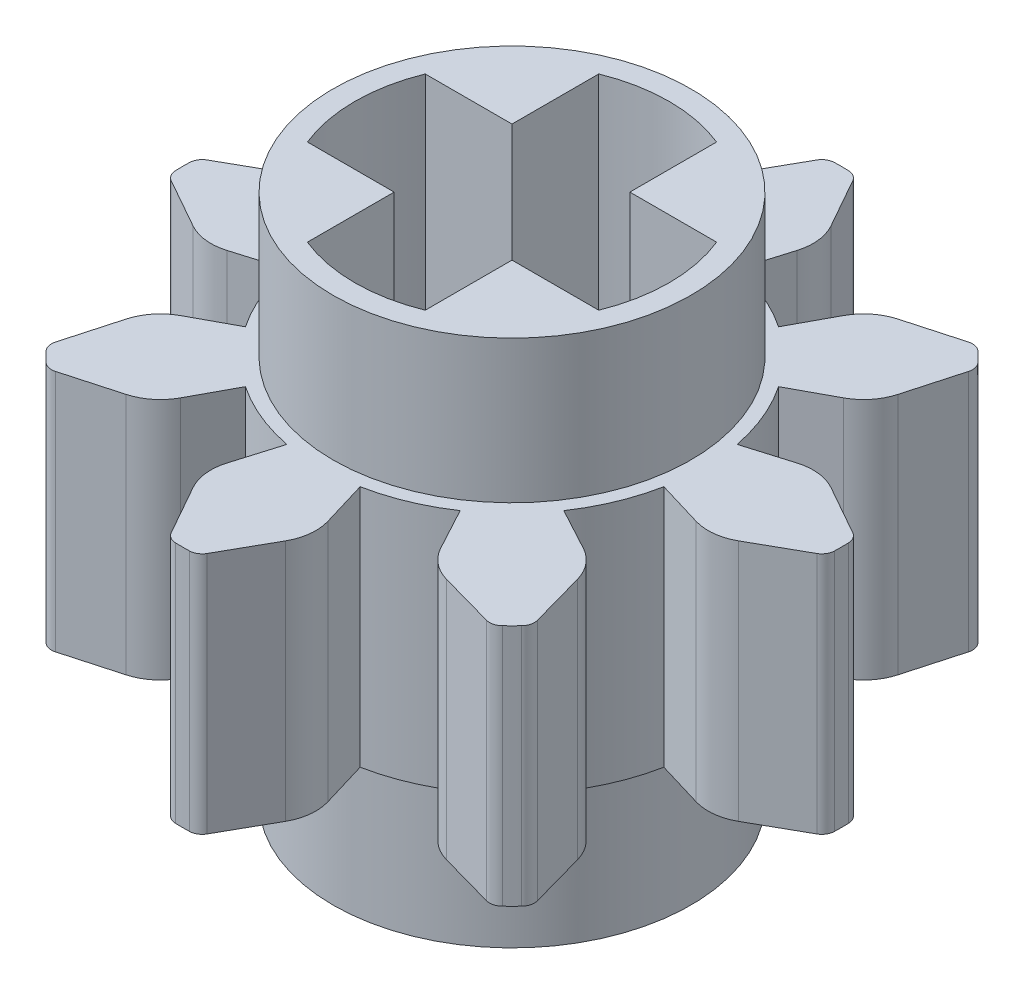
ISO-10303-21;
HEADER;
FILE_DESCRIPTION(('STEP AP214'),'2;1');
FILE_NAME('part.step','',(''),(''),'','','');
FILE_SCHEMA(('AUTOMOTIVE_DESIGN { 1 0 10303 214 1 1 1 1 }'));
ENDSEC;
DATA;
#1=APPLICATION_CONTEXT('core data for automotive mechanical design processes');
#2=APPLICATION_PROTOCOL_DEFINITION('international standard','automotive_design',2000,#1);
#3=PRODUCT_CONTEXT('',#1,'mechanical');
#4=PRODUCT('Part','Part','',(#3));
#5=PRODUCT_RELATED_PRODUCT_CATEGORY('part','',(#4));
#6=PRODUCT_DEFINITION_FORMATION('','',#4);
#7=PRODUCT_DEFINITION_CONTEXT('part definition',#1,'design');
#8=PRODUCT_DEFINITION('design','',#6,#7);
#9=PRODUCT_DEFINITION_SHAPE('','',#8);
#10=(LENGTH_UNIT() NAMED_UNIT(*) SI_UNIT(.MILLI.,.METRE.));
#11=(NAMED_UNIT(*) PLANE_ANGLE_UNIT() SI_UNIT($,.RADIAN.));
#12=(NAMED_UNIT(*) SI_UNIT($,.STERADIAN.) SOLID_ANGLE_UNIT());
#13=UNCERTAINTY_MEASURE_WITH_UNIT(LENGTH_MEASURE(1.E-05),#10,'distance_accuracy_value','');
#14=(GEOMETRIC_REPRESENTATION_CONTEXT(3) GLOBAL_UNCERTAINTY_ASSIGNED_CONTEXT((#13)) GLOBAL_UNIT_ASSIGNED_CONTEXT((#10,
#11,#12)) REPRESENTATION_CONTEXT('',''));
#15=CARTESIAN_POINT('',(0.,0.,0.));
#16=DIRECTION('',(0.,0.,1.));
#17=DIRECTION('',(1.,0.,0.));
#18=AXIS2_PLACEMENT_3D('',#15,#16,#17);
#19=CARTESIAN_POINT('',(0.,-1.855,0.));
#20=DIRECTION('',(0.,1.,0.));
#21=DIRECTION('',(0.,0.,1.));
#22=AXIS2_PLACEMENT_3D('',#19,#20,#21);
#23=PLANE('',#22);
#24=DIRECTION('',(0.957935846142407,0.,-0.286982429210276));
#25=VECTOR('',#24,1.);
#26=CARTESIAN_POINT('',(-3.88809884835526,-1.855,0.861970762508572));
#27=LINE('',#26,#25);
#28=CARTESIAN_POINT('',(-3.58247146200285,-1.855,0.770409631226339));
#29=VERTEX_POINT('',#28);
#30=CARTESIAN_POINT('',(-2.87862171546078,-1.855,0.559547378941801));
#31=VERTEX_POINT('',#30);
#32=EDGE_CURVE('E719',#29,#31,#27,.T.);
#33=ORIENTED_EDGE('',*,*,#32,.F.);
#34=CARTESIAN_POINT('',(-3.79770828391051,-1.855,0.0519577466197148));
#35=DIRECTION('',(0.,1.,0.));
#36=DIRECTION('',(0.,0.,1.));
#37=AXIS2_PLACEMENT_3D('',#34,#35,#36);
#38=CIRCLE('',#37,0.749999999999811);
#39=CARTESIAN_POINT('',(-4.16602455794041,-1.855,0.705290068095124));
#40=VERTEX_POINT('',#39);
#41=EDGE_CURVE('E11',#29,#40,#38,.F.);
#42=ORIENTED_EDGE('',*,*,#41,.T.);
#43=DIRECTION('',(0.871109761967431,0.,0.491088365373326));
#44=VECTOR('',#43,1.);
#45=CARTESIAN_POINT('',(-5.02771017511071,-1.855,0.219514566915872));
#46=LINE('',#45,#44);
#47=CARTESIAN_POINT('',(-4.92967123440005,-1.855,0.274784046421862));
#48=VERTEX_POINT('',#47);
#49=EDGE_CURVE('E715',#48,#40,#46,.T.);
#50=ORIENTED_EDGE('',*,*,#49,.F.);
#51=CARTESIAN_POINT('',(-4.8314535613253,-1.855,0.100562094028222));
#52=DIRECTION('',(0.,1.,0.));
#53=DIRECTION('',(0.,0.,1.));
#54=AXIS2_PLACEMENT_3D('',#51,#52,#53);
#55=CIRCLE('',#54,0.200000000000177);
#56=CARTESIAN_POINT('',(-5.03141025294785,-1.855,0.104724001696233));
#57=VERTEX_POINT('',#56);
#58=EDGE_CURVE('E1154',#48,#57,#55,.F.);
#59=ORIENTED_EDGE('',*,*,#58,.T.);
#60=CARTESIAN_POINT('',(0.,-1.855,0.));
#61=DIRECTION('',(0.,1.,0.));
#62=DIRECTION('',(0.,0.,1.));
#63=AXIS2_PLACEMENT_3D('',#60,#61,#62);
#64=CIRCLE('',#63,5.0325);
#65=CARTESIAN_POINT('',(-5.03141025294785,-1.855,-0.104724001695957));
#66=VERTEX_POINT('',#65);
#67=EDGE_CURVE('E712',#66,#57,#64,.T.);
#68=ORIENTED_EDGE('',*,*,#67,.F.);
#69=CARTESIAN_POINT('',(-4.83145356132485,-1.855,-0.100562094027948));
#70=DIRECTION('',(0.,1.,0.));
#71=DIRECTION('',(0.,0.,1.));
#72=AXIS2_PLACEMENT_3D('',#69,#70,#71);
#73=CIRCLE('',#72,0.200000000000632);
#74=CARTESIAN_POINT('',(-4.92967123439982,-1.855,-0.27478404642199));
#75=VERTEX_POINT('',#74);
#76=EDGE_CURVE('E1045',#66,#75,#73,.F.);
#77=ORIENTED_EDGE('',*,*,#76,.T.);
#78=DIRECTION('',(-0.871109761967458,0.,0.491088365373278));
#79=VECTOR('',#78,1.);
#80=CARTESIAN_POINT('',(-3.88809884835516,-1.855,-0.861970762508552));
#81=LINE('',#80,#79);
#82=CARTESIAN_POINT('',(-4.16602455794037,-1.855,-0.705290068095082));
#83=VERTEX_POINT('',#82);
#84=EDGE_CURVE('E833',#83,#75,#81,.T.);
#85=ORIENTED_EDGE('',*,*,#84,.F.);
#86=CARTESIAN_POINT('',(-3.7977082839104,-1.855,-0.0519577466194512));
#87=DIRECTION('',(0.,1.,0.));
#88=DIRECTION('',(0.,0.,1.));
#89=AXIS2_PLACEMENT_3D('',#86,#87,#88);
#90=CIRCLE('',#89,0.750000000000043);
#91=CARTESIAN_POINT('',(-3.58247146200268,-1.855,-0.770409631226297));
#92=VERTEX_POINT('',#91);
#93=EDGE_CURVE('E1190',#83,#92,#90,.F.);
#94=ORIENTED_EDGE('',*,*,#93,.T.);
#95=DIRECTION('',(-0.957935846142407,0.,-0.286982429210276));
#96=VECTOR('',#95,1.);
#97=CARTESIAN_POINT('',(-2.87862171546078,-1.855,-0.559547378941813));
#98=LINE('',#97,#96);
#99=CARTESIAN_POINT('',(-2.87862171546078,-1.855,-0.559547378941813));
#100=VERTEX_POINT('',#99);
#101=EDGE_CURVE('E830',#100,#92,#98,.T.);
#102=ORIENTED_EDGE('',*,*,#101,.F.);
#103=CARTESIAN_POINT('',(0.,-1.855,0.));
#104=DIRECTION('',(0.,1.,0.));
#105=DIRECTION('',(0.,0.,1.));
#106=AXIS2_PLACEMENT_3D('',#103,#104,#105);
#107=CIRCLE('',#106,2.93250000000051);
#108=CARTESIAN_POINT('',(-2.43115268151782,-1.855,-1.63983318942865));
#109=VERTEX_POINT('',#108);
#110=EDGE_CURVE('E827',#109,#100,#107,.T.);
#111=ORIENTED_EDGE('',*,*,#110,.F.);
#112=DIRECTION('',(0.880290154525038,0.,0.474435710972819));
#113=VECTOR('',#112,1.);
#114=CARTESIAN_POINT('',(-3.35880643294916,-1.855,-2.13979569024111));
#115=LINE('',#114,#113);
#116=CARTESIAN_POINT('',(-3.07795173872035,-1.855,-1.9884279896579));
#117=VERTEX_POINT('',#116);
#118=EDGE_CURVE('E825',#117,#109,#115,.T.);
#119=ORIENTED_EDGE('',*,*,#118,.F.);
#120=CARTESIAN_POINT('',(-2.72212495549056,-1.855,-2.64864560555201));
#121=DIRECTION('',(0.,1.,0.));
#122=DIRECTION('',(0.,0.,1.));
#123=AXIS2_PLACEMENT_3D('',#120,#121,#122);
#124=CIRCLE('',#123,0.750000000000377);
#125=CARTESIAN_POINT('',(-3.44453960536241,-1.855,-2.44710882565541));
#126=VERTEX_POINT('',#125);
#127=EDGE_CURVE('E1208',#117,#126,#124,.F.);
#128=ORIENTED_EDGE('',*,*,#127,.T.);
#129=DIRECTION('',(0.268715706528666,0.,0.963219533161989));
#130=VECTOR('',#129,1.);
#131=CARTESIAN_POINT('',(-3.71034819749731,-1.855,-3.39990771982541));
#132=LINE('',#131,#130);
#133=CARTESIAN_POINT('',(-3.68010562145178,-1.855,-3.29150229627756));
#134=VERTEX_POINT('',#133);
#135=EDGE_CURVE('E822',#134,#126,#132,.T.);
#136=ORIENTED_EDGE('',*,*,#135,.F.);
#137=CARTESIAN_POINT('',(-3.48746171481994,-1.855,-3.34524543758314));
#138=DIRECTION('',(0.,1.,0.));
#139=DIRECTION('',(0.,0.,1.));
#140=AXIS2_PLACEMENT_3D('',#137,#138,#139);
#141=CIRCLE('',#140,0.19999999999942);
#142=CARTESIAN_POINT('',(-3.63179536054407,-1.855,-3.48369325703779));
#143=VERTEX_POINT('',#142);
#144=EDGE_CURVE('E1005',#134,#143,#141,.F.);
#145=ORIENTED_EDGE('',*,*,#144,.T.);
#146=CARTESIAN_POINT('',(0.,-1.855,0.));
#147=DIRECTION('',(0.,1.,0.));
#148=DIRECTION('',(0.,0.,1.));
#149=AXIS2_PLACEMENT_3D('',#146,#147,#148);
#150=CIRCLE('',#149,5.0325);
#151=CARTESIAN_POINT('',(-3.48369325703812,-1.855,-3.63179536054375));
#152=VERTEX_POINT('',#151);
#153=EDGE_CURVE('E820',#152,#143,#150,.T.);
#154=ORIENTED_EDGE('',*,*,#153,.F.);
#155=CARTESIAN_POINT('',(-3.34524543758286,-1.855,-3.48746171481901));
#156=DIRECTION('',(0.,1.,0.));
#157=DIRECTION('',(0.,0.,1.));
#158=AXIS2_PLACEMENT_3D('',#155,#156,#157);
#159=CIRCLE('',#158,0.200000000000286);
#160=CARTESIAN_POINT('',(-3.29150229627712,-1.855,-3.6801056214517));
#161=VERTEX_POINT('',#160);
#162=EDGE_CURVE('E1144',#152,#161,#159,.F.);
#163=ORIENTED_EDGE('',*,*,#162,.T.);
#164=DIRECTION('',(-0.963219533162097,0.,-0.268715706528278));
#165=VECTOR('',#164,1.);
#166=CARTESIAN_POINT('',(-2.13979569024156,-1.855,-3.35880643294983));
#167=LINE('',#166,#165);
#168=CARTESIAN_POINT('',(-2.44710882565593,-1.855,-3.44453960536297));
#169=VERTEX_POINT('',#168);
#170=EDGE_CURVE('E818',#169,#161,#167,.T.);
#171=ORIENTED_EDGE('',*,*,#170,.F.);
#172=CARTESIAN_POINT('',(-2.64864560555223,-1.855,-2.72212495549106));
#173=DIRECTION('',(0.,1.,0.));
#174=DIRECTION('',(0.,0.,1.));
#175=AXIS2_PLACEMENT_3D('',#172,#173,#174);
#176=CIRCLE('',#175,0.750000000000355);
#177=CARTESIAN_POINT('',(-1.98842798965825,-1.855,-3.07795173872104));
#178=VERTEX_POINT('',#177);
#179=EDGE_CURVE('E1289',#169,#178,#176,.F.);
#180=ORIENTED_EDGE('',*,*,#179,.T.);
#181=DIRECTION('',(-0.474435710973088,0.,-0.880290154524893));
#182=VECTOR('',#181,1.);
#183=CARTESIAN_POINT('',(-1.63983318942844,-1.855,-2.43115268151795));
#184=LINE('',#183,#182);
#185=CARTESIAN_POINT('',(-1.63983318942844,-1.855,-2.43115268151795));
#186=VERTEX_POINT('',#185);
#187=EDGE_CURVE('E815',#186,#178,#184,.T.);
#188=ORIENTED_EDGE('',*,*,#187,.F.);
#189=CARTESIAN_POINT('',(0.,-1.855,0.));
#190=DIRECTION('',(0.,1.,0.));
#191=DIRECTION('',(0.,0.,1.));
#192=AXIS2_PLACEMENT_3D('',#189,#190,#191);
#193=CIRCLE('',#192,2.93250000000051);
#194=CARTESIAN_POINT('',(-0.559547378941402,-1.855,-2.87862171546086));
#195=VERTEX_POINT('',#194);
#196=EDGE_CURVE('E812',#195,#186,#193,.T.);
#197=ORIENTED_EDGE('',*,*,#196,.F.);
#198=DIRECTION('',(0.286982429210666,0.,0.95793584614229));
#199=VECTOR('',#198,1.);
#200=CARTESIAN_POINT('',(-0.861970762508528,-1.855,-3.88809884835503));
#201=LINE('',#200,#199);
#202=CARTESIAN_POINT('',(-0.770409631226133,-1.855,-3.58247146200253));
#203=VERTEX_POINT('',#202);
#204=EDGE_CURVE('E810',#203,#195,#201,.T.);
#205=ORIENTED_EDGE('',*,*,#204,.F.);
#206=CARTESIAN_POINT('',(-0.0519577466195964,-1.855,-3.79770828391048));
#207=DIRECTION('',(0.,1.,0.));
#208=DIRECTION('',(0.,0.,1.));
#209=AXIS2_PLACEMENT_3D('',#206,#207,#208);
#210=CIRCLE('',#209,0.749999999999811);
#211=CARTESIAN_POINT('',(-0.705290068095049,-1.855,-4.1660245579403));
#212=VERTEX_POINT('',#211);
#213=EDGE_CURVE('E1280',#203,#212,#210,.F.);
#214=ORIENTED_EDGE('',*,*,#213,.T.);
#215=DIRECTION('',(-0.491088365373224,0.,0.871109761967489));
#216=VECTOR('',#215,1.);
#217=CARTESIAN_POINT('',(-0.219514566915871,-1.855,-5.02771017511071));
#218=LINE('',#217,#216);
#219=CARTESIAN_POINT('',(-0.274784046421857,-1.855,-4.92967123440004));
#220=VERTEX_POINT('',#219);
#221=EDGE_CURVE('E807',#220,#212,#218,.T.);
#222=ORIENTED_EDGE('',*,*,#221,.F.);
#223=CARTESIAN_POINT('',(-0.100562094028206,-1.855,-4.8314535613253));
#224=DIRECTION('',(0.,1.,0.));
#225=DIRECTION('',(0.,0.,1.));
#226=AXIS2_PLACEMENT_3D('',#223,#224,#225);
#227=CIRCLE('',#226,0.200000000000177);
#228=CARTESIAN_POINT('',(-0.104724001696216,-1.855,-5.03141025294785));
#229=VERTEX_POINT('',#228);
#230=EDGE_CURVE('E1025',#220,#229,#227,.F.);
#231=ORIENTED_EDGE('',*,*,#230,.T.);
#232=CARTESIAN_POINT('',(0.,-1.855,0.));
#233=DIRECTION('',(0.,1.,0.));
#234=DIRECTION('',(0.,0.,1.));
#235=AXIS2_PLACEMENT_3D('',#232,#233,#234);
#236=CIRCLE('',#235,5.0325);
#237=CARTESIAN_POINT('',(0.104724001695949,-1.855,-5.03141025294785));
#238=VERTEX_POINT('',#237);
#239=EDGE_CURVE('E805',#238,#229,#236,.T.);
#240=ORIENTED_EDGE('',*,*,#239,.F.);
#241=CARTESIAN_POINT('',(0.10056209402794,-1.855,-4.83145356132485));
#242=DIRECTION('',(0.,1.,0.));
#243=DIRECTION('',(0.,0.,1.));
#244=AXIS2_PLACEMENT_3D('',#241,#242,#243);
#245=CIRCLE('',#244,0.200000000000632);
#246=CARTESIAN_POINT('',(0.274784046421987,-1.855,-4.92967123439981));
#247=VERTEX_POINT('',#246);
#248=EDGE_CURVE('E1065',#238,#247,#245,.F.);
#249=ORIENTED_EDGE('',*,*,#248,.T.);
#250=DIRECTION('',(-0.491088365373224,0.,-0.871109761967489));
#251=VECTOR('',#250,1.);
#252=CARTESIAN_POINT('',(0.861970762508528,-1.855,-3.88809884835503));
#253=LINE('',#252,#251);
#254=CARTESIAN_POINT('',(0.70529006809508,-1.855,-4.16602455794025));
#255=VERTEX_POINT('',#254);
#256=EDGE_CURVE('E803',#255,#247,#253,.T.);
#257=ORIENTED_EDGE('',*,*,#256,.F.);
#258=CARTESIAN_POINT('',(0.0519577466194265,-1.855,-3.79770828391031));
#259=DIRECTION('',(0.,1.,0.));
#260=DIRECTION('',(0.,0.,1.));
#261=AXIS2_PLACEMENT_3D('',#258,#259,#260);
#262=CIRCLE('',#261,0.750000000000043);
#263=CARTESIAN_POINT('',(0.770409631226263,-1.855,-3.58247146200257));
#264=VERTEX_POINT('',#263);
#265=EDGE_CURVE('E1172',#255,#264,#262,.F.);
#266=ORIENTED_EDGE('',*,*,#265,.T.);
#267=DIRECTION('',(0.286982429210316,0.,-0.957935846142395));
#268=VECTOR('',#267,1.);
#269=CARTESIAN_POINT('',(0.559547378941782,-1.855,-2.87862171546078));
#270=LINE('',#269,#268);
#271=CARTESIAN_POINT('',(0.559547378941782,-1.855,-2.87862171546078));
#272=VERTEX_POINT('',#271);
#273=EDGE_CURVE('E800',#272,#264,#270,.T.);
#274=ORIENTED_EDGE('',*,*,#273,.F.);
#275=CARTESIAN_POINT('',(0.,-1.855,0.));
#276=DIRECTION('',(0.,1.,0.));
#277=DIRECTION('',(0.,0.,1.));
#278=AXIS2_PLACEMENT_3D('',#275,#276,#277);
#279=CIRCLE('',#278,2.93250000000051);
#280=CARTESIAN_POINT('',(1.63983318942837,-1.855,-2.431152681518));
#281=VERTEX_POINT('',#280);
#282=EDGE_CURVE('E797',#281,#272,#279,.T.);
#283=ORIENTED_EDGE('',*,*,#282,.F.);
#284=DIRECTION('',(-0.474435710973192,0.,0.880290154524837));
#285=VECTOR('',#284,1.);
#286=CARTESIAN_POINT('',(2.13979569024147,-1.855,-3.35880643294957));
#287=LINE('',#286,#285);
#288=CARTESIAN_POINT('',(1.98842798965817,-1.855,-3.07795173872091));
#289=VERTEX_POINT('',#288);
#290=EDGE_CURVE('E795',#289,#281,#287,.T.);
#291=ORIENTED_EDGE('',*,*,#290,.F.);
#292=CARTESIAN_POINT('',(2.64864560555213,-1.855,-2.72212495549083));
#293=DIRECTION('',(0.,1.,0.));
#294=DIRECTION('',(0.,0.,1.));
#295=AXIS2_PLACEMENT_3D('',#292,#293,#294);
#296=CIRCLE('',#295,0.750000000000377);
#297=CARTESIAN_POINT('',(2.4471088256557,-1.855,-3.44453960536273));
#298=VERTEX_POINT('',#297);
#299=EDGE_CURVE('E1199',#289,#298,#296,.F.);
#300=ORIENTED_EDGE('',*,*,#299,.T.);
#301=DIRECTION('',(-0.963219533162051,0.,0.268715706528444));
#302=VECTOR('',#301,1.);
#303=CARTESIAN_POINT('',(3.39990771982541,-1.855,-3.71034819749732));
#304=LINE('',#303,#302);
#305=CARTESIAN_POINT('',(3.29150229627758,-1.855,-3.68010562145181));
#306=VERTEX_POINT('',#305);
#307=EDGE_CURVE('E792',#306,#298,#304,.T.);
#308=ORIENTED_EDGE('',*,*,#307,.F.);
#309=CARTESIAN_POINT('',(3.34524543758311,-1.855,-3.48746171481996));
#310=DIRECTION('',(0.,1.,0.));
#311=DIRECTION('',(0.,0.,1.));
#312=AXIS2_PLACEMENT_3D('',#309,#310,#311);
#313=CIRCLE('',#312,0.19999999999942);
#314=CARTESIAN_POINT('',(3.48369325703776,-1.855,-3.63179536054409));
#315=VERTEX_POINT('',#314);
#316=EDGE_CURVE('E1105',#306,#315,#313,.F.);
#317=ORIENTED_EDGE('',*,*,#316,.T.);
#318=CARTESIAN_POINT('',(0.,-1.855,0.));
#319=DIRECTION('',(0.,1.,0.));
#320=DIRECTION('',(0.,0.,1.));
#321=AXIS2_PLACEMENT_3D('',#318,#319,#320);
#322=CIRCLE('',#321,5.0325);
#323=CARTESIAN_POINT('',(3.63179536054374,-1.855,-3.48369325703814));
#324=VERTEX_POINT('',#323);
#325=EDGE_CURVE('E790',#324,#315,#322,.T.);
#326=ORIENTED_EDGE('',*,*,#325,.F.);
#327=CARTESIAN_POINT('',(3.48746171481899,-1.855,-3.34524543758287));
#328=DIRECTION('',(0.,1.,0.));
#329=DIRECTION('',(0.,0.,1.));
#330=AXIS2_PLACEMENT_3D('',#327,#328,#329);
#331=CIRCLE('',#330,0.200000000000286);
#332=CARTESIAN_POINT('',(3.68010562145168,-1.855,-3.29150229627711));
#333=VERTEX_POINT('',#332);
#334=EDGE_CURVE('E1115',#324,#333,#331,.F.);
#335=ORIENTED_EDGE('',*,*,#334,.T.);
#336=DIRECTION('',(0.268715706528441,0.,-0.963219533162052));
#337=VECTOR('',#336,1.);
#338=CARTESIAN_POINT('',(3.35880643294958,-1.855,-2.13979569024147));
#339=LINE('',#338,#337);
#340=CARTESIAN_POINT('',(3.44453960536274,-1.855,-2.44710882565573));
#341=VERTEX_POINT('',#340);
#342=EDGE_CURVE('E788',#341,#333,#339,.T.);
#343=ORIENTED_EDGE('',*,*,#342,.F.);
#344=CARTESIAN_POINT('',(2.72212495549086,-1.855,-2.64864560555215));
#345=DIRECTION('',(0.,1.,0.));
#346=DIRECTION('',(0.,0.,1.));
#347=AXIS2_PLACEMENT_3D('',#344,#345,#346);
#348=CIRCLE('',#347,0.750000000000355);
#349=CARTESIAN_POINT('',(3.07795173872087,-1.855,-1.98842798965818));
#350=VERTEX_POINT('',#349);
#351=EDGE_CURVE('E1235',#341,#350,#348,.F.);
#352=ORIENTED_EDGE('',*,*,#351,.T.);
#353=DIRECTION('',(0.880290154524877,0.,-0.474435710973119));
#354=VECTOR('',#353,1.);
#355=CARTESIAN_POINT('',(2.43115268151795,-1.855,-1.63983318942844));
#356=LINE('',#355,#354);
#357=CARTESIAN_POINT('',(2.43115268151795,-1.855,-1.63983318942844));
#358=VERTEX_POINT('',#357);
#359=EDGE_CURVE('E785',#358,#350,#356,.T.);
#360=ORIENTED_EDGE('',*,*,#359,.F.);
#361=CARTESIAN_POINT('',(0.,-1.855,0.));
#362=DIRECTION('',(0.,1.,0.));
#363=DIRECTION('',(0.,0.,1.));
#364=AXIS2_PLACEMENT_3D('',#361,#362,#363);
#365=CIRCLE('',#364,2.93250000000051);
#366=CARTESIAN_POINT('',(2.87862171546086,-1.855,-0.559547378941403));
#367=VERTEX_POINT('',#366);
#368=EDGE_CURVE('E782',#367,#358,#365,.T.);
#369=ORIENTED_EDGE('',*,*,#368,.F.);
#370=DIRECTION('',(-0.95793584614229,0.,0.286982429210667));
#371=VECTOR('',#370,1.);
#372=CARTESIAN_POINT('',(3.88809884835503,-1.855,-0.861970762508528));
#373=LINE('',#372,#371);
#374=CARTESIAN_POINT('',(3.58247146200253,-1.855,-0.770409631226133));
#375=VERTEX_POINT('',#374);
#376=EDGE_CURVE('E780',#375,#367,#373,.T.);
#377=ORIENTED_EDGE('',*,*,#376,.F.);
#378=CARTESIAN_POINT('',(3.79770828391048,-1.855,-0.0519577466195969));
#379=DIRECTION('',(0.,1.,0.));
#380=DIRECTION('',(0.,0.,1.));
#381=AXIS2_PLACEMENT_3D('',#378,#379,#380);
#382=CIRCLE('',#381,0.749999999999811);
#383=CARTESIAN_POINT('',(4.1660245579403,-1.855,-0.705290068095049));
#384=VERTEX_POINT('',#383);
#385=EDGE_CURVE('E1271',#375,#384,#382,.F.);
#386=ORIENTED_EDGE('',*,*,#385,.T.);
#387=DIRECTION('',(-0.871109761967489,0.,-0.491088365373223));
#388=VECTOR('',#387,1.);
#389=CARTESIAN_POINT('',(5.02771017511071,-1.855,-0.219514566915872));
#390=LINE('',#389,#388);
#391=CARTESIAN_POINT('',(4.92967123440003,-1.855,-0.274784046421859));
#392=VERTEX_POINT('',#391);
#393=EDGE_CURVE('E777',#392,#384,#390,.T.);
#394=ORIENTED_EDGE('',*,*,#393,.F.);
#395=CARTESIAN_POINT('',(4.8314535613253,-1.855,-0.100562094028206));
#396=DIRECTION('',(0.,1.,0.));
#397=DIRECTION('',(0.,0.,1.));
#398=AXIS2_PLACEMENT_3D('',#395,#396,#397);
#399=CIRCLE('',#398,0.200000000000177);
#400=CARTESIAN_POINT('',(5.03141025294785,-1.855,-0.104724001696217));
#401=VERTEX_POINT('',#400);
#402=EDGE_CURVE('E1015',#392,#401,#399,.F.);
#403=ORIENTED_EDGE('',*,*,#402,.T.);
#404=CARTESIAN_POINT('',(0.,-1.855,0.));
#405=DIRECTION('',(0.,1.,0.));
#406=DIRECTION('',(0.,0.,1.));
#407=AXIS2_PLACEMENT_3D('',#404,#405,#406);
#408=CIRCLE('',#407,5.0325);
#409=CARTESIAN_POINT('',(5.03141025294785,-1.855,0.104724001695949));
#410=VERTEX_POINT('',#409);
#411=EDGE_CURVE('E775',#410,#401,#408,.T.);
#412=ORIENTED_EDGE('',*,*,#411,.F.);
#413=CARTESIAN_POINT('',(4.83145356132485,-1.855,0.10056209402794));
#414=DIRECTION('',(0.,1.,0.));
#415=DIRECTION('',(0.,0.,1.));
#416=AXIS2_PLACEMENT_3D('',#413,#414,#415);
#417=CIRCLE('',#416,0.200000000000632);
#418=CARTESIAN_POINT('',(4.92967123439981,-1.855,0.274784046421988));
#419=VERTEX_POINT('',#418);
#420=EDGE_CURVE('E1134',#410,#419,#417,.F.);
#421=ORIENTED_EDGE('',*,*,#420,.T.);
#422=DIRECTION('',(0.871109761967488,0.,-0.491088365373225));
#423=VECTOR('',#422,1.);
#424=CARTESIAN_POINT('',(3.88809884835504,-1.855,0.861970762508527));
#425=LINE('',#424,#423);
#426=CARTESIAN_POINT('',(4.16602455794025,-1.855,0.705290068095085));
#427=VERTEX_POINT('',#426);
#428=EDGE_CURVE('E773',#427,#419,#425,.T.);
#429=ORIENTED_EDGE('',*,*,#428,.F.);
#430=CARTESIAN_POINT('',(3.79770828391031,-1.855,0.0519577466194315));
#431=DIRECTION('',(0.,1.,0.));
#432=DIRECTION('',(0.,0.,1.));
#433=AXIS2_PLACEMENT_3D('',#430,#431,#432);
#434=CIRCLE('',#433,0.750000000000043);
#435=CARTESIAN_POINT('',(3.58247146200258,-1.855,0.770409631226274));
#436=VERTEX_POINT('',#435);
#437=EDGE_CURVE('E1253',#427,#436,#434,.F.);
#438=ORIENTED_EDGE('',*,*,#437,.T.);
#439=DIRECTION('',(0.957935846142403,0.,0.28698242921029));
#440=VECTOR('',#439,1.);
#441=CARTESIAN_POINT('',(2.87862171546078,-1.855,0.559547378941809));
#442=LINE('',#441,#440);
#443=CARTESIAN_POINT('',(2.87862171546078,-1.855,0.559547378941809));
#444=VERTEX_POINT('',#443);
#445=EDGE_CURVE('E770',#444,#436,#442,.T.);
#446=ORIENTED_EDGE('',*,*,#445,.F.);
#447=CARTESIAN_POINT('',(0.,-1.855,0.));
#448=DIRECTION('',(0.,1.,0.));
#449=DIRECTION('',(0.,0.,1.));
#450=AXIS2_PLACEMENT_3D('',#447,#448,#449);
#451=CIRCLE('',#450,2.93250000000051);
#452=CARTESIAN_POINT('',(2.43115268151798,-1.855,1.6398331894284));
#453=VERTEX_POINT('',#452);
#454=EDGE_CURVE('E767',#453,#444,#451,.T.);
#455=ORIENTED_EDGE('',*,*,#454,.F.);
#456=DIRECTION('',(-0.880290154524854,0.,-0.474435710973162));
#457=VECTOR('',#456,1.);
#458=CARTESIAN_POINT('',(3.35880643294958,-1.855,2.13979569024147));
#459=LINE('',#458,#457);
#460=CARTESIAN_POINT('',(3.07795173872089,-1.855,1.98842798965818));
#461=VERTEX_POINT('',#460);
#462=EDGE_CURVE('E765',#461,#453,#459,.T.);
#463=ORIENTED_EDGE('',*,*,#462,.F.);
#464=CARTESIAN_POINT('',(2.72212495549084,-1.855,2.64864560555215));
#465=DIRECTION('',(0.,1.,0.));
#466=DIRECTION('',(0.,0.,1.));
#467=AXIS2_PLACEMENT_3D('',#464,#465,#466);
#468=CIRCLE('',#467,0.750000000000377);
#469=CARTESIAN_POINT('',(3.44453960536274,-1.855,2.44710882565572));
#470=VERTEX_POINT('',#469);
#471=EDGE_CURVE('E1217',#461,#470,#468,.F.);
#472=ORIENTED_EDGE('',*,*,#471,.T.);
#473=DIRECTION('',(-0.268715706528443,0.,-0.963219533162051));
#474=VECTOR('',#473,1.);
#475=CARTESIAN_POINT('',(3.71034819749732,-1.855,3.39990771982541));
#476=LINE('',#475,#474);
#477=CARTESIAN_POINT('',(3.68010562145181,-1.855,3.29150229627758));
#478=VERTEX_POINT('',#477);
#479=EDGE_CURVE('E762',#478,#470,#476,.T.);
#480=ORIENTED_EDGE('',*,*,#479,.F.);
#481=CARTESIAN_POINT('',(3.48746171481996,-1.855,3.34524543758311));
#482=DIRECTION('',(0.,1.,0.));
#483=DIRECTION('',(0.,0.,1.));
#484=AXIS2_PLACEMENT_3D('',#481,#482,#483);
#485=CIRCLE('',#484,0.19999999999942);
#486=CARTESIAN_POINT('',(3.6317953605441,-1.855,3.48369325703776));
#487=VERTEX_POINT('',#486);
#488=EDGE_CURVE('E1055',#478,#487,#485,.F.);
#489=ORIENTED_EDGE('',*,*,#488,.T.);
#490=CARTESIAN_POINT('',(0.,-1.855,0.));
#491=DIRECTION('',(0.,1.,0.));
#492=DIRECTION('',(0.,0.,1.));
#493=AXIS2_PLACEMENT_3D('',#490,#491,#492);
#494=CIRCLE('',#493,5.0325);
#495=CARTESIAN_POINT('',(3.48369325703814,-1.855,3.63179536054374));
#496=VERTEX_POINT('',#495);
#497=EDGE_CURVE('E760',#496,#487,#494,.T.);
#498=ORIENTED_EDGE('',*,*,#497,.F.);
#499=CARTESIAN_POINT('',(3.34524543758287,-1.855,3.48746171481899));
#500=DIRECTION('',(0.,1.,0.));
#501=DIRECTION('',(0.,0.,1.));
#502=AXIS2_PLACEMENT_3D('',#499,#500,#501);
#503=CIRCLE('',#502,0.200000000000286);
#504=CARTESIAN_POINT('',(3.29150229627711,-1.855,3.68010562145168));
#505=VERTEX_POINT('',#504);
#506=EDGE_CURVE('E1085',#496,#505,#503,.F.);
#507=ORIENTED_EDGE('',*,*,#506,.T.);
#508=DIRECTION('',(0.963219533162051,0.,0.268715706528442));
#509=VECTOR('',#508,1.);
#510=CARTESIAN_POINT('',(2.13979569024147,-1.855,3.35880643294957));
#511=LINE('',#510,#509);
#512=CARTESIAN_POINT('',(2.44710882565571,-1.855,3.44453960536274));
#513=VERTEX_POINT('',#512);
#514=EDGE_CURVE('E758',#513,#505,#511,.T.);
#515=ORIENTED_EDGE('',*,*,#514,.F.);
#516=CARTESIAN_POINT('',(2.64864560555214,-1.855,2.72212495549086));
#517=DIRECTION('',(0.,1.,0.));
#518=DIRECTION('',(0.,0.,1.));
#519=AXIS2_PLACEMENT_3D('',#516,#517,#518);
#520=CIRCLE('',#519,0.750000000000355);
#521=CARTESIAN_POINT('',(1.98842798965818,-1.855,3.07795173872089));
#522=VERTEX_POINT('',#521);
#523=EDGE_CURVE('E1181',#513,#522,#520,.F.);
#524=ORIENTED_EDGE('',*,*,#523,.T.);
#525=DIRECTION('',(0.474435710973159,0.,0.880290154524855));
#526=VECTOR('',#525,1.);
#527=CARTESIAN_POINT('',(1.6398331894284,-1.855,2.43115268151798));
#528=LINE('',#527,#526);
#529=CARTESIAN_POINT('',(1.6398331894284,-1.855,2.43115268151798));
#530=VERTEX_POINT('',#529);
#531=EDGE_CURVE('E755',#530,#522,#528,.T.);
#532=ORIENTED_EDGE('',*,*,#531,.F.);
#533=CARTESIAN_POINT('',(0.,-1.855,0.));
#534=DIRECTION('',(0.,1.,0.));
#535=DIRECTION('',(0.,0.,1.));
#536=AXIS2_PLACEMENT_3D('',#533,#534,#535);
#537=CIRCLE('',#536,2.93250000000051);
#538=CARTESIAN_POINT('',(0.559547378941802,-1.855,2.87862171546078));
#539=VERTEX_POINT('',#538);
#540=EDGE_CURVE('E752',#539,#530,#537,.T.);
#541=ORIENTED_EDGE('',*,*,#540,.F.);
#542=DIRECTION('',(-0.286982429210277,0.,-0.957935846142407));
#543=VECTOR('',#542,1.);
#544=CARTESIAN_POINT('',(0.861970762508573,-1.855,3.88809884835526));
#545=LINE('',#544,#543);
#546=CARTESIAN_POINT('',(0.77040963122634,-1.855,3.58247146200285));
#547=VERTEX_POINT('',#546);
#548=EDGE_CURVE('E750',#547,#539,#545,.T.);
#549=ORIENTED_EDGE('',*,*,#548,.F.);
#550=CARTESIAN_POINT('',(0.0519577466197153,-1.855,3.79770828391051));
#551=DIRECTION('',(0.,1.,0.));
#552=DIRECTION('',(0.,0.,1.));
#553=AXIS2_PLACEMENT_3D('',#550,#551,#552);
#554=CIRCLE('',#553,0.749999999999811);
#555=CARTESIAN_POINT('',(0.705290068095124,-1.855,4.16602455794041));
#556=VERTEX_POINT('',#555);
#557=EDGE_CURVE('E1244',#547,#556,#554,.F.);
#558=ORIENTED_EDGE('',*,*,#557,.T.);
#559=DIRECTION('',(0.491088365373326,0.,-0.871109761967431));
#560=VECTOR('',#559,1.);
#561=CARTESIAN_POINT('',(0.219514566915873,-1.855,5.0277101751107));
#562=LINE('',#561,#560);
#563=CARTESIAN_POINT('',(0.274784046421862,-1.855,4.92967123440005));
#564=VERTEX_POINT('',#563);
#565=EDGE_CURVE('E747',#564,#556,#562,.T.);
#566=ORIENTED_EDGE('',*,*,#565,.F.);
#567=CARTESIAN_POINT('',(0.100562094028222,-1.855,4.8314535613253));
#568=DIRECTION('',(0.,1.,0.));
#569=DIRECTION('',(0.,0.,1.));
#570=AXIS2_PLACEMENT_3D('',#567,#568,#569);
#571=CIRCLE('',#570,0.200000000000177);
#572=CARTESIAN_POINT('',(0.104724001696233,-1.855,5.03141025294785));
#573=VERTEX_POINT('',#572);
#574=EDGE_CURVE('E1035',#564,#573,#571,.F.);
#575=ORIENTED_EDGE('',*,*,#574,.T.);
#576=CARTESIAN_POINT('',(0.,-1.855,0.));
#577=DIRECTION('',(0.,1.,0.));
#578=DIRECTION('',(0.,0.,1.));
#579=AXIS2_PLACEMENT_3D('',#576,#577,#578);
#580=CIRCLE('',#579,5.0325);
#581=CARTESIAN_POINT('',(-0.104724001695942,-1.855,5.03141025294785));
#582=VERTEX_POINT('',#581);
#583=EDGE_CURVE('E745',#582,#573,#580,.T.);
#584=ORIENTED_EDGE('',*,*,#583,.F.);
#585=CARTESIAN_POINT('',(-0.100562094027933,-1.855,4.83145356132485));
#586=DIRECTION('',(0.,1.,0.));
#587=DIRECTION('',(0.,0.,1.));
#588=AXIS2_PLACEMENT_3D('',#585,#586,#587);
#589=CIRCLE('',#588,0.200000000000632);
#590=CARTESIAN_POINT('',(-0.274784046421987,-1.855,4.9296712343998));
#591=VERTEX_POINT('',#590);
#592=EDGE_CURVE('E1095',#582,#591,#589,.F.);
#593=ORIENTED_EDGE('',*,*,#592,.T.);
#594=DIRECTION('',(0.491088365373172,0.,0.871109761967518));
#595=VECTOR('',#594,1.);
#596=CARTESIAN_POINT('',(-0.861970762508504,-1.855,3.88809884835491));
#597=LINE('',#596,#595);
#598=CARTESIAN_POINT('',(-0.705290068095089,-1.855,4.16602455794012));
#599=VERTEX_POINT('',#598);
#600=EDGE_CURVE('E743',#599,#591,#597,.T.);
#601=ORIENTED_EDGE('',*,*,#600,.F.);
#602=CARTESIAN_POINT('',(-0.0519577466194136,-1.855,3.79770828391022));
#603=DIRECTION('',(0.,1.,0.));
#604=DIRECTION('',(0.,0.,1.));
#605=AXIS2_PLACEMENT_3D('',#602,#603,#604);
#606=CIRCLE('',#605,0.750000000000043);
#607=CARTESIAN_POINT('',(-0.770409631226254,-1.855,3.58247146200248));
#608=VERTEX_POINT('',#607);
#609=EDGE_CURVE('E1226',#599,#608,#606,.F.);
#610=ORIENTED_EDGE('',*,*,#609,.T.);
#611=DIRECTION('',(-0.286982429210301,0.,0.957935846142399));
#612=VECTOR('',#611,1.);
#613=CARTESIAN_POINT('',(-0.559547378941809,-1.855,2.87862171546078));
#614=LINE('',#613,#612);
#615=CARTESIAN_POINT('',(-0.559547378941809,-1.855,2.87862171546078));
#616=VERTEX_POINT('',#615);
#617=EDGE_CURVE('E740',#616,#608,#614,.T.);
#618=ORIENTED_EDGE('',*,*,#617,.F.);
#619=CARTESIAN_POINT('',(0.,-1.855,0.));
#620=DIRECTION('',(0.,1.,0.));
#621=DIRECTION('',(0.,0.,1.));
#622=AXIS2_PLACEMENT_3D('',#619,#620,#621);
#623=CIRCLE('',#622,2.93250000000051);
#624=CARTESIAN_POINT('',(-1.6398331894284,-1.855,2.43115268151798));
#625=VERTEX_POINT('',#624);
#626=EDGE_CURVE('E737',#625,#616,#623,.T.);
#627=ORIENTED_EDGE('',*,*,#626,.F.);
#628=DIRECTION('',(0.474435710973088,0.,-0.880290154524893));
#629=VECTOR('',#628,1.);
#630=CARTESIAN_POINT('',(-2.13979569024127,-1.855,3.35880643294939));
#631=LINE('',#630,#629);
#632=CARTESIAN_POINT('',(-1.988427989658,-1.855,3.0779517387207));
#633=VERTEX_POINT('',#632);
#634=EDGE_CURVE('E735',#633,#625,#631,.T.);
#635=ORIENTED_EDGE('',*,*,#634,.F.);
#636=CARTESIAN_POINT('',(-2.64864560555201,-1.855,2.7221249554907));
#637=DIRECTION('',(0.,1.,0.));
#638=DIRECTION('',(0.,0.,1.));
#639=AXIS2_PLACEMENT_3D('',#636,#637,#638);
#640=CIRCLE('',#639,0.750000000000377);
#641=CARTESIAN_POINT('',(-2.4471088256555,-1.855,3.44453960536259));
#642=VERTEX_POINT('',#641);
#643=EDGE_CURVE('E1163',#633,#642,#640,.F.);
#644=ORIENTED_EDGE('',*,*,#643,.T.);
#645=DIRECTION('',(0.963219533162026,0.,-0.268715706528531));
#646=VECTOR('',#645,1.);
#647=CARTESIAN_POINT('',(-3.39990771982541,-1.855,3.71034819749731));
#648=LINE('',#647,#646);
#649=CARTESIAN_POINT('',(-3.29150229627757,-1.855,3.6801056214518));
#650=VERTEX_POINT('',#649);
#651=EDGE_CURVE('E732',#650,#642,#648,.T.);
#652=ORIENTED_EDGE('',*,*,#651,.F.);
#653=CARTESIAN_POINT('',(-3.34524543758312,-1.855,3.48746171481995));
#654=DIRECTION('',(0.,1.,0.));
#655=DIRECTION('',(0.,0.,1.));
#656=AXIS2_PLACEMENT_3D('',#653,#654,#655);
#657=CIRCLE('',#656,0.19999999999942);
#658=CARTESIAN_POINT('',(-3.48369325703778,-1.855,3.63179536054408));
#659=VERTEX_POINT('',#658);
#660=EDGE_CURVE('E1125',#650,#659,#657,.F.);
#661=ORIENTED_EDGE('',*,*,#660,.T.);
#662=CARTESIAN_POINT('',(0.,-1.855,0.));
#663=DIRECTION('',(0.,1.,0.));
#664=DIRECTION('',(0.,0.,1.));
#665=AXIS2_PLACEMENT_3D('',#662,#663,#664);
#666=CIRCLE('',#665,5.0325);
#667=CARTESIAN_POINT('',(-3.63179536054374,-1.855,3.48369325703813));
#668=VERTEX_POINT('',#667);
#669=EDGE_CURVE('E729',#668,#659,#666,.T.);
#670=ORIENTED_EDGE('',*,*,#669,.F.);
#671=CARTESIAN_POINT('',(-3.487461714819,-1.855,3.34524543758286));
#672=DIRECTION('',(0.,1.,0.));
#673=DIRECTION('',(0.,0.,1.));
#674=AXIS2_PLACEMENT_3D('',#671,#672,#673);
#675=CIRCLE('',#674,0.200000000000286);
#676=CARTESIAN_POINT('',(-3.68010562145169,-1.855,3.29150229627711));
#677=VERTEX_POINT('',#676);
#678=EDGE_CURVE('E1075',#668,#677,#675,.F.);
#679=ORIENTED_EDGE('',*,*,#678,.T.);
#680=DIRECTION('',(-0.268715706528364,0.,0.963219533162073));
#681=VECTOR('',#680,1.);
#682=CARTESIAN_POINT('',(-3.35880643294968,-1.855,2.13979569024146));
#683=LINE('',#682,#681);
#684=CARTESIAN_POINT('',(-3.44453960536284,-1.855,2.44710882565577));
#685=VERTEX_POINT('',#684);
#686=EDGE_CURVE('E727',#685,#677,#683,.T.);
#687=ORIENTED_EDGE('',*,*,#686,.F.);
#688=CARTESIAN_POINT('',(-2.72212495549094,-1.855,2.64864560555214));
#689=DIRECTION('',(0.,1.,0.));
#690=DIRECTION('',(0.,0.,1.));
#691=AXIS2_PLACEMENT_3D('',#688,#689,#690);
#692=CIRCLE('',#691,0.750000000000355);
#693=CARTESIAN_POINT('',(-3.07795173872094,-1.855,1.98842798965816));
#694=VERTEX_POINT('',#693);
#695=EDGE_CURVE('E1262',#685,#694,#692,.F.);
#696=ORIENTED_EDGE('',*,*,#695,.T.);
#697=DIRECTION('',(-0.88029015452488,0.,0.474435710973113));
#698=VECTOR('',#697,1.);
#699=CARTESIAN_POINT('',(-2.43115268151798,-1.855,1.6398331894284));
#700=LINE('',#699,#698);
#701=CARTESIAN_POINT('',(-2.43115268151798,-1.855,1.6398331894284));
#702=VERTEX_POINT('',#701);
#703=EDGE_CURVE('E724',#702,#694,#700,.T.);
#704=ORIENTED_EDGE('',*,*,#703,.F.);
#705=CARTESIAN_POINT('',(0.,-1.855,0.));
#706=DIRECTION('',(0.,1.,0.));
#707=DIRECTION('',(0.,0.,1.));
#708=AXIS2_PLACEMENT_3D('',#705,#706,#707);
#709=CIRCLE('',#708,2.93250000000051);
#710=EDGE_CURVE('E721',#31,#702,#709,.T.);
#711=ORIENTED_EDGE('',*,*,#710,.F.);
#712=EDGE_LOOP('',(#33,#42,#50,#59,#68,#77,#85,#94,#102,#111,#119,#128,#136,#145,#154,#163,#171,
#180,#188,#197,#205,#214,#222,#231,#240,#249,#257,#266,#274,#283,#291,#300,#308,#317,#326,#335,
#343,#352,#360,#369,#377,#386,#394,#403,#412,#421,#429,#438,#446,#455,#463,#472,#480,#489,#498,
#507,#515,#524,#532,#541,#549,#558,#566,#575,#584,#593,#601,#610,#618,#627,#635,#644,#652,#661,
#670,#679,#687,#696,#704,#711));
#713=FACE_BOUND('',#712,.T.);
#714=CARTESIAN_POINT('',(0.,-1.855,0.));
#715=DIRECTION('',(0.,1.,0.));
#716=DIRECTION('',(0.,0.,1.));
#717=AXIS2_PLACEMENT_3D('',#714,#715,#716);
#718=CIRCLE('',#717,2.7325);
#719=CARTESIAN_POINT('',(0.,-1.855,2.7325));
#720=VERTEX_POINT('',#719);
#721=EDGE_CURVE('E958',#720,#720,#718,.F.);
#722=ORIENTED_EDGE('',*,*,#721,.F.);
#723=EDGE_LOOP('',(#722));
#724=FACE_BOUND('',#723,.T.);
#725=ADVANCED_FACE('F34',(#713,#724),#23,.F.);
#726=CARTESIAN_POINT('',(0.,1.855,0.));
#727=DIRECTION('',(0.,1.,0.));
#728=DIRECTION('',(0.,0.,1.));
#729=AXIS2_PLACEMENT_3D('',#726,#727,#728);
#730=PLANE('',#729);
#731=DIRECTION('',(0.871109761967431,0.,0.491088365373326));
#732=VECTOR('',#731,1.);
#733=CARTESIAN_POINT('',(-5.02771017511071,1.855,0.219514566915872));
#734=LINE('',#733,#732);
#735=CARTESIAN_POINT('',(-4.92967123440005,1.855,0.274784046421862));
#736=VERTEX_POINT('',#735);
#737=CARTESIAN_POINT('',(-4.16602455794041,1.855,0.705290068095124));
#738=VERTEX_POINT('',#737);
#739=EDGE_CURVE('E838',#736,#738,#734,.T.);
#740=ORIENTED_EDGE('',*,*,#739,.T.);
#741=CARTESIAN_POINT('',(-3.79770828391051,1.855,0.0519577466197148));
#742=DIRECTION('',(0.,1.,0.));
#743=DIRECTION('',(0.,0.,1.));
#744=AXIS2_PLACEMENT_3D('',#741,#742,#743);
#745=CIRCLE('',#744,0.749999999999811);
#746=CARTESIAN_POINT('',(-3.58247146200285,1.855,0.770409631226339));
#747=VERTEX_POINT('',#746);
#748=EDGE_CURVE('E1294',#738,#747,#745,.T.);
#749=ORIENTED_EDGE('',*,*,#748,.T.);
#750=DIRECTION('',(0.957935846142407,0.,-0.286982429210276));
#751=VECTOR('',#750,1.);
#752=CARTESIAN_POINT('',(-3.88809884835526,1.855,0.861970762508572));
#753=LINE('',#752,#751);
#754=CARTESIAN_POINT('',(-2.87862171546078,1.855,0.559547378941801));
#755=VERTEX_POINT('',#754);
#756=EDGE_CURVE('E841',#747,#755,#753,.T.);
#757=ORIENTED_EDGE('',*,*,#756,.T.);
#758=CARTESIAN_POINT('',(0.,1.855,0.));
#759=DIRECTION('',(0.,1.,0.));
#760=DIRECTION('',(0.,0.,1.));
#761=AXIS2_PLACEMENT_3D('',#758,#759,#760);
#762=CIRCLE('',#761,2.93250000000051);
#763=CARTESIAN_POINT('',(-2.43115268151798,1.855,1.6398331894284));
#764=VERTEX_POINT('',#763);
#765=EDGE_CURVE('E843',#755,#764,#762,.T.);
#766=ORIENTED_EDGE('',*,*,#765,.T.);
#767=DIRECTION('',(-0.88029015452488,0.,0.474435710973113));
#768=VECTOR('',#767,1.);
#769=CARTESIAN_POINT('',(-2.43115268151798,1.855,1.6398331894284));
#770=LINE('',#769,#768);
#771=CARTESIAN_POINT('',(-3.07795173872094,1.855,1.98842798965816));
#772=VERTEX_POINT('',#771);
#773=EDGE_CURVE('E846',#764,#772,#770,.T.);
#774=ORIENTED_EDGE('',*,*,#773,.T.);
#775=CARTESIAN_POINT('',(-2.72212495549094,1.855,2.64864560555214));
#776=DIRECTION('',(0.,1.,0.));
#777=DIRECTION('',(0.,0.,1.));
#778=AXIS2_PLACEMENT_3D('',#775,#776,#777);
#779=CIRCLE('',#778,0.750000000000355);
#780=CARTESIAN_POINT('',(-3.44453960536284,1.855,2.44710882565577));
#781=VERTEX_POINT('',#780);
#782=EDGE_CURVE('E1258',#772,#781,#779,.T.);
#783=ORIENTED_EDGE('',*,*,#782,.T.);
#784=DIRECTION('',(-0.268715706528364,0.,0.963219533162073));
#785=VECTOR('',#784,1.);
#786=CARTESIAN_POINT('',(-3.35880643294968,1.855,2.13979569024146));
#787=LINE('',#786,#785);
#788=CARTESIAN_POINT('',(-3.68010562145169,1.855,3.29150229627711));
#789=VERTEX_POINT('',#788);
#790=EDGE_CURVE('E849',#781,#789,#787,.T.);
#791=ORIENTED_EDGE('',*,*,#790,.T.);
#792=CARTESIAN_POINT('',(-3.487461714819,1.855,3.34524543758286));
#793=DIRECTION('',(0.,1.,0.));
#794=DIRECTION('',(0.,0.,1.));
#795=AXIS2_PLACEMENT_3D('',#792,#793,#794);
#796=CIRCLE('',#795,0.200000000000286);
#797=CARTESIAN_POINT('',(-3.63179536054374,1.855,3.48369325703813));
#798=VERTEX_POINT('',#797);
#799=EDGE_CURVE('E1071',#789,#798,#796,.T.);
#800=ORIENTED_EDGE('',*,*,#799,.T.);
#801=CARTESIAN_POINT('',(0.,1.855,0.));
#802=DIRECTION('',(0.,1.,0.));
#803=DIRECTION('',(0.,0.,1.));
#804=AXIS2_PLACEMENT_3D('',#801,#802,#803);
#805=CIRCLE('',#804,5.0325);
#806=CARTESIAN_POINT('',(-3.48369325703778,1.855,3.63179536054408));
#807=VERTEX_POINT('',#806);
#808=EDGE_CURVE('E851',#798,#807,#805,.T.);
#809=ORIENTED_EDGE('',*,*,#808,.T.);
#810=CARTESIAN_POINT('',(-3.34524543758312,1.855,3.48746171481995));
#811=DIRECTION('',(0.,1.,0.));
#812=DIRECTION('',(0.,0.,1.));
#813=AXIS2_PLACEMENT_3D('',#810,#811,#812);
#814=CIRCLE('',#813,0.19999999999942);
#815=CARTESIAN_POINT('',(-3.29150229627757,1.855,3.6801056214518));
#816=VERTEX_POINT('',#815);
#817=EDGE_CURVE('E1121',#807,#816,#814,.T.);
#818=ORIENTED_EDGE('',*,*,#817,.T.);
#819=DIRECTION('',(0.963219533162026,0.,-0.268715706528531));
#820=VECTOR('',#819,1.);
#821=CARTESIAN_POINT('',(-3.39990771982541,1.855,3.71034819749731));
#822=LINE('',#821,#820);
#823=CARTESIAN_POINT('',(-2.4471088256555,1.855,3.44453960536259));
#824=VERTEX_POINT('',#823);
#825=EDGE_CURVE('E854',#816,#824,#822,.T.);
#826=ORIENTED_EDGE('',*,*,#825,.T.);
#827=CARTESIAN_POINT('',(-2.64864560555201,1.855,2.7221249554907));
#828=DIRECTION('',(0.,1.,0.));
#829=DIRECTION('',(0.,0.,1.));
#830=AXIS2_PLACEMENT_3D('',#827,#828,#829);
#831=CIRCLE('',#830,0.750000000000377);
#832=CARTESIAN_POINT('',(-1.988427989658,1.855,3.0779517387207));
#833=VERTEX_POINT('',#832);
#834=EDGE_CURVE('E1159',#824,#833,#831,.T.);
#835=ORIENTED_EDGE('',*,*,#834,.T.);
#836=DIRECTION('',(0.474435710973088,0.,-0.880290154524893));
#837=VECTOR('',#836,1.);
#838=CARTESIAN_POINT('',(-2.13979569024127,1.855,3.35880643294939));
#839=LINE('',#838,#837);
#840=CARTESIAN_POINT('',(-1.6398331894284,1.855,2.43115268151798));
#841=VERTEX_POINT('',#840);
#842=EDGE_CURVE('E857',#833,#841,#839,.T.);
#843=ORIENTED_EDGE('',*,*,#842,.T.);
#844=CARTESIAN_POINT('',(0.,1.855,0.));
#845=DIRECTION('',(0.,1.,0.));
#846=DIRECTION('',(0.,0.,1.));
#847=AXIS2_PLACEMENT_3D('',#844,#845,#846);
#848=CIRCLE('',#847,2.93250000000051);
#849=CARTESIAN_POINT('',(-0.559547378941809,1.855,2.87862171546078));
#850=VERTEX_POINT('',#849);
#851=EDGE_CURVE('E859',#841,#850,#848,.T.);
#852=ORIENTED_EDGE('',*,*,#851,.T.);
#853=DIRECTION('',(-0.286982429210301,0.,0.957935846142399));
#854=VECTOR('',#853,1.);
#855=CARTESIAN_POINT('',(-0.559547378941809,1.855,2.87862171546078));
#856=LINE('',#855,#854);
#857=CARTESIAN_POINT('',(-0.770409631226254,1.855,3.58247146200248));
#858=VERTEX_POINT('',#857);
#859=EDGE_CURVE('E862',#850,#858,#856,.T.);
#860=ORIENTED_EDGE('',*,*,#859,.T.);
#861=CARTESIAN_POINT('',(-0.0519577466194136,1.855,3.79770828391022));
#862=DIRECTION('',(0.,1.,0.));
#863=DIRECTION('',(0.,0.,1.));
#864=AXIS2_PLACEMENT_3D('',#861,#862,#863);
#865=CIRCLE('',#864,0.750000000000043);
#866=CARTESIAN_POINT('',(-0.705290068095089,1.855,4.16602455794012));
#867=VERTEX_POINT('',#866);
#868=EDGE_CURVE('E1222',#858,#867,#865,.T.);
#869=ORIENTED_EDGE('',*,*,#868,.T.);
#870=DIRECTION('',(0.491088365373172,0.,0.871109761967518));
#871=VECTOR('',#870,1.);
#872=CARTESIAN_POINT('',(-0.861970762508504,1.855,3.88809884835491));
#873=LINE('',#872,#871);
#874=CARTESIAN_POINT('',(-0.274784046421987,1.855,4.9296712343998));
#875=VERTEX_POINT('',#874);
#876=EDGE_CURVE('E865',#867,#875,#873,.T.);
#877=ORIENTED_EDGE('',*,*,#876,.T.);
#878=CARTESIAN_POINT('',(-0.100562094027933,1.855,4.83145356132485));
#879=DIRECTION('',(0.,1.,0.));
#880=DIRECTION('',(0.,0.,1.));
#881=AXIS2_PLACEMENT_3D('',#878,#879,#880);
#882=CIRCLE('',#881,0.200000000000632);
#883=CARTESIAN_POINT('',(-0.104724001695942,1.855,5.03141025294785));
#884=VERTEX_POINT('',#883);
#885=EDGE_CURVE('E1091',#875,#884,#882,.T.);
#886=ORIENTED_EDGE('',*,*,#885,.T.);
#887=CARTESIAN_POINT('',(0.,1.855,0.));
#888=DIRECTION('',(0.,1.,0.));
#889=DIRECTION('',(0.,0.,1.));
#890=AXIS2_PLACEMENT_3D('',#887,#888,#889);
#891=CIRCLE('',#890,5.0325);
#892=CARTESIAN_POINT('',(0.104724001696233,1.855,5.03141025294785));
#893=VERTEX_POINT('',#892);
#894=EDGE_CURVE('E867',#884,#893,#891,.T.);
#895=ORIENTED_EDGE('',*,*,#894,.T.);
#896=CARTESIAN_POINT('',(0.100562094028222,1.855,4.8314535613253));
#897=DIRECTION('',(0.,1.,0.));
#898=DIRECTION('',(0.,0.,1.));
#899=AXIS2_PLACEMENT_3D('',#896,#897,#898);
#900=CIRCLE('',#899,0.200000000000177);
#901=CARTESIAN_POINT('',(0.274784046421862,1.855,4.92967123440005));
#902=VERTEX_POINT('',#901);
#903=EDGE_CURVE('E1031',#893,#902,#900,.T.);
#904=ORIENTED_EDGE('',*,*,#903,.T.);
#905=DIRECTION('',(0.491088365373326,0.,-0.871109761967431));
#906=VECTOR('',#905,1.);
#907=CARTESIAN_POINT('',(0.219514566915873,1.855,5.0277101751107));
#908=LINE('',#907,#906);
#909=CARTESIAN_POINT('',(0.705290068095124,1.855,4.16602455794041));
#910=VERTEX_POINT('',#909);
#911=EDGE_CURVE('E869',#902,#910,#908,.T.);
#912=ORIENTED_EDGE('',*,*,#911,.T.);
#913=CARTESIAN_POINT('',(0.0519577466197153,1.855,3.79770828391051));
#914=DIRECTION('',(0.,1.,0.));
#915=DIRECTION('',(0.,0.,1.));
#916=AXIS2_PLACEMENT_3D('',#913,#914,#915);
#917=CIRCLE('',#916,0.749999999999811);
#918=CARTESIAN_POINT('',(0.77040963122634,1.855,3.58247146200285));
#919=VERTEX_POINT('',#918);
#920=EDGE_CURVE('E1240',#910,#919,#917,.T.);
#921=ORIENTED_EDGE('',*,*,#920,.T.);
#922=DIRECTION('',(-0.286982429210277,0.,-0.957935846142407));
#923=VECTOR('',#922,1.);
#924=CARTESIAN_POINT('',(0.861970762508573,1.855,3.88809884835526));
#925=LINE('',#924,#923);
#926=CARTESIAN_POINT('',(0.559547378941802,1.855,2.87862171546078));
#927=VERTEX_POINT('',#926);
#928=EDGE_CURVE('E872',#919,#927,#925,.T.);
#929=ORIENTED_EDGE('',*,*,#928,.T.);
#930=CARTESIAN_POINT('',(0.,1.855,0.));
#931=DIRECTION('',(0.,1.,0.));
#932=DIRECTION('',(0.,0.,1.));
#933=AXIS2_PLACEMENT_3D('',#930,#931,#932);
#934=CIRCLE('',#933,2.93250000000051);
#935=CARTESIAN_POINT('',(1.6398331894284,1.855,2.43115268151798));
#936=VERTEX_POINT('',#935);
#937=EDGE_CURVE('E874',#927,#936,#934,.T.);
#938=ORIENTED_EDGE('',*,*,#937,.T.);
#939=DIRECTION('',(0.474435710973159,0.,0.880290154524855));
#940=VECTOR('',#939,1.);
#941=CARTESIAN_POINT('',(1.6398331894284,1.855,2.43115268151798));
#942=LINE('',#941,#940);
#943=CARTESIAN_POINT('',(1.98842798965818,1.855,3.07795173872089));
#944=VERTEX_POINT('',#943);
#945=EDGE_CURVE('E877',#936,#944,#942,.T.);
#946=ORIENTED_EDGE('',*,*,#945,.T.);
#947=CARTESIAN_POINT('',(2.64864560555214,1.855,2.72212495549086));
#948=DIRECTION('',(0.,1.,0.));
#949=DIRECTION('',(0.,0.,1.));
#950=AXIS2_PLACEMENT_3D('',#947,#948,#949);
#951=CIRCLE('',#950,0.750000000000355);
#952=CARTESIAN_POINT('',(2.44710882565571,1.855,3.44453960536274));
#953=VERTEX_POINT('',#952);
#954=EDGE_CURVE('E1177',#944,#953,#951,.T.);
#955=ORIENTED_EDGE('',*,*,#954,.T.);
#956=DIRECTION('',(0.963219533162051,0.,0.268715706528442));
#957=VECTOR('',#956,1.);
#958=CARTESIAN_POINT('',(2.13979569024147,1.855,3.35880643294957));
#959=LINE('',#958,#957);
#960=CARTESIAN_POINT('',(3.29150229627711,1.855,3.68010562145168));
#961=VERTEX_POINT('',#960);
#962=EDGE_CURVE('E880',#953,#961,#959,.T.);
#963=ORIENTED_EDGE('',*,*,#962,.T.);
#964=CARTESIAN_POINT('',(3.34524543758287,1.855,3.48746171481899));
#965=DIRECTION('',(0.,1.,0.));
#966=DIRECTION('',(0.,0.,1.));
#967=AXIS2_PLACEMENT_3D('',#964,#965,#966);
#968=CIRCLE('',#967,0.200000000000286);
#969=CARTESIAN_POINT('',(3.48369325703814,1.855,3.63179536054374));
#970=VERTEX_POINT('',#969);
#971=EDGE_CURVE('E1081',#961,#970,#968,.T.);
#972=ORIENTED_EDGE('',*,*,#971,.T.);
#973=CARTESIAN_POINT('',(0.,1.855,0.));
#974=DIRECTION('',(0.,1.,0.));
#975=DIRECTION('',(0.,0.,1.));
#976=AXIS2_PLACEMENT_3D('',#973,#974,#975);
#977=CIRCLE('',#976,5.0325);
#978=CARTESIAN_POINT('',(3.6317953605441,1.855,3.48369325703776));
#979=VERTEX_POINT('',#978);
#980=EDGE_CURVE('E882',#970,#979,#977,.T.);
#981=ORIENTED_EDGE('',*,*,#980,.T.);
#982=CARTESIAN_POINT('',(3.48746171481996,1.855,3.34524543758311));
#983=DIRECTION('',(0.,1.,0.));
#984=DIRECTION('',(0.,0.,1.));
#985=AXIS2_PLACEMENT_3D('',#982,#983,#984);
#986=CIRCLE('',#985,0.19999999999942);
#987=CARTESIAN_POINT('',(3.68010562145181,1.855,3.29150229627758));
#988=VERTEX_POINT('',#987);
#989=EDGE_CURVE('E1051',#979,#988,#986,.T.);
#990=ORIENTED_EDGE('',*,*,#989,.T.);
#991=DIRECTION('',(-0.268715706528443,0.,-0.963219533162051));
#992=VECTOR('',#991,1.);
#993=CARTESIAN_POINT('',(3.71034819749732,1.855,3.39990771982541));
#994=LINE('',#993,#992);
#995=CARTESIAN_POINT('',(3.44453960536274,1.855,2.44710882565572));
#996=VERTEX_POINT('',#995);
#997=EDGE_CURVE('E884',#988,#996,#994,.T.);
#998=ORIENTED_EDGE('',*,*,#997,.T.);
#999=CARTESIAN_POINT('',(2.72212495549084,1.855,2.64864560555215));
#1000=DIRECTION('',(0.,1.,0.));
#1001=DIRECTION('',(0.,0.,1.));
#1002=AXIS2_PLACEMENT_3D('',#999,#1000,#1001);
#1003=CIRCLE('',#1002,0.750000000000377);
#1004=CARTESIAN_POINT('',(3.07795173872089,1.855,1.98842798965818));
#1005=VERTEX_POINT('',#1004);
#1006=EDGE_CURVE('E1213',#996,#1005,#1003,.T.);
#1007=ORIENTED_EDGE('',*,*,#1006,.T.);
#1008=DIRECTION('',(-0.880290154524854,0.,-0.474435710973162));
#1009=VECTOR('',#1008,1.);
#1010=CARTESIAN_POINT('',(3.35880643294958,1.855,2.13979569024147));
#1011=LINE('',#1010,#1009);
#1012=CARTESIAN_POINT('',(2.43115268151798,1.855,1.6398331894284));
#1013=VERTEX_POINT('',#1012);
#1014=EDGE_CURVE('E887',#1005,#1013,#1011,.T.);
#1015=ORIENTED_EDGE('',*,*,#1014,.T.);
#1016=CARTESIAN_POINT('',(0.,1.855,0.));
#1017=DIRECTION('',(0.,1.,0.));
#1018=DIRECTION('',(0.,0.,1.));
#1019=AXIS2_PLACEMENT_3D('',#1016,#1017,#1018);
#1020=CIRCLE('',#1019,2.93250000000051);
#1021=CARTESIAN_POINT('',(2.87862171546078,1.855,0.559547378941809));
#1022=VERTEX_POINT('',#1021);
#1023=EDGE_CURVE('E889',#1013,#1022,#1020,.T.);
#1024=ORIENTED_EDGE('',*,*,#1023,.T.);
#1025=DIRECTION('',(0.957935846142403,0.,0.28698242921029));
#1026=VECTOR('',#1025,1.);
#1027=CARTESIAN_POINT('',(2.87862171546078,1.855,0.559547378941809));
#1028=LINE('',#1027,#1026);
#1029=CARTESIAN_POINT('',(3.58247146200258,1.855,0.770409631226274));
#1030=VERTEX_POINT('',#1029);
#1031=EDGE_CURVE('E892',#1022,#1030,#1028,.T.);
#1032=ORIENTED_EDGE('',*,*,#1031,.T.);
#1033=CARTESIAN_POINT('',(3.79770828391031,1.855,0.0519577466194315));
#1034=DIRECTION('',(0.,1.,0.));
#1035=DIRECTION('',(0.,0.,1.));
#1036=AXIS2_PLACEMENT_3D('',#1033,#1034,#1035);
#1037=CIRCLE('',#1036,0.750000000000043);
#1038=CARTESIAN_POINT('',(4.16602455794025,1.855,0.705290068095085));
#1039=VERTEX_POINT('',#1038);
#1040=EDGE_CURVE('E1249',#1030,#1039,#1037,.T.);
#1041=ORIENTED_EDGE('',*,*,#1040,.T.);
#1042=DIRECTION('',(0.871109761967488,0.,-0.491088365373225));
#1043=VECTOR('',#1042,1.);
#1044=CARTESIAN_POINT('',(3.88809884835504,1.855,0.861970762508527));
#1045=LINE('',#1044,#1043);
#1046=CARTESIAN_POINT('',(4.92967123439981,1.855,0.274784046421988));
#1047=VERTEX_POINT('',#1046);
#1048=EDGE_CURVE('E895',#1039,#1047,#1045,.T.);
#1049=ORIENTED_EDGE('',*,*,#1048,.T.);
#1050=CARTESIAN_POINT('',(4.83145356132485,1.855,0.10056209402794));
#1051=DIRECTION('',(0.,1.,0.));
#1052=DIRECTION('',(0.,0.,1.));
#1053=AXIS2_PLACEMENT_3D('',#1050,#1051,#1052);
#1054=CIRCLE('',#1053,0.200000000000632);
#1055=CARTESIAN_POINT('',(5.03141025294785,1.855,0.104724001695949));
#1056=VERTEX_POINT('',#1055);
#1057=EDGE_CURVE('E1130',#1047,#1056,#1054,.T.);
#1058=ORIENTED_EDGE('',*,*,#1057,.T.);
#1059=CARTESIAN_POINT('',(0.,1.855,0.));
#1060=DIRECTION('',(0.,1.,0.));
#1061=DIRECTION('',(0.,0.,1.));
#1062=AXIS2_PLACEMENT_3D('',#1059,#1060,#1061);
#1063=CIRCLE('',#1062,5.0325);
#1064=CARTESIAN_POINT('',(5.03141025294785,1.855,-0.104724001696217));
#1065=VERTEX_POINT('',#1064);
#1066=EDGE_CURVE('E897',#1056,#1065,#1063,.T.);
#1067=ORIENTED_EDGE('',*,*,#1066,.T.);
#1068=CARTESIAN_POINT('',(4.8314535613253,1.855,-0.100562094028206));
#1069=DIRECTION('',(0.,1.,0.));
#1070=DIRECTION('',(0.,0.,1.));
#1071=AXIS2_PLACEMENT_3D('',#1068,#1069,#1070);
#1072=CIRCLE('',#1071,0.200000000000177);
#1073=CARTESIAN_POINT('',(4.92967123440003,1.855,-0.274784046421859));
#1074=VERTEX_POINT('',#1073);
#1075=EDGE_CURVE('E1011',#1065,#1074,#1072,.T.);
#1076=ORIENTED_EDGE('',*,*,#1075,.T.);
#1077=DIRECTION('',(-0.871109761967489,0.,-0.491088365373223));
#1078=VECTOR('',#1077,1.);
#1079=CARTESIAN_POINT('',(5.02771017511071,1.855,-0.219514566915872));
#1080=LINE('',#1079,#1078);
#1081=CARTESIAN_POINT('',(4.1660245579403,1.855,-0.705290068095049));
#1082=VERTEX_POINT('',#1081);
#1083=EDGE_CURVE('E899',#1074,#1082,#1080,.T.);
#1084=ORIENTED_EDGE('',*,*,#1083,.T.);
#1085=CARTESIAN_POINT('',(3.79770828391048,1.855,-0.0519577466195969));
#1086=DIRECTION('',(0.,1.,0.));
#1087=DIRECTION('',(0.,0.,1.));
#1088=AXIS2_PLACEMENT_3D('',#1085,#1086,#1087);
#1089=CIRCLE('',#1088,0.749999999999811);
#1090=CARTESIAN_POINT('',(3.58247146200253,1.855,-0.770409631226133));
#1091=VERTEX_POINT('',#1090);
#1092=EDGE_CURVE('E1267',#1082,#1091,#1089,.T.);
#1093=ORIENTED_EDGE('',*,*,#1092,.T.);
#1094=DIRECTION('',(-0.95793584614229,0.,0.286982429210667));
#1095=VECTOR('',#1094,1.);
#1096=CARTESIAN_POINT('',(3.88809884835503,1.855,-0.861970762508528));
#1097=LINE('',#1096,#1095);
#1098=CARTESIAN_POINT('',(2.87862171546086,1.855,-0.559547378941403));
#1099=VERTEX_POINT('',#1098);
#1100=EDGE_CURVE('E902',#1091,#1099,#1097,.T.);
#1101=ORIENTED_EDGE('',*,*,#1100,.T.);
#1102=CARTESIAN_POINT('',(0.,1.855,0.));
#1103=DIRECTION('',(0.,1.,0.));
#1104=DIRECTION('',(0.,0.,1.));
#1105=AXIS2_PLACEMENT_3D('',#1102,#1103,#1104);
#1106=CIRCLE('',#1105,2.93250000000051);
#1107=CARTESIAN_POINT('',(2.43115268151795,1.855,-1.63983318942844));
#1108=VERTEX_POINT('',#1107);
#1109=EDGE_CURVE('E904',#1099,#1108,#1106,.T.);
#1110=ORIENTED_EDGE('',*,*,#1109,.T.);
#1111=DIRECTION('',(0.880290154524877,0.,-0.474435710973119));
#1112=VECTOR('',#1111,1.);
#1113=CARTESIAN_POINT('',(2.43115268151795,1.855,-1.63983318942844));
#1114=LINE('',#1113,#1112);
#1115=CARTESIAN_POINT('',(3.07795173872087,1.855,-1.98842798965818));
#1116=VERTEX_POINT('',#1115);
#1117=EDGE_CURVE('E907',#1108,#1116,#1114,.T.);
#1118=ORIENTED_EDGE('',*,*,#1117,.T.);
#1119=CARTESIAN_POINT('',(2.72212495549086,1.855,-2.64864560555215));
#1120=DIRECTION('',(0.,1.,0.));
#1121=DIRECTION('',(0.,0.,1.));
#1122=AXIS2_PLACEMENT_3D('',#1119,#1120,#1121);
#1123=CIRCLE('',#1122,0.750000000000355);
#1124=CARTESIAN_POINT('',(3.44453960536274,1.855,-2.44710882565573));
#1125=VERTEX_POINT('',#1124);
#1126=EDGE_CURVE('E1231',#1116,#1125,#1123,.T.);
#1127=ORIENTED_EDGE('',*,*,#1126,.T.);
#1128=DIRECTION('',(0.268715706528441,0.,-0.963219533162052));
#1129=VECTOR('',#1128,1.);
#1130=CARTESIAN_POINT('',(3.35880643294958,1.855,-2.13979569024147));
#1131=LINE('',#1130,#1129);
#1132=CARTESIAN_POINT('',(3.68010562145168,1.855,-3.29150229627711));
#1133=VERTEX_POINT('',#1132);
#1134=EDGE_CURVE('E910',#1125,#1133,#1131,.T.);
#1135=ORIENTED_EDGE('',*,*,#1134,.T.);
#1136=CARTESIAN_POINT('',(3.48746171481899,1.855,-3.34524543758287));
#1137=DIRECTION('',(0.,1.,0.));
#1138=DIRECTION('',(0.,0.,1.));
#1139=AXIS2_PLACEMENT_3D('',#1136,#1137,#1138);
#1140=CIRCLE('',#1139,0.200000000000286);
#1141=CARTESIAN_POINT('',(3.63179536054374,1.855,-3.48369325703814));
#1142=VERTEX_POINT('',#1141);
#1143=EDGE_CURVE('E1111',#1133,#1142,#1140,.T.);
#1144=ORIENTED_EDGE('',*,*,#1143,.T.);
#1145=CARTESIAN_POINT('',(0.,1.855,0.));
#1146=DIRECTION('',(0.,1.,0.));
#1147=DIRECTION('',(0.,0.,1.));
#1148=AXIS2_PLACEMENT_3D('',#1145,#1146,#1147);
#1149=CIRCLE('',#1148,5.0325);
#1150=CARTESIAN_POINT('',(3.48369325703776,1.855,-3.63179536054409));
#1151=VERTEX_POINT('',#1150);
#1152=EDGE_CURVE('E912',#1142,#1151,#1149,.T.);
#1153=ORIENTED_EDGE('',*,*,#1152,.T.);
#1154=CARTESIAN_POINT('',(3.34524543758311,1.855,-3.48746171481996));
#1155=DIRECTION('',(0.,1.,0.));
#1156=DIRECTION('',(0.,0.,1.));
#1157=AXIS2_PLACEMENT_3D('',#1154,#1155,#1156);
#1158=CIRCLE('',#1157,0.19999999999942);
#1159=CARTESIAN_POINT('',(3.29150229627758,1.855,-3.68010562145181));
#1160=VERTEX_POINT('',#1159);
#1161=EDGE_CURVE('E1101',#1151,#1160,#1158,.T.);
#1162=ORIENTED_EDGE('',*,*,#1161,.T.);
#1163=DIRECTION('',(-0.963219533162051,0.,0.268715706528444));
#1164=VECTOR('',#1163,1.);
#1165=CARTESIAN_POINT('',(3.39990771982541,1.855,-3.71034819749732));
#1166=LINE('',#1165,#1164);
#1167=CARTESIAN_POINT('',(2.4471088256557,1.855,-3.44453960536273));
#1168=VERTEX_POINT('',#1167);
#1169=EDGE_CURVE('E914',#1160,#1168,#1166,.T.);
#1170=ORIENTED_EDGE('',*,*,#1169,.T.);
#1171=CARTESIAN_POINT('',(2.64864560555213,1.855,-2.72212495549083));
#1172=DIRECTION('',(0.,1.,0.));
#1173=DIRECTION('',(0.,0.,1.));
#1174=AXIS2_PLACEMENT_3D('',#1171,#1172,#1173);
#1175=CIRCLE('',#1174,0.750000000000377);
#1176=CARTESIAN_POINT('',(1.98842798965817,1.855,-3.07795173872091));
#1177=VERTEX_POINT('',#1176);
#1178=EDGE_CURVE('E1195',#1168,#1177,#1175,.T.);
#1179=ORIENTED_EDGE('',*,*,#1178,.T.);
#1180=DIRECTION('',(-0.474435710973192,0.,0.880290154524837));
#1181=VECTOR('',#1180,1.);
#1182=CARTESIAN_POINT('',(2.13979569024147,1.855,-3.35880643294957));
#1183=LINE('',#1182,#1181);
#1184=CARTESIAN_POINT('',(1.63983318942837,1.855,-2.431152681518));
#1185=VERTEX_POINT('',#1184);
#1186=EDGE_CURVE('E917',#1177,#1185,#1183,.T.);
#1187=ORIENTED_EDGE('',*,*,#1186,.T.);
#1188=CARTESIAN_POINT('',(0.,1.855,0.));
#1189=DIRECTION('',(0.,1.,0.));
#1190=DIRECTION('',(0.,0.,1.));
#1191=AXIS2_PLACEMENT_3D('',#1188,#1189,#1190);
#1192=CIRCLE('',#1191,2.93250000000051);
#1193=CARTESIAN_POINT('',(0.559547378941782,1.855,-2.87862171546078));
#1194=VERTEX_POINT('',#1193);
#1195=EDGE_CURVE('E919',#1185,#1194,#1192,.T.);
#1196=ORIENTED_EDGE('',*,*,#1195,.T.);
#1197=DIRECTION('',(0.286982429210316,0.,-0.957935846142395));
#1198=VECTOR('',#1197,1.);
#1199=CARTESIAN_POINT('',(0.559547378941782,1.855,-2.87862171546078));
#1200=LINE('',#1199,#1198);
#1201=CARTESIAN_POINT('',(0.770409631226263,1.855,-3.58247146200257));
#1202=VERTEX_POINT('',#1201);
#1203=EDGE_CURVE('E922',#1194,#1202,#1200,.T.);
#1204=ORIENTED_EDGE('',*,*,#1203,.T.);
#1205=CARTESIAN_POINT('',(0.0519577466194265,1.855,-3.79770828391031));
#1206=DIRECTION('',(0.,1.,0.));
#1207=DIRECTION('',(0.,0.,1.));
#1208=AXIS2_PLACEMENT_3D('',#1205,#1206,#1207);
#1209=CIRCLE('',#1208,0.750000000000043);
#1210=CARTESIAN_POINT('',(0.70529006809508,1.855,-4.16602455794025));
#1211=VERTEX_POINT('',#1210);
#1212=EDGE_CURVE('E1168',#1202,#1211,#1209,.T.);
#1213=ORIENTED_EDGE('',*,*,#1212,.T.);
#1214=DIRECTION('',(-0.491088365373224,0.,-0.871109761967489));
#1215=VECTOR('',#1214,1.);
#1216=CARTESIAN_POINT('',(0.861970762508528,1.855,-3.88809884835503));
#1217=LINE('',#1216,#1215);
#1218=CARTESIAN_POINT('',(0.274784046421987,1.855,-4.92967123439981));
#1219=VERTEX_POINT('',#1218);
#1220=EDGE_CURVE('E925',#1211,#1219,#1217,.T.);
#1221=ORIENTED_EDGE('',*,*,#1220,.T.);
#1222=CARTESIAN_POINT('',(0.10056209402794,1.855,-4.83145356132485));
#1223=DIRECTION('',(0.,1.,0.));
#1224=DIRECTION('',(0.,0.,1.));
#1225=AXIS2_PLACEMENT_3D('',#1222,#1223,#1224);
#1226=CIRCLE('',#1225,0.200000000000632);
#1227=CARTESIAN_POINT('',(0.104724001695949,1.855,-5.03141025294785));
#1228=VERTEX_POINT('',#1227);
#1229=EDGE_CURVE('E1061',#1219,#1228,#1226,.T.);
#1230=ORIENTED_EDGE('',*,*,#1229,.T.);
#1231=CARTESIAN_POINT('',(0.,1.855,0.));
#1232=DIRECTION('',(0.,1.,0.));
#1233=DIRECTION('',(0.,0.,1.));
#1234=AXIS2_PLACEMENT_3D('',#1231,#1232,#1233);
#1235=CIRCLE('',#1234,5.0325);
#1236=CARTESIAN_POINT('',(-0.104724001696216,1.855,-5.03141025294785));
#1237=VERTEX_POINT('',#1236);
#1238=EDGE_CURVE('E927',#1228,#1237,#1235,.T.);
#1239=ORIENTED_EDGE('',*,*,#1238,.T.);
#1240=CARTESIAN_POINT('',(-0.100562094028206,1.855,-4.8314535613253));
#1241=DIRECTION('',(0.,1.,0.));
#1242=DIRECTION('',(0.,0.,1.));
#1243=AXIS2_PLACEMENT_3D('',#1240,#1241,#1242);
#1244=CIRCLE('',#1243,0.200000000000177);
#1245=CARTESIAN_POINT('',(-0.274784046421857,1.855,-4.92967123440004));
#1246=VERTEX_POINT('',#1245);
#1247=EDGE_CURVE('E1021',#1237,#1246,#1244,.T.);
#1248=ORIENTED_EDGE('',*,*,#1247,.T.);
#1249=DIRECTION('',(-0.491088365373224,0.,0.871109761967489));
#1250=VECTOR('',#1249,1.);
#1251=CARTESIAN_POINT('',(-0.219514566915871,1.855,-5.02771017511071));
#1252=LINE('',#1251,#1250);
#1253=CARTESIAN_POINT('',(-0.705290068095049,1.855,-4.1660245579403));
#1254=VERTEX_POINT('',#1253);
#1255=EDGE_CURVE('E929',#1246,#1254,#1252,.T.);
#1256=ORIENTED_EDGE('',*,*,#1255,.T.);
#1257=CARTESIAN_POINT('',(-0.0519577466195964,1.855,-3.79770828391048));
#1258=DIRECTION('',(0.,1.,0.));
#1259=DIRECTION('',(0.,0.,1.));
#1260=AXIS2_PLACEMENT_3D('',#1257,#1258,#1259);
#1261=CIRCLE('',#1260,0.749999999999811);
#1262=CARTESIAN_POINT('',(-0.770409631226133,1.855,-3.58247146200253));
#1263=VERTEX_POINT('',#1262);
#1264=EDGE_CURVE('E1276',#1254,#1263,#1261,.T.);
#1265=ORIENTED_EDGE('',*,*,#1264,.T.);
#1266=DIRECTION('',(0.286982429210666,0.,0.95793584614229));
#1267=VECTOR('',#1266,1.);
#1268=CARTESIAN_POINT('',(-0.861970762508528,1.855,-3.88809884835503));
#1269=LINE('',#1268,#1267);
#1270=CARTESIAN_POINT('',(-0.559547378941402,1.855,-2.87862171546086));
#1271=VERTEX_POINT('',#1270);
#1272=EDGE_CURVE('E932',#1263,#1271,#1269,.T.);
#1273=ORIENTED_EDGE('',*,*,#1272,.T.);
#1274=CARTESIAN_POINT('',(0.,1.855,0.));
#1275=DIRECTION('',(0.,1.,0.));
#1276=DIRECTION('',(0.,0.,1.));
#1277=AXIS2_PLACEMENT_3D('',#1274,#1275,#1276);
#1278=CIRCLE('',#1277,2.93250000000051);
#1279=CARTESIAN_POINT('',(-1.63983318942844,1.855,-2.43115268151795));
#1280=VERTEX_POINT('',#1279);
#1281=EDGE_CURVE('E934',#1271,#1280,#1278,.T.);
#1282=ORIENTED_EDGE('',*,*,#1281,.T.);
#1283=DIRECTION('',(-0.474435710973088,0.,-0.880290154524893));
#1284=VECTOR('',#1283,1.);
#1285=CARTESIAN_POINT('',(-1.63983318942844,1.855,-2.43115268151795));
#1286=LINE('',#1285,#1284);
#1287=CARTESIAN_POINT('',(-1.98842798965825,1.855,-3.07795173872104));
#1288=VERTEX_POINT('',#1287);
#1289=EDGE_CURVE('E937',#1280,#1288,#1286,.T.);
#1290=ORIENTED_EDGE('',*,*,#1289,.T.);
#1291=CARTESIAN_POINT('',(-2.64864560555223,1.855,-2.72212495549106));
#1292=DIRECTION('',(0.,1.,0.));
#1293=DIRECTION('',(0.,0.,1.));
#1294=AXIS2_PLACEMENT_3D('',#1291,#1292,#1293);
#1295=CIRCLE('',#1294,0.750000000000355);
#1296=CARTESIAN_POINT('',(-2.44710882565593,1.855,-3.44453960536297));
#1297=VERTEX_POINT('',#1296);
#1298=EDGE_CURVE('E1285',#1288,#1297,#1295,.T.);
#1299=ORIENTED_EDGE('',*,*,#1298,.T.);
#1300=DIRECTION('',(-0.963219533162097,0.,-0.268715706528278));
#1301=VECTOR('',#1300,1.);
#1302=CARTESIAN_POINT('',(-2.13979569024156,1.855,-3.35880643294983));
#1303=LINE('',#1302,#1301);
#1304=CARTESIAN_POINT('',(-3.29150229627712,1.855,-3.6801056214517));
#1305=VERTEX_POINT('',#1304);
#1306=EDGE_CURVE('E940',#1297,#1305,#1303,.T.);
#1307=ORIENTED_EDGE('',*,*,#1306,.T.);
#1308=CARTESIAN_POINT('',(-3.34524543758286,1.855,-3.48746171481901));
#1309=DIRECTION('',(0.,1.,0.));
#1310=DIRECTION('',(0.,0.,1.));
#1311=AXIS2_PLACEMENT_3D('',#1308,#1309,#1310);
#1312=CIRCLE('',#1311,0.200000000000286);
#1313=CARTESIAN_POINT('',(-3.48369325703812,1.855,-3.63179536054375));
#1314=VERTEX_POINT('',#1313);
#1315=EDGE_CURVE('E1140',#1305,#1314,#1312,.T.);
#1316=ORIENTED_EDGE('',*,*,#1315,.T.);
#1317=CARTESIAN_POINT('',(0.,1.855,0.));
#1318=DIRECTION('',(0.,1.,0.));
#1319=DIRECTION('',(0.,0.,1.));
#1320=AXIS2_PLACEMENT_3D('',#1317,#1318,#1319);
#1321=CIRCLE('',#1320,5.0325);
#1322=CARTESIAN_POINT('',(-3.63179536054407,1.855,-3.48369325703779));
#1323=VERTEX_POINT('',#1322);
#1324=EDGE_CURVE('E942',#1314,#1323,#1321,.T.);
#1325=ORIENTED_EDGE('',*,*,#1324,.T.);
#1326=CARTESIAN_POINT('',(-3.48746171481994,1.855,-3.34524543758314));
#1327=DIRECTION('',(0.,1.,0.));
#1328=DIRECTION('',(0.,0.,1.));
#1329=AXIS2_PLACEMENT_3D('',#1326,#1327,#1328);
#1330=CIRCLE('',#1329,0.19999999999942);
#1331=CARTESIAN_POINT('',(-3.68010562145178,1.855,-3.29150229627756));
#1332=VERTEX_POINT('',#1331);
#1333=EDGE_CURVE('E1001',#1323,#1332,#1330,.T.);
#1334=ORIENTED_EDGE('',*,*,#1333,.T.);
#1335=DIRECTION('',(0.268715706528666,0.,0.963219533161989));
#1336=VECTOR('',#1335,1.);
#1337=CARTESIAN_POINT('',(-3.71034819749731,1.855,-3.39990771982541));
#1338=LINE('',#1337,#1336);
#1339=CARTESIAN_POINT('',(-3.44453960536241,1.855,-2.44710882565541));
#1340=VERTEX_POINT('',#1339);
#1341=EDGE_CURVE('E944',#1332,#1340,#1338,.T.);
#1342=ORIENTED_EDGE('',*,*,#1341,.T.);
#1343=CARTESIAN_POINT('',(-2.72212495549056,1.855,-2.64864560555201));
#1344=DIRECTION('',(0.,1.,0.));
#1345=DIRECTION('',(0.,0.,1.));
#1346=AXIS2_PLACEMENT_3D('',#1343,#1344,#1345);
#1347=CIRCLE('',#1346,0.750000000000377);
#1348=CARTESIAN_POINT('',(-3.07795173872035,1.855,-1.9884279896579));
#1349=VERTEX_POINT('',#1348);
#1350=EDGE_CURVE('E1204',#1340,#1349,#1347,.T.);
#1351=ORIENTED_EDGE('',*,*,#1350,.T.);
#1352=DIRECTION('',(0.880290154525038,0.,0.474435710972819));
#1353=VECTOR('',#1352,1.);
#1354=CARTESIAN_POINT('',(-3.35880643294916,1.855,-2.13979569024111));
#1355=LINE('',#1354,#1353);
#1356=CARTESIAN_POINT('',(-2.43115268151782,1.855,-1.63983318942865));
#1357=VERTEX_POINT('',#1356);
#1358=EDGE_CURVE('E947',#1349,#1357,#1355,.T.);
#1359=ORIENTED_EDGE('',*,*,#1358,.T.);
#1360=CARTESIAN_POINT('',(0.,1.855,0.));
#1361=DIRECTION('',(0.,1.,0.));
#1362=DIRECTION('',(0.,0.,1.));
#1363=AXIS2_PLACEMENT_3D('',#1360,#1361,#1362);
#1364=CIRCLE('',#1363,2.93250000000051);
#1365=CARTESIAN_POINT('',(-2.87862171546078,1.855,-0.559547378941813));
#1366=VERTEX_POINT('',#1365);
#1367=EDGE_CURVE('E949',#1357,#1366,#1364,.T.);
#1368=ORIENTED_EDGE('',*,*,#1367,.T.);
#1369=DIRECTION('',(-0.957935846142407,0.,-0.286982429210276));
#1370=VECTOR('',#1369,1.);
#1371=CARTESIAN_POINT('',(-2.87862171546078,1.855,-0.559547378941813));
#1372=LINE('',#1371,#1370);
#1373=CARTESIAN_POINT('',(-3.58247146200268,1.855,-0.770409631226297));
#1374=VERTEX_POINT('',#1373);
#1375=EDGE_CURVE('E952',#1366,#1374,#1372,.T.);
#1376=ORIENTED_EDGE('',*,*,#1375,.T.);
#1377=CARTESIAN_POINT('',(-3.7977082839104,1.855,-0.0519577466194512));
#1378=DIRECTION('',(0.,1.,0.));
#1379=DIRECTION('',(0.,0.,1.));
#1380=AXIS2_PLACEMENT_3D('',#1377,#1378,#1379);
#1381=CIRCLE('',#1380,0.750000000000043);
#1382=CARTESIAN_POINT('',(-4.16602455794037,1.855,-0.705290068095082));
#1383=VERTEX_POINT('',#1382);
#1384=EDGE_CURVE('E1186',#1374,#1383,#1381,.T.);
#1385=ORIENTED_EDGE('',*,*,#1384,.T.);
#1386=DIRECTION('',(-0.871109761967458,0.,0.491088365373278));
#1387=VECTOR('',#1386,1.);
#1388=CARTESIAN_POINT('',(-3.88809884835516,1.855,-0.861970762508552));
#1389=LINE('',#1388,#1387);
#1390=CARTESIAN_POINT('',(-4.92967123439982,1.855,-0.27478404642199));
#1391=VERTEX_POINT('',#1390);
#1392=EDGE_CURVE('E716',#1383,#1391,#1389,.T.);
#1393=ORIENTED_EDGE('',*,*,#1392,.T.);
#1394=CARTESIAN_POINT('',(-4.83145356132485,1.855,-0.100562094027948));
#1395=DIRECTION('',(0.,1.,0.));
#1396=DIRECTION('',(0.,0.,1.));
#1397=AXIS2_PLACEMENT_3D('',#1394,#1395,#1396);
#1398=CIRCLE('',#1397,0.200000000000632);
#1399=CARTESIAN_POINT('',(-5.03141025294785,1.855,-0.104724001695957));
#1400=VERTEX_POINT('',#1399);
#1401=EDGE_CURVE('E1041',#1391,#1400,#1398,.T.);
#1402=ORIENTED_EDGE('',*,*,#1401,.T.);
#1403=CARTESIAN_POINT('',(0.,1.855,0.));
#1404=DIRECTION('',(0.,1.,0.));
#1405=DIRECTION('',(0.,0.,1.));
#1406=AXIS2_PLACEMENT_3D('',#1403,#1404,#1405);
#1407=CIRCLE('',#1406,5.0325);
#1408=CARTESIAN_POINT('',(-5.03141025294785,1.855,0.104724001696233));
#1409=VERTEX_POINT('',#1408);
#1410=EDGE_CURVE('E709',#1400,#1409,#1407,.T.);
#1411=ORIENTED_EDGE('',*,*,#1410,.T.);
#1412=CARTESIAN_POINT('',(-4.8314535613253,1.855,0.100562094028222));
#1413=DIRECTION('',(0.,1.,0.));
#1414=DIRECTION('',(0.,0.,1.));
#1415=AXIS2_PLACEMENT_3D('',#1412,#1413,#1414);
#1416=CIRCLE('',#1415,0.200000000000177);
#1417=EDGE_CURVE('E1150',#1409,#736,#1416,.T.);
#1418=ORIENTED_EDGE('',*,*,#1417,.T.);
#1419=EDGE_LOOP('',(#740,#749,#757,#766,#774,#783,#791,#800,#809,#818,#826,#835,#843,#852,#860,
#869,#877,#886,#895,#904,#912,#921,#929,#938,#946,#955,#963,#972,#981,#990,#998,#1007,#1015,
#1024,#1032,#1041,#1049,#1058,#1067,#1076,#1084,#1093,#1101,#1110,#1118,#1127,#1135,#1144,#1153,
#1162,#1170,#1179,#1187,#1196,#1204,#1213,#1221,#1230,#1239,#1248,#1256,#1265,#1273,#1282,#1290,
#1299,#1307,#1316,#1325,#1334,#1342,#1351,#1359,#1368,#1376,#1385,#1393,#1402,#1411,#1418));
#1420=FACE_BOUND('',#1419,.T.);
#1421=CARTESIAN_POINT('',(0.,1.855,0.));
#1422=DIRECTION('',(0.,1.,0.));
#1423=DIRECTION('',(0.,0.,1.));
#1424=AXIS2_PLACEMENT_3D('',#1421,#1422,#1423);
#1425=CIRCLE('',#1424,2.7325);
#1426=CARTESIAN_POINT('',(0.,1.855,2.7325));
#1427=VERTEX_POINT('',#1426);
#1428=EDGE_CURVE('E705',#1427,#1427,#1425,.T.);
#1429=ORIENTED_EDGE('',*,*,#1428,.F.);
#1430=EDGE_LOOP('',(#1429));
#1431=FACE_BOUND('',#1430,.T.);
#1432=ADVANCED_FACE('F1314',(#1420,#1431),#730,.T.);
#1433=CARTESIAN_POINT('',(0.,-1.855,0.));
#1434=DIRECTION('',(0.,1.,0.));
#1435=DIRECTION('',(0.,0.,1.));
#1436=AXIS2_PLACEMENT_3D('',#1433,#1434,#1435);
#1437=CYLINDRICAL_SURFACE('',#1436,5.0325);
#1438=ORIENTED_EDGE('',*,*,#67,.T.);
#1439=DIRECTION('',(0.,1.,0.));
#1440=VECTOR('',#1439,1.);
#1441=CARTESIAN_POINT('',(-5.03141025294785,-1.855,0.104724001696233));
#1442=LINE('',#1441,#1440);
#1443=EDGE_CURVE('E1147',#57,#1409,#1442,.T.);
#1444=ORIENTED_EDGE('',*,*,#1443,.T.);
#1445=ORIENTED_EDGE('',*,*,#1410,.F.);
#1446=DIRECTION('',(0.,1.,0.));
#1447=VECTOR('',#1446,1.);
#1448=CARTESIAN_POINT('',(-5.03141025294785,-1.855,-0.104724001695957));
#1449=LINE('',#1448,#1447);
#1450=EDGE_CURVE('E1043',#1400,#66,#1449,.F.);
#1451=ORIENTED_EDGE('',*,*,#1450,.T.);
#1452=EDGE_LOOP('',(#1438,#1444,#1445,#1451));
#1453=FACE_BOUND('',#1452,.T.);
#1454=ADVANCED_FACE('F1322',(#1453),#1437,.T.);
#1455=CARTESIAN_POINT('',(-3.88809884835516,-1.855,-0.861970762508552));
#1456=DIRECTION('',(-0.491088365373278,0.,-0.871109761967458));
#1457=DIRECTION('',(-0.871109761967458,0.,0.491088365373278));
#1458=AXIS2_PLACEMENT_3D('',#1455,#1456,#1457);
#1459=PLANE('',#1458);
#1460=ORIENTED_EDGE('',*,*,#1392,.F.);
#1461=DIRECTION('',(0.,1.,0.));
#1462=VECTOR('',#1461,1.);
#1463=CARTESIAN_POINT('',(-4.16602455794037,-1.855,-0.705290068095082));
#1464=LINE('',#1463,#1462);
#1465=EDGE_CURVE('E1188',#1383,#83,#1464,.F.);
#1466=ORIENTED_EDGE('',*,*,#1465,.T.);
#1467=ORIENTED_EDGE('',*,*,#84,.T.);
#1468=DIRECTION('',(0.,1.,0.));
#1469=VECTOR('',#1468,1.);
#1470=CARTESIAN_POINT('',(-4.92967123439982,-1.855,-0.27478404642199));
#1471=LINE('',#1470,#1469);
#1472=EDGE_CURVE('E1038',#75,#1391,#1471,.T.);
#1473=ORIENTED_EDGE('',*,*,#1472,.T.);
#1474=EDGE_LOOP('',(#1460,#1466,#1467,#1473));
#1475=FACE_BOUND('',#1474,.T.);
#1476=ADVANCED_FACE('F1333',(#1475),#1459,.T.);
#1477=CARTESIAN_POINT('',(-2.87862171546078,-1.855,-0.559547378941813));
#1478=DIRECTION('',(0.286982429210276,0.,-0.957935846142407));
#1479=DIRECTION('',(-0.957935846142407,0.,-0.286982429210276));
#1480=AXIS2_PLACEMENT_3D('',#1477,#1478,#1479);
#1481=PLANE('',#1480);
#1482=ORIENTED_EDGE('',*,*,#101,.T.);
#1483=DIRECTION('',(0.,1.,0.));
#1484=VECTOR('',#1483,1.);
#1485=CARTESIAN_POINT('',(-3.58247146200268,-1.855,-0.770409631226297));
#1486=LINE('',#1485,#1484);
#1487=EDGE_CURVE('E1183',#92,#1374,#1486,.T.);
#1488=ORIENTED_EDGE('',*,*,#1487,.T.);
#1489=ORIENTED_EDGE('',*,*,#1375,.F.);
#1490=DIRECTION('',(0.,1.,0.));
#1491=VECTOR('',#1490,1.);
#1492=CARTESIAN_POINT('',(-2.87862171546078,-1.855,-0.559547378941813));
#1493=LINE('',#1492,#1491);
#1494=EDGE_CURVE('E956',#100,#1366,#1493,.T.);
#1495=ORIENTED_EDGE('',*,*,#1494,.F.);
#1496=EDGE_LOOP('',(#1482,#1488,#1489,#1495));
#1497=FACE_BOUND('',#1496,.T.);
#1498=ADVANCED_FACE('F1342',(#1497),#1481,.T.);
#1499=CARTESIAN_POINT('',(0.,-1.855,0.));
#1500=DIRECTION('',(0.,1.,0.));
#1501=DIRECTION('',(0.,0.,1.));
#1502=AXIS2_PLACEMENT_3D('',#1499,#1500,#1501);
#1503=CYLINDRICAL_SURFACE('',#1502,2.93250000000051);
#1504=ORIENTED_EDGE('',*,*,#1367,.F.);
#1505=DIRECTION('',(0.,1.,0.));
#1506=VECTOR('',#1505,1.);
#1507=CARTESIAN_POINT('',(-2.43115268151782,-1.855,-1.63983318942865));
#1508=LINE('',#1507,#1506);
#1509=EDGE_CURVE('E959',#109,#1357,#1508,.T.);
#1510=ORIENTED_EDGE('',*,*,#1509,.F.);
#1511=ORIENTED_EDGE('',*,*,#110,.T.);
#1512=ORIENTED_EDGE('',*,*,#1494,.T.);
#1513=EDGE_LOOP('',(#1504,#1510,#1511,#1512));
#1514=FACE_BOUND('',#1513,.T.);
#1515=ADVANCED_FACE('F1347',(#1514),#1503,.T.);
#1516=CARTESIAN_POINT('',(-3.35880643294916,-1.855,-2.13979569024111));
#1517=DIRECTION('',(-0.474435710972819,0.,0.880290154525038));
#1518=DIRECTION('',(0.880290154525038,0.,0.474435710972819));
#1519=AXIS2_PLACEMENT_3D('',#1516,#1517,#1518);
#1520=PLANE('',#1519);
#1521=ORIENTED_EDGE('',*,*,#1358,.F.);
#1522=DIRECTION('',(0.,1.,0.));
#1523=VECTOR('',#1522,1.);
#1524=CARTESIAN_POINT('',(-3.07795173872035,-1.855,-1.9884279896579));
#1525=LINE('',#1524,#1523);
#1526=EDGE_CURVE('E1206',#1349,#117,#1525,.F.);
#1527=ORIENTED_EDGE('',*,*,#1526,.T.);
#1528=ORIENTED_EDGE('',*,*,#118,.T.);
#1529=ORIENTED_EDGE('',*,*,#1509,.T.);
#1530=EDGE_LOOP('',(#1521,#1527,#1528,#1529));
#1531=FACE_BOUND('',#1530,.T.);
#1532=ADVANCED_FACE('F1690',(#1531),#1520,.T.);
#1533=CARTESIAN_POINT('',(-3.71034819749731,-1.855,-3.39990771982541));
#1534=DIRECTION('',(-0.963219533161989,0.,0.268715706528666));
#1535=DIRECTION('',(0.268715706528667,0.,0.963219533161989));
#1536=AXIS2_PLACEMENT_3D('',#1533,#1534,#1535);
#1537=PLANE('',#1536);
#1538=ORIENTED_EDGE('',*,*,#135,.T.);
#1539=DIRECTION('',(0.,1.,0.));
#1540=VECTOR('',#1539,1.);
#1541=CARTESIAN_POINT('',(-3.44453960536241,-1.855,-2.44710882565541));
#1542=LINE('',#1541,#1540);
#1543=EDGE_CURVE('E1201',#126,#1340,#1542,.T.);
#1544=ORIENTED_EDGE('',*,*,#1543,.T.);
#1545=ORIENTED_EDGE('',*,*,#1341,.F.);
#1546=DIRECTION('',(0.,1.,0.));
#1547=VECTOR('',#1546,1.);
#1548=CARTESIAN_POINT('',(-3.68010562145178,-1.855,-3.29150229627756));
#1549=LINE('',#1548,#1547);
#1550=EDGE_CURVE('E1003',#1332,#134,#1549,.F.);
#1551=ORIENTED_EDGE('',*,*,#1550,.T.);
#1552=EDGE_LOOP('',(#1538,#1544,#1545,#1551));
#1553=FACE_BOUND('',#1552,.T.);
#1554=ADVANCED_FACE('F1359',(#1553),#1537,.T.);
#1555=CARTESIAN_POINT('',(0.,-1.855,0.));
#1556=DIRECTION('',(0.,1.,0.));
#1557=DIRECTION('',(0.,0.,1.));
#1558=AXIS2_PLACEMENT_3D('',#1555,#1556,#1557);
#1559=CYLINDRICAL_SURFACE('',#1558,5.0325);
#1560=ORIENTED_EDGE('',*,*,#1324,.F.);
#1561=DIRECTION('',(0.,1.,0.));
#1562=VECTOR('',#1561,1.);
#1563=CARTESIAN_POINT('',(-3.48369325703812,-1.855,-3.63179536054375));
#1564=LINE('',#1563,#1562);
#1565=EDGE_CURVE('E1142',#1314,#152,#1564,.F.);
#1566=ORIENTED_EDGE('',*,*,#1565,.T.);
#1567=ORIENTED_EDGE('',*,*,#153,.T.);
#1568=DIRECTION('',(0.,1.,0.));
#1569=VECTOR('',#1568,1.);
#1570=CARTESIAN_POINT('',(-3.63179536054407,-1.855,-3.48369325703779));
#1571=LINE('',#1570,#1569);
#1572=EDGE_CURVE('E998',#143,#1323,#1571,.T.);
#1573=ORIENTED_EDGE('',*,*,#1572,.T.);
#1574=EDGE_LOOP('',(#1560,#1566,#1567,#1573));
#1575=FACE_BOUND('',#1574,.T.);
#1576=ADVANCED_FACE('F1368',(#1575),#1559,.T.);
#1577=CARTESIAN_POINT('',(-2.13979569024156,-1.855,-3.35880643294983));
#1578=DIRECTION('',(0.268715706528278,0.,-0.963219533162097));
#1579=DIRECTION('',(-0.963219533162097,0.,-0.268715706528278));
#1580=AXIS2_PLACEMENT_3D('',#1577,#1578,#1579);
#1581=PLANE('',#1580);
#1582=ORIENTED_EDGE('',*,*,#1306,.F.);
#1583=DIRECTION('',(0.,1.,0.));
#1584=VECTOR('',#1583,1.);
#1585=CARTESIAN_POINT('',(-2.44710882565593,-1.855,-3.44453960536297));
#1586=LINE('',#1585,#1584);
#1587=EDGE_CURVE('E1287',#1297,#169,#1586,.F.);
#1588=ORIENTED_EDGE('',*,*,#1587,.T.);
#1589=ORIENTED_EDGE('',*,*,#170,.T.);
#1590=DIRECTION('',(0.,1.,0.));
#1591=VECTOR('',#1590,1.);
#1592=CARTESIAN_POINT('',(-3.29150229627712,-1.855,-3.6801056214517));
#1593=LINE('',#1592,#1591);
#1594=EDGE_CURVE('E1137',#161,#1305,#1593,.T.);
#1595=ORIENTED_EDGE('',*,*,#1594,.T.);
#1596=EDGE_LOOP('',(#1582,#1588,#1589,#1595));
#1597=FACE_BOUND('',#1596,.T.);
#1598=ADVANCED_FACE('F1379',(#1597),#1581,.T.);
#1599=CARTESIAN_POINT('',(-1.63983318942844,-1.855,-2.43115268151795));
#1600=DIRECTION('',(0.880290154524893,0.,-0.474435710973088));
#1601=DIRECTION('',(-0.474435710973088,0.,-0.880290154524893));
#1602=AXIS2_PLACEMENT_3D('',#1599,#1600,#1601);
#1603=PLANE('',#1602);
#1604=ORIENTED_EDGE('',*,*,#187,.T.);
#1605=DIRECTION('',(0.,1.,0.));
#1606=VECTOR('',#1605,1.);
#1607=CARTESIAN_POINT('',(-1.98842798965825,-1.855,-3.07795173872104));
#1608=LINE('',#1607,#1606);
#1609=EDGE_CURVE('E1282',#178,#1288,#1608,.T.);
#1610=ORIENTED_EDGE('',*,*,#1609,.T.);
#1611=ORIENTED_EDGE('',*,*,#1289,.F.);
#1612=DIRECTION('',(0.,1.,0.));
#1613=VECTOR('',#1612,1.);
#1614=CARTESIAN_POINT('',(-1.63983318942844,-1.855,-2.43115268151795));
#1615=LINE('',#1614,#1613);
#1616=EDGE_CURVE('E962',#186,#1280,#1615,.T.);
#1617=ORIENTED_EDGE('',*,*,#1616,.F.);
#1618=EDGE_LOOP('',(#1604,#1610,#1611,#1617));
#1619=FACE_BOUND('',#1618,.T.);
#1620=ADVANCED_FACE('F1388',(#1619),#1603,.T.);
#1621=CARTESIAN_POINT('',(0.,-1.855,0.));
#1622=DIRECTION('',(0.,1.,0.));
#1623=DIRECTION('',(0.,0.,1.));
#1624=AXIS2_PLACEMENT_3D('',#1621,#1622,#1623);
#1625=CYLINDRICAL_SURFACE('',#1624,2.93250000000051);
#1626=ORIENTED_EDGE('',*,*,#1281,.F.);
#1627=DIRECTION('',(0.,1.,0.));
#1628=VECTOR('',#1627,1.);
#1629=CARTESIAN_POINT('',(-0.559547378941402,-1.855,-2.87862171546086));
#1630=LINE('',#1629,#1628);
#1631=EDGE_CURVE('E964',#195,#1271,#1630,.T.);
#1632=ORIENTED_EDGE('',*,*,#1631,.F.);
#1633=ORIENTED_EDGE('',*,*,#196,.T.);
#1634=ORIENTED_EDGE('',*,*,#1616,.T.);
#1635=EDGE_LOOP('',(#1626,#1632,#1633,#1634));
#1636=FACE_BOUND('',#1635,.T.);
#1637=ADVANCED_FACE('F1393',(#1636),#1625,.T.);
#1638=CARTESIAN_POINT('',(-0.861970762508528,-1.855,-3.88809884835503));
#1639=DIRECTION('',(-0.95793584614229,0.,0.286982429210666));
#1640=DIRECTION('',(0.286982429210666,0.,0.95793584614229));
#1641=AXIS2_PLACEMENT_3D('',#1638,#1639,#1640);
#1642=PLANE('',#1641);
#1643=ORIENTED_EDGE('',*,*,#1272,.F.);
#1644=DIRECTION('',(0.,1.,0.));
#1645=VECTOR('',#1644,1.);
#1646=CARTESIAN_POINT('',(-0.770409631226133,-1.855,-3.58247146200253));
#1647=LINE('',#1646,#1645);
#1648=EDGE_CURVE('E1278',#1263,#203,#1647,.F.);
#1649=ORIENTED_EDGE('',*,*,#1648,.T.);
#1650=ORIENTED_EDGE('',*,*,#204,.T.);
#1651=ORIENTED_EDGE('',*,*,#1631,.T.);
#1652=EDGE_LOOP('',(#1643,#1649,#1650,#1651));
#1653=FACE_BOUND('',#1652,.T.);
#1654=ADVANCED_FACE('F1703',(#1653),#1642,.T.);
#1655=CARTESIAN_POINT('',(-0.219514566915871,-1.855,-5.02771017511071));
#1656=DIRECTION('',(-0.871109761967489,0.,-0.491088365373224));
#1657=DIRECTION('',(-0.491088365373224,0.,0.871109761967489));
#1658=AXIS2_PLACEMENT_3D('',#1655,#1656,#1657);
#1659=PLANE('',#1658);
#1660=ORIENTED_EDGE('',*,*,#221,.T.);
#1661=DIRECTION('',(0.,1.,0.));
#1662=VECTOR('',#1661,1.);
#1663=CARTESIAN_POINT('',(-0.705290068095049,-1.855,-4.1660245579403));
#1664=LINE('',#1663,#1662);
#1665=EDGE_CURVE('E1273',#212,#1254,#1664,.T.);
#1666=ORIENTED_EDGE('',*,*,#1665,.T.);
#1667=ORIENTED_EDGE('',*,*,#1255,.F.);
#1668=DIRECTION('',(0.,1.,0.));
#1669=VECTOR('',#1668,1.);
#1670=CARTESIAN_POINT('',(-0.274784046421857,-1.855,-4.92967123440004));
#1671=LINE('',#1670,#1669);
#1672=EDGE_CURVE('E1023',#1246,#220,#1671,.F.);
#1673=ORIENTED_EDGE('',*,*,#1672,.T.);
#1674=EDGE_LOOP('',(#1660,#1666,#1667,#1673));
#1675=FACE_BOUND('',#1674,.T.);
#1676=ADVANCED_FACE('F1405',(#1675),#1659,.T.);
#1677=CARTESIAN_POINT('',(0.,-1.855,0.));
#1678=DIRECTION('',(0.,1.,0.));
#1679=DIRECTION('',(0.,0.,1.));
#1680=AXIS2_PLACEMENT_3D('',#1677,#1678,#1679);
#1681=CYLINDRICAL_SURFACE('',#1680,5.0325);
#1682=ORIENTED_EDGE('',*,*,#1238,.F.);
#1683=DIRECTION('',(0.,1.,0.));
#1684=VECTOR('',#1683,1.);
#1685=CARTESIAN_POINT('',(0.104724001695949,-1.855,-5.03141025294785));
#1686=LINE('',#1685,#1684);
#1687=EDGE_CURVE('E1063',#1228,#238,#1686,.F.);
#1688=ORIENTED_EDGE('',*,*,#1687,.T.);
#1689=ORIENTED_EDGE('',*,*,#239,.T.);
#1690=DIRECTION('',(0.,1.,0.));
#1691=VECTOR('',#1690,1.);
#1692=CARTESIAN_POINT('',(-0.104724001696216,-1.855,-5.03141025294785));
#1693=LINE('',#1692,#1691);
#1694=EDGE_CURVE('E1018',#229,#1237,#1693,.T.);
#1695=ORIENTED_EDGE('',*,*,#1694,.T.);
#1696=EDGE_LOOP('',(#1682,#1688,#1689,#1695));
#1697=FACE_BOUND('',#1696,.T.);
#1698=ADVANCED_FACE('F1414',(#1697),#1681,.T.);
#1699=CARTESIAN_POINT('',(0.861970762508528,-1.855,-3.88809884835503));
#1700=DIRECTION('',(0.871109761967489,0.,-0.491088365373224));
#1701=DIRECTION('',(-0.491088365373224,0.,-0.871109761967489));
#1702=AXIS2_PLACEMENT_3D('',#1699,#1700,#1701);
#1703=PLANE('',#1702);
#1704=ORIENTED_EDGE('',*,*,#1220,.F.);
#1705=DIRECTION('',(0.,1.,0.));
#1706=VECTOR('',#1705,1.);
#1707=CARTESIAN_POINT('',(0.70529006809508,-1.855,-4.16602455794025));
#1708=LINE('',#1707,#1706);
#1709=EDGE_CURVE('E1170',#1211,#255,#1708,.F.);
#1710=ORIENTED_EDGE('',*,*,#1709,.T.);
#1711=ORIENTED_EDGE('',*,*,#256,.T.);
#1712=DIRECTION('',(0.,1.,0.));
#1713=VECTOR('',#1712,1.);
#1714=CARTESIAN_POINT('',(0.274784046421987,-1.855,-4.92967123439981));
#1715=LINE('',#1714,#1713);
#1716=EDGE_CURVE('E1058',#247,#1219,#1715,.T.);
#1717=ORIENTED_EDGE('',*,*,#1716,.T.);
#1718=EDGE_LOOP('',(#1704,#1710,#1711,#1717));
#1719=FACE_BOUND('',#1718,.T.);
#1720=ADVANCED_FACE('F1425',(#1719),#1703,.T.);
#1721=CARTESIAN_POINT('',(0.559547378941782,-1.855,-2.87862171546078));
#1722=DIRECTION('',(0.957935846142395,0.,0.286982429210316));
#1723=DIRECTION('',(0.286982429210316,0.,-0.957935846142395));
#1724=AXIS2_PLACEMENT_3D('',#1721,#1722,#1723);
#1725=PLANE('',#1724);
#1726=ORIENTED_EDGE('',*,*,#273,.T.);
#1727=DIRECTION('',(0.,1.,0.));
#1728=VECTOR('',#1727,1.);
#1729=CARTESIAN_POINT('',(0.770409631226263,-1.855,-3.58247146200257));
#1730=LINE('',#1729,#1728);
#1731=EDGE_CURVE('E1165',#264,#1202,#1730,.T.);
#1732=ORIENTED_EDGE('',*,*,#1731,.T.);
#1733=ORIENTED_EDGE('',*,*,#1203,.F.);
#1734=DIRECTION('',(0.,1.,0.));
#1735=VECTOR('',#1734,1.);
#1736=CARTESIAN_POINT('',(0.559547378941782,-1.855,-2.87862171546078));
#1737=LINE('',#1736,#1735);
#1738=EDGE_CURVE('E967',#272,#1194,#1737,.T.);
#1739=ORIENTED_EDGE('',*,*,#1738,.F.);
#1740=EDGE_LOOP('',(#1726,#1732,#1733,#1739));
#1741=FACE_BOUND('',#1740,.T.);
#1742=ADVANCED_FACE('F1434',(#1741),#1725,.T.);
#1743=CARTESIAN_POINT('',(0.,-1.855,0.));
#1744=DIRECTION('',(0.,1.,0.));
#1745=DIRECTION('',(0.,0.,1.));
#1746=AXIS2_PLACEMENT_3D('',#1743,#1744,#1745);
#1747=CYLINDRICAL_SURFACE('',#1746,2.93250000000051);
#1748=ORIENTED_EDGE('',*,*,#1195,.F.);
#1749=DIRECTION('',(0.,1.,0.));
#1750=VECTOR('',#1749,1.);
#1751=CARTESIAN_POINT('',(1.63983318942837,-1.855,-2.431152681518));
#1752=LINE('',#1751,#1750);
#1753=EDGE_CURVE('E969',#281,#1185,#1752,.T.);
#1754=ORIENTED_EDGE('',*,*,#1753,.F.);
#1755=ORIENTED_EDGE('',*,*,#282,.T.);
#1756=ORIENTED_EDGE('',*,*,#1738,.T.);
#1757=EDGE_LOOP('',(#1748,#1754,#1755,#1756));
#1758=FACE_BOUND('',#1757,.T.);
#1759=ADVANCED_FACE('F1439',(#1758),#1747,.T.);
#1760=CARTESIAN_POINT('',(2.13979569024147,-1.855,-3.35880643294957));
#1761=DIRECTION('',(-0.880290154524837,0.,-0.474435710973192));
#1762=DIRECTION('',(-0.474435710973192,0.,0.880290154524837));
#1763=AXIS2_PLACEMENT_3D('',#1760,#1761,#1762);
#1764=PLANE('',#1763);
#1765=ORIENTED_EDGE('',*,*,#1186,.F.);
#1766=DIRECTION('',(0.,1.,0.));
#1767=VECTOR('',#1766,1.);
#1768=CARTESIAN_POINT('',(1.98842798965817,-1.855,-3.07795173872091));
#1769=LINE('',#1768,#1767);
#1770=EDGE_CURVE('E1197',#1177,#289,#1769,.F.);
#1771=ORIENTED_EDGE('',*,*,#1770,.T.);
#1772=ORIENTED_EDGE('',*,*,#290,.T.);
#1773=ORIENTED_EDGE('',*,*,#1753,.T.);
#1774=EDGE_LOOP('',(#1765,#1771,#1772,#1773));
#1775=FACE_BOUND('',#1774,.T.);
#1776=ADVANCED_FACE('F1716',(#1775),#1764,.T.);
#1777=CARTESIAN_POINT('',(3.39990771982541,-1.855,-3.71034819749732));
#1778=DIRECTION('',(-0.268715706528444,0.,-0.963219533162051));
#1779=DIRECTION('',(-0.963219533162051,0.,0.268715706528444));
#1780=AXIS2_PLACEMENT_3D('',#1777,#1778,#1779);
#1781=PLANE('',#1780);
#1782=ORIENTED_EDGE('',*,*,#307,.T.);
#1783=DIRECTION('',(0.,1.,0.));
#1784=VECTOR('',#1783,1.);
#1785=CARTESIAN_POINT('',(2.4471088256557,-1.855,-3.44453960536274));
#1786=LINE('',#1785,#1784);
#1787=EDGE_CURVE('E1192',#298,#1168,#1786,.T.);
#1788=ORIENTED_EDGE('',*,*,#1787,.T.);
#1789=ORIENTED_EDGE('',*,*,#1169,.F.);
#1790=DIRECTION('',(0.,1.,0.));
#1791=VECTOR('',#1790,1.);
#1792=CARTESIAN_POINT('',(3.29150229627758,-1.855,-3.68010562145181));
#1793=LINE('',#1792,#1791);
#1794=EDGE_CURVE('E1103',#1160,#306,#1793,.F.);
#1795=ORIENTED_EDGE('',*,*,#1794,.T.);
#1796=EDGE_LOOP('',(#1782,#1788,#1789,#1795));
#1797=FACE_BOUND('',#1796,.T.);
#1798=ADVANCED_FACE('F1451',(#1797),#1781,.T.);
#1799=CARTESIAN_POINT('',(0.,-1.855,0.));
#1800=DIRECTION('',(0.,1.,0.));
#1801=DIRECTION('',(0.,0.,1.));
#1802=AXIS2_PLACEMENT_3D('',#1799,#1800,#1801);
#1803=CYLINDRICAL_SURFACE('',#1802,5.0325);
#1804=ORIENTED_EDGE('',*,*,#1152,.F.);
#1805=DIRECTION('',(0.,1.,0.));
#1806=VECTOR('',#1805,1.);
#1807=CARTESIAN_POINT('',(3.63179536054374,-1.855,-3.48369325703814));
#1808=LINE('',#1807,#1806);
#1809=EDGE_CURVE('E1113',#1142,#324,#1808,.F.);
#1810=ORIENTED_EDGE('',*,*,#1809,.T.);
#1811=ORIENTED_EDGE('',*,*,#325,.T.);
#1812=DIRECTION('',(0.,1.,0.));
#1813=VECTOR('',#1812,1.);
#1814=CARTESIAN_POINT('',(3.48369325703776,-1.855,-3.63179536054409));
#1815=LINE('',#1814,#1813);
#1816=EDGE_CURVE('E1098',#315,#1151,#1815,.T.);
#1817=ORIENTED_EDGE('',*,*,#1816,.T.);
#1818=EDGE_LOOP('',(#1804,#1810,#1811,#1817));
#1819=FACE_BOUND('',#1818,.T.);
#1820=ADVANCED_FACE('F1460',(#1819),#1803,.T.);
#1821=CARTESIAN_POINT('',(3.35880643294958,-1.855,-2.13979569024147));
#1822=DIRECTION('',(0.963219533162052,0.,0.268715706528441));
#1823=DIRECTION('',(0.268715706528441,0.,-0.963219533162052));
#1824=AXIS2_PLACEMENT_3D('',#1821,#1822,#1823);
#1825=PLANE('',#1824);
#1826=ORIENTED_EDGE('',*,*,#1134,.F.);
#1827=DIRECTION('',(0.,1.,0.));
#1828=VECTOR('',#1827,1.);
#1829=CARTESIAN_POINT('',(3.44453960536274,-1.855,-2.44710882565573));
#1830=LINE('',#1829,#1828);
#1831=EDGE_CURVE('E1233',#1125,#341,#1830,.F.);
#1832=ORIENTED_EDGE('',*,*,#1831,.T.);
#1833=ORIENTED_EDGE('',*,*,#342,.T.);
#1834=DIRECTION('',(0.,1.,0.));
#1835=VECTOR('',#1834,1.);
#1836=CARTESIAN_POINT('',(3.68010562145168,-1.855,-3.29150229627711));
#1837=LINE('',#1836,#1835);
#1838=EDGE_CURVE('E1108',#333,#1133,#1837,.T.);
#1839=ORIENTED_EDGE('',*,*,#1838,.T.);
#1840=EDGE_LOOP('',(#1826,#1832,#1833,#1839));
#1841=FACE_BOUND('',#1840,.T.);
#1842=ADVANCED_FACE('F1471',(#1841),#1825,.T.);
#1843=CARTESIAN_POINT('',(2.43115268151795,-1.855,-1.63983318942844));
#1844=DIRECTION('',(0.474435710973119,0.,0.880290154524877));
#1845=DIRECTION('',(0.880290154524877,0.,-0.474435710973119));
#1846=AXIS2_PLACEMENT_3D('',#1843,#1844,#1845);
#1847=PLANE('',#1846);
#1848=ORIENTED_EDGE('',*,*,#359,.T.);
#1849=DIRECTION('',(0.,1.,0.));
#1850=VECTOR('',#1849,1.);
#1851=CARTESIAN_POINT('',(3.07795173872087,-1.855,-1.98842798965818));
#1852=LINE('',#1851,#1850);
#1853=EDGE_CURVE('E1228',#350,#1116,#1852,.T.);
#1854=ORIENTED_EDGE('',*,*,#1853,.T.);
#1855=ORIENTED_EDGE('',*,*,#1117,.F.);
#1856=DIRECTION('',(0.,1.,0.));
#1857=VECTOR('',#1856,1.);
#1858=CARTESIAN_POINT('',(2.43115268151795,-1.855,-1.63983318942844));
#1859=LINE('',#1858,#1857);
#1860=EDGE_CURVE('E972',#358,#1108,#1859,.T.);
#1861=ORIENTED_EDGE('',*,*,#1860,.F.);
#1862=EDGE_LOOP('',(#1848,#1854,#1855,#1861));
#1863=FACE_BOUND('',#1862,.T.);
#1864=ADVANCED_FACE('F1480',(#1863),#1847,.T.);
#1865=CARTESIAN_POINT('',(0.,-1.855,0.));
#1866=DIRECTION('',(0.,1.,0.));
#1867=DIRECTION('',(0.,0.,1.));
#1868=AXIS2_PLACEMENT_3D('',#1865,#1866,#1867);
#1869=CYLINDRICAL_SURFACE('',#1868,2.93250000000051);
#1870=ORIENTED_EDGE('',*,*,#1109,.F.);
#1871=DIRECTION('',(0.,1.,0.));
#1872=VECTOR('',#1871,1.);
#1873=CARTESIAN_POINT('',(2.87862171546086,-1.855,-0.559547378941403));
#1874=LINE('',#1873,#1872);
#1875=EDGE_CURVE('E974',#367,#1099,#1874,.T.);
#1876=ORIENTED_EDGE('',*,*,#1875,.F.);
#1877=ORIENTED_EDGE('',*,*,#368,.T.);
#1878=ORIENTED_EDGE('',*,*,#1860,.T.);
#1879=EDGE_LOOP('',(#1870,#1876,#1877,#1878));
#1880=FACE_BOUND('',#1879,.T.);
#1881=ADVANCED_FACE('F1485',(#1880),#1869,.T.);
#1882=CARTESIAN_POINT('',(3.88809884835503,-1.855,-0.861970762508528));
#1883=DIRECTION('',(-0.286982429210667,0.,-0.95793584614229));
#1884=DIRECTION('',(-0.95793584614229,0.,0.286982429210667));
#1885=AXIS2_PLACEMENT_3D('',#1882,#1883,#1884);
#1886=PLANE('',#1885);
#1887=ORIENTED_EDGE('',*,*,#1100,.F.);
#1888=DIRECTION('',(0.,1.,0.));
#1889=VECTOR('',#1888,1.);
#1890=CARTESIAN_POINT('',(3.58247146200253,-1.855,-0.770409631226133));
#1891=LINE('',#1890,#1889);
#1892=EDGE_CURVE('E1269',#1091,#375,#1891,.F.);
#1893=ORIENTED_EDGE('',*,*,#1892,.T.);
#1894=ORIENTED_EDGE('',*,*,#376,.T.);
#1895=ORIENTED_EDGE('',*,*,#1875,.T.);
#1896=EDGE_LOOP('',(#1887,#1893,#1894,#1895));
#1897=FACE_BOUND('',#1896,.T.);
#1898=ADVANCED_FACE('F1729',(#1897),#1886,.T.);
#1899=CARTESIAN_POINT('',(5.02771017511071,-1.855,-0.219514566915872));
#1900=DIRECTION('',(0.491088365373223,0.,-0.871109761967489));
#1901=DIRECTION('',(-0.871109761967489,0.,-0.491088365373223));
#1902=AXIS2_PLACEMENT_3D('',#1899,#1900,#1901);
#1903=PLANE('',#1902);
#1904=ORIENTED_EDGE('',*,*,#393,.T.);
#1905=DIRECTION('',(0.,1.,0.));
#1906=VECTOR('',#1905,1.);
#1907=CARTESIAN_POINT('',(4.1660245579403,-1.855,-0.705290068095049));
#1908=LINE('',#1907,#1906);
#1909=EDGE_CURVE('E1264',#384,#1082,#1908,.T.);
#1910=ORIENTED_EDGE('',*,*,#1909,.T.);
#1911=ORIENTED_EDGE('',*,*,#1083,.F.);
#1912=DIRECTION('',(0.,1.,0.));
#1913=VECTOR('',#1912,1.);
#1914=CARTESIAN_POINT('',(4.92967123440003,-1.855,-0.274784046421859));
#1915=LINE('',#1914,#1913);
#1916=EDGE_CURVE('E1013',#1074,#392,#1915,.F.);
#1917=ORIENTED_EDGE('',*,*,#1916,.T.);
#1918=EDGE_LOOP('',(#1904,#1910,#1911,#1917));
#1919=FACE_BOUND('',#1918,.T.);
#1920=ADVANCED_FACE('F1497',(#1919),#1903,.T.);
#1921=CARTESIAN_POINT('',(0.,-1.855,0.));
#1922=DIRECTION('',(0.,1.,0.));
#1923=DIRECTION('',(0.,0.,1.));
#1924=AXIS2_PLACEMENT_3D('',#1921,#1922,#1923);
#1925=CYLINDRICAL_SURFACE('',#1924,5.0325);
#1926=ORIENTED_EDGE('',*,*,#1066,.F.);
#1927=DIRECTION('',(0.,1.,0.));
#1928=VECTOR('',#1927,1.);
#1929=CARTESIAN_POINT('',(5.03141025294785,-1.855,0.104724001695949));
#1930=LINE('',#1929,#1928);
#1931=EDGE_CURVE('E1132',#1056,#410,#1930,.F.);
#1932=ORIENTED_EDGE('',*,*,#1931,.T.);
#1933=ORIENTED_EDGE('',*,*,#411,.T.);
#1934=DIRECTION('',(0.,1.,0.));
#1935=VECTOR('',#1934,1.);
#1936=CARTESIAN_POINT('',(5.03141025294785,-1.855,-0.104724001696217));
#1937=LINE('',#1936,#1935);
#1938=EDGE_CURVE('E1008',#401,#1065,#1937,.T.);
#1939=ORIENTED_EDGE('',*,*,#1938,.T.);
#1940=EDGE_LOOP('',(#1926,#1932,#1933,#1939));
#1941=FACE_BOUND('',#1940,.T.);
#1942=ADVANCED_FACE('F1506',(#1941),#1925,.T.);
#1943=CARTESIAN_POINT('',(3.88809884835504,-1.855,0.861970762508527));
#1944=DIRECTION('',(0.491088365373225,0.,0.871109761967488));
#1945=DIRECTION('',(0.871109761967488,0.,-0.491088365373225));
#1946=AXIS2_PLACEMENT_3D('',#1943,#1944,#1945);
#1947=PLANE('',#1946);
#1948=ORIENTED_EDGE('',*,*,#1048,.F.);
#1949=DIRECTION('',(0.,1.,0.));
#1950=VECTOR('',#1949,1.);
#1951=CARTESIAN_POINT('',(4.16602455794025,-1.855,0.705290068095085));
#1952=LINE('',#1951,#1950);
#1953=EDGE_CURVE('E1251',#1039,#427,#1952,.F.);
#1954=ORIENTED_EDGE('',*,*,#1953,.T.);
#1955=ORIENTED_EDGE('',*,*,#428,.T.);
#1956=DIRECTION('',(0.,1.,0.));
#1957=VECTOR('',#1956,1.);
#1958=CARTESIAN_POINT('',(4.92967123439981,-1.855,0.274784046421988));
#1959=LINE('',#1958,#1957);
#1960=EDGE_CURVE('E1127',#419,#1047,#1959,.T.);
#1961=ORIENTED_EDGE('',*,*,#1960,.T.);
#1962=EDGE_LOOP('',(#1948,#1954,#1955,#1961));
#1963=FACE_BOUND('',#1962,.T.);
#1964=ADVANCED_FACE('F1517',(#1963),#1947,.T.);
#1965=CARTESIAN_POINT('',(2.87862171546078,-1.855,0.559547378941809));
#1966=DIRECTION('',(-0.28698242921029,0.,0.957935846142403));
#1967=DIRECTION('',(0.957935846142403,0.,0.28698242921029));
#1968=AXIS2_PLACEMENT_3D('',#1965,#1966,#1967);
#1969=PLANE('',#1968);
#1970=ORIENTED_EDGE('',*,*,#445,.T.);
#1971=DIRECTION('',(0.,1.,0.));
#1972=VECTOR('',#1971,1.);
#1973=CARTESIAN_POINT('',(3.58247146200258,-1.855,0.770409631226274));
#1974=LINE('',#1973,#1972);
#1975=EDGE_CURVE('E1246',#436,#1030,#1974,.T.);
#1976=ORIENTED_EDGE('',*,*,#1975,.T.);
#1977=ORIENTED_EDGE('',*,*,#1031,.F.);
#1978=DIRECTION('',(0.,1.,0.));
#1979=VECTOR('',#1978,1.);
#1980=CARTESIAN_POINT('',(2.87862171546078,-1.855,0.559547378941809));
#1981=LINE('',#1980,#1979);
#1982=EDGE_CURVE('E977',#444,#1022,#1981,.T.);
#1983=ORIENTED_EDGE('',*,*,#1982,.F.);
#1984=EDGE_LOOP('',(#1970,#1976,#1977,#1983));
#1985=FACE_BOUND('',#1984,.T.);
#1986=ADVANCED_FACE('F1526',(#1985),#1969,.T.);
#1987=CARTESIAN_POINT('',(0.,-1.855,0.));
#1988=DIRECTION('',(0.,1.,0.));
#1989=DIRECTION('',(0.,0.,1.));
#1990=AXIS2_PLACEMENT_3D('',#1987,#1988,#1989);
#1991=CYLINDRICAL_SURFACE('',#1990,2.93250000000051);
#1992=ORIENTED_EDGE('',*,*,#1023,.F.);
#1993=DIRECTION('',(0.,1.,0.));
#1994=VECTOR('',#1993,1.);
#1995=CARTESIAN_POINT('',(2.43115268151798,-1.855,1.6398331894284));
#1996=LINE('',#1995,#1994);
#1997=EDGE_CURVE('E979',#453,#1013,#1996,.T.);
#1998=ORIENTED_EDGE('',*,*,#1997,.F.);
#1999=ORIENTED_EDGE('',*,*,#454,.T.);
#2000=ORIENTED_EDGE('',*,*,#1982,.T.);
#2001=EDGE_LOOP('',(#1992,#1998,#1999,#2000));
#2002=FACE_BOUND('',#2001,.T.);
#2003=ADVANCED_FACE('F1531',(#2002),#1991,.T.);
#2004=CARTESIAN_POINT('',(3.35880643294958,-1.855,2.13979569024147));
#2005=DIRECTION('',(0.474435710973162,0.,-0.880290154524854));
#2006=DIRECTION('',(-0.880290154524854,0.,-0.474435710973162));
#2007=AXIS2_PLACEMENT_3D('',#2004,#2005,#2006);
#2008=PLANE('',#2007);
#2009=ORIENTED_EDGE('',*,*,#1014,.F.);
#2010=DIRECTION('',(0.,1.,0.));
#2011=VECTOR('',#2010,1.);
#2012=CARTESIAN_POINT('',(3.07795173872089,-1.855,1.98842798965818));
#2013=LINE('',#2012,#2011);
#2014=EDGE_CURVE('E1215',#1005,#461,#2013,.F.);
#2015=ORIENTED_EDGE('',*,*,#2014,.T.);
#2016=ORIENTED_EDGE('',*,*,#462,.T.);
#2017=ORIENTED_EDGE('',*,*,#1997,.T.);
#2018=EDGE_LOOP('',(#2009,#2015,#2016,#2017));
#2019=FACE_BOUND('',#2018,.T.);
#2020=ADVANCED_FACE('F1742',(#2019),#2008,.T.);
#2021=CARTESIAN_POINT('',(3.71034819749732,-1.855,3.39990771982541));
#2022=DIRECTION('',(0.963219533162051,0.,-0.268715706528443));
#2023=DIRECTION('',(-0.268715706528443,0.,-0.963219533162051));
#2024=AXIS2_PLACEMENT_3D('',#2021,#2022,#2023);
#2025=PLANE('',#2024);
#2026=ORIENTED_EDGE('',*,*,#479,.T.);
#2027=DIRECTION('',(0.,1.,0.));
#2028=VECTOR('',#2027,1.);
#2029=CARTESIAN_POINT('',(3.44453960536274,-1.855,2.44710882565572));
#2030=LINE('',#2029,#2028);
#2031=EDGE_CURVE('E1210',#470,#996,#2030,.T.);
#2032=ORIENTED_EDGE('',*,*,#2031,.T.);
#2033=ORIENTED_EDGE('',*,*,#997,.F.);
#2034=DIRECTION('',(0.,1.,0.));
#2035=VECTOR('',#2034,1.);
#2036=CARTESIAN_POINT('',(3.68010562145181,-1.855,3.29150229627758));
#2037=LINE('',#2036,#2035);
#2038=EDGE_CURVE('E1053',#988,#478,#2037,.F.);
#2039=ORIENTED_EDGE('',*,*,#2038,.T.);
#2040=EDGE_LOOP('',(#2026,#2032,#2033,#2039));
#2041=FACE_BOUND('',#2040,.T.);
#2042=ADVANCED_FACE('F1543',(#2041),#2025,.T.);
#2043=CARTESIAN_POINT('',(0.,-1.855,0.));
#2044=DIRECTION('',(0.,1.,0.));
#2045=DIRECTION('',(0.,0.,1.));
#2046=AXIS2_PLACEMENT_3D('',#2043,#2044,#2045);
#2047=CYLINDRICAL_SURFACE('',#2046,5.0325);
#2048=ORIENTED_EDGE('',*,*,#980,.F.);
#2049=DIRECTION('',(0.,1.,0.));
#2050=VECTOR('',#2049,1.);
#2051=CARTESIAN_POINT('',(3.48369325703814,-1.855,3.63179536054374));
#2052=LINE('',#2051,#2050);
#2053=EDGE_CURVE('E1083',#970,#496,#2052,.F.);
#2054=ORIENTED_EDGE('',*,*,#2053,.T.);
#2055=ORIENTED_EDGE('',*,*,#497,.T.);
#2056=DIRECTION('',(0.,1.,0.));
#2057=VECTOR('',#2056,1.);
#2058=CARTESIAN_POINT('',(3.6317953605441,-1.855,3.48369325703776));
#2059=LINE('',#2058,#2057);
#2060=EDGE_CURVE('E1048',#487,#979,#2059,.T.);
#2061=ORIENTED_EDGE('',*,*,#2060,.T.);
#2062=EDGE_LOOP('',(#2048,#2054,#2055,#2061));
#2063=FACE_BOUND('',#2062,.T.);
#2064=ADVANCED_FACE('F1552',(#2063),#2047,.T.);
#2065=CARTESIAN_POINT('',(2.13979569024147,-1.855,3.35880643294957));
#2066=DIRECTION('',(-0.268715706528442,0.,0.963219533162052));
#2067=DIRECTION('',(0.963219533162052,0.,0.268715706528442));
#2068=AXIS2_PLACEMENT_3D('',#2065,#2066,#2067);
#2069=PLANE('',#2068);
#2070=ORIENTED_EDGE('',*,*,#962,.F.);
#2071=DIRECTION('',(0.,1.,0.));
#2072=VECTOR('',#2071,1.);
#2073=CARTESIAN_POINT('',(2.44710882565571,-1.855,3.44453960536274));
#2074=LINE('',#2073,#2072);
#2075=EDGE_CURVE('E1179',#953,#513,#2074,.F.);
#2076=ORIENTED_EDGE('',*,*,#2075,.T.);
#2077=ORIENTED_EDGE('',*,*,#514,.T.);
#2078=DIRECTION('',(0.,1.,0.));
#2079=VECTOR('',#2078,1.);
#2080=CARTESIAN_POINT('',(3.29150229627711,-1.855,3.68010562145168));
#2081=LINE('',#2080,#2079);
#2082=EDGE_CURVE('E1078',#505,#961,#2081,.T.);
#2083=ORIENTED_EDGE('',*,*,#2082,.T.);
#2084=EDGE_LOOP('',(#2070,#2076,#2077,#2083));
#2085=FACE_BOUND('',#2084,.T.);
#2086=ADVANCED_FACE('F1563',(#2085),#2069,.T.);
#2087=CARTESIAN_POINT('',(1.6398331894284,-1.855,2.43115268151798));
#2088=DIRECTION('',(-0.880290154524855,0.,0.474435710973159));
#2089=DIRECTION('',(0.474435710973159,0.,0.880290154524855));
#2090=AXIS2_PLACEMENT_3D('',#2087,#2088,#2089);
#2091=PLANE('',#2090);
#2092=ORIENTED_EDGE('',*,*,#531,.T.);
#2093=DIRECTION('',(0.,1.,0.));
#2094=VECTOR('',#2093,1.);
#2095=CARTESIAN_POINT('',(1.98842798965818,-1.855,3.07795173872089));
#2096=LINE('',#2095,#2094);
#2097=EDGE_CURVE('E1174',#522,#944,#2096,.T.);
#2098=ORIENTED_EDGE('',*,*,#2097,.T.);
#2099=ORIENTED_EDGE('',*,*,#945,.F.);
#2100=DIRECTION('',(0.,1.,0.));
#2101=VECTOR('',#2100,1.);
#2102=CARTESIAN_POINT('',(1.6398331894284,-1.855,2.43115268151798));
#2103=LINE('',#2102,#2101);
#2104=EDGE_CURVE('E982',#530,#936,#2103,.T.);
#2105=ORIENTED_EDGE('',*,*,#2104,.F.);
#2106=EDGE_LOOP('',(#2092,#2098,#2099,#2105));
#2107=FACE_BOUND('',#2106,.T.);
#2108=ADVANCED_FACE('F1572',(#2107),#2091,.T.);
#2109=CARTESIAN_POINT('',(0.,-1.855,0.));
#2110=DIRECTION('',(0.,1.,0.));
#2111=DIRECTION('',(0.,0.,1.));
#2112=AXIS2_PLACEMENT_3D('',#2109,#2110,#2111);
#2113=CYLINDRICAL_SURFACE('',#2112,2.93250000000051);
#2114=ORIENTED_EDGE('',*,*,#937,.F.);
#2115=DIRECTION('',(0.,1.,0.));
#2116=VECTOR('',#2115,1.);
#2117=CARTESIAN_POINT('',(0.559547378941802,-1.855,2.87862171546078));
#2118=LINE('',#2117,#2116);
#2119=EDGE_CURVE('E984',#539,#927,#2118,.T.);
#2120=ORIENTED_EDGE('',*,*,#2119,.F.);
#2121=ORIENTED_EDGE('',*,*,#540,.T.);
#2122=ORIENTED_EDGE('',*,*,#2104,.T.);
#2123=EDGE_LOOP('',(#2114,#2120,#2121,#2122));
#2124=FACE_BOUND('',#2123,.T.);
#2125=ADVANCED_FACE('F1577',(#2124),#2113,.T.);
#2126=CARTESIAN_POINT('',(0.861970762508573,-1.855,3.88809884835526));
#2127=DIRECTION('',(0.957935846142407,0.,-0.286982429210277));
#2128=DIRECTION('',(-0.286982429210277,0.,-0.957935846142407));
#2129=AXIS2_PLACEMENT_3D('',#2126,#2127,#2128);
#2130=PLANE('',#2129);
#2131=ORIENTED_EDGE('',*,*,#928,.F.);
#2132=DIRECTION('',(0.,1.,0.));
#2133=VECTOR('',#2132,1.);
#2134=CARTESIAN_POINT('',(0.77040963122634,-1.855,3.58247146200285));
#2135=LINE('',#2134,#2133);
#2136=EDGE_CURVE('E1242',#919,#547,#2135,.F.);
#2137=ORIENTED_EDGE('',*,*,#2136,.T.);
#2138=ORIENTED_EDGE('',*,*,#548,.T.);
#2139=ORIENTED_EDGE('',*,*,#2119,.T.);
#2140=EDGE_LOOP('',(#2131,#2137,#2138,#2139));
#2141=FACE_BOUND('',#2140,.T.);
#2142=ADVANCED_FACE('F1755',(#2141),#2130,.T.);
#2143=CARTESIAN_POINT('',(0.219514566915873,-1.855,5.0277101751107));
#2144=DIRECTION('',(0.871109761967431,0.,0.491088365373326));
#2145=DIRECTION('',(0.491088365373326,0.,-0.871109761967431));
#2146=AXIS2_PLACEMENT_3D('',#2143,#2144,#2145);
#2147=PLANE('',#2146);
#2148=ORIENTED_EDGE('',*,*,#565,.T.);
#2149=DIRECTION('',(0.,1.,0.));
#2150=VECTOR('',#2149,1.);
#2151=CARTESIAN_POINT('',(0.705290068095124,-1.855,4.16602455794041));
#2152=LINE('',#2151,#2150);
#2153=EDGE_CURVE('E1237',#556,#910,#2152,.T.);
#2154=ORIENTED_EDGE('',*,*,#2153,.T.);
#2155=ORIENTED_EDGE('',*,*,#911,.F.);
#2156=DIRECTION('',(0.,1.,0.));
#2157=VECTOR('',#2156,1.);
#2158=CARTESIAN_POINT('',(0.274784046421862,-1.855,4.92967123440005));
#2159=LINE('',#2158,#2157);
#2160=EDGE_CURVE('E1033',#902,#564,#2159,.F.);
#2161=ORIENTED_EDGE('',*,*,#2160,.T.);
#2162=EDGE_LOOP('',(#2148,#2154,#2155,#2161));
#2163=FACE_BOUND('',#2162,.T.);
#2164=ADVANCED_FACE('F1589',(#2163),#2147,.T.);
#2165=CARTESIAN_POINT('',(0.,-1.855,0.));
#2166=DIRECTION('',(0.,1.,0.));
#2167=DIRECTION('',(0.,0.,1.));
#2168=AXIS2_PLACEMENT_3D('',#2165,#2166,#2167);
#2169=CYLINDRICAL_SURFACE('',#2168,5.0325);
#2170=ORIENTED_EDGE('',*,*,#894,.F.);
#2171=DIRECTION('',(0.,1.,0.));
#2172=VECTOR('',#2171,1.);
#2173=CARTESIAN_POINT('',(-0.104724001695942,-1.855,5.03141025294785));
#2174=LINE('',#2173,#2172);
#2175=EDGE_CURVE('E1093',#884,#582,#2174,.F.);
#2176=ORIENTED_EDGE('',*,*,#2175,.T.);
#2177=ORIENTED_EDGE('',*,*,#583,.T.);
#2178=DIRECTION('',(0.,1.,0.));
#2179=VECTOR('',#2178,1.);
#2180=CARTESIAN_POINT('',(0.104724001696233,-1.855,5.03141025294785));
#2181=LINE('',#2180,#2179);
#2182=EDGE_CURVE('E1028',#573,#893,#2181,.T.);
#2183=ORIENTED_EDGE('',*,*,#2182,.T.);
#2184=EDGE_LOOP('',(#2170,#2176,#2177,#2183));
#2185=FACE_BOUND('',#2184,.T.);
#2186=ADVANCED_FACE('F1598',(#2185),#2169,.T.);
#2187=CARTESIAN_POINT('',(-0.861970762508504,-1.855,3.88809884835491));
#2188=DIRECTION('',(-0.871109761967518,0.,0.491088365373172));
#2189=DIRECTION('',(0.491088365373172,0.,0.871109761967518));
#2190=AXIS2_PLACEMENT_3D('',#2187,#2188,#2189);
#2191=PLANE('',#2190);
#2192=ORIENTED_EDGE('',*,*,#876,.F.);
#2193=DIRECTION('',(0.,1.,0.));
#2194=VECTOR('',#2193,1.);
#2195=CARTESIAN_POINT('',(-0.705290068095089,-1.855,4.16602455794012));
#2196=LINE('',#2195,#2194);
#2197=EDGE_CURVE('E1224',#867,#599,#2196,.F.);
#2198=ORIENTED_EDGE('',*,*,#2197,.T.);
#2199=ORIENTED_EDGE('',*,*,#600,.T.);
#2200=DIRECTION('',(0.,1.,0.));
#2201=VECTOR('',#2200,1.);
#2202=CARTESIAN_POINT('',(-0.274784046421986,-1.855,4.9296712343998));
#2203=LINE('',#2202,#2201);
#2204=EDGE_CURVE('E1088',#591,#875,#2203,.T.);
#2205=ORIENTED_EDGE('',*,*,#2204,.T.);
#2206=EDGE_LOOP('',(#2192,#2198,#2199,#2205));
#2207=FACE_BOUND('',#2206,.T.);
#2208=ADVANCED_FACE('F1609',(#2207),#2191,.T.);
#2209=CARTESIAN_POINT('',(-0.559547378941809,-1.855,2.87862171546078));
#2210=DIRECTION('',(-0.957935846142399,0.,-0.286982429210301));
#2211=DIRECTION('',(-0.286982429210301,0.,0.957935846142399));
#2212=AXIS2_PLACEMENT_3D('',#2209,#2210,#2211);
#2213=PLANE('',#2212);
#2214=ORIENTED_EDGE('',*,*,#617,.T.);
#2215=DIRECTION('',(0.,1.,0.));
#2216=VECTOR('',#2215,1.);
#2217=CARTESIAN_POINT('',(-0.770409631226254,-1.855,3.58247146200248));
#2218=LINE('',#2217,#2216);
#2219=EDGE_CURVE('E1219',#608,#858,#2218,.T.);
#2220=ORIENTED_EDGE('',*,*,#2219,.T.);
#2221=ORIENTED_EDGE('',*,*,#859,.F.);
#2222=DIRECTION('',(0.,1.,0.));
#2223=VECTOR('',#2222,1.);
#2224=CARTESIAN_POINT('',(-0.559547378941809,-1.855,2.87862171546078));
#2225=LINE('',#2224,#2223);
#2226=EDGE_CURVE('E987',#616,#850,#2225,.T.);
#2227=ORIENTED_EDGE('',*,*,#2226,.F.);
#2228=EDGE_LOOP('',(#2214,#2220,#2221,#2227));
#2229=FACE_BOUND('',#2228,.T.);
#2230=ADVANCED_FACE('F1618',(#2229),#2213,.T.);
#2231=CARTESIAN_POINT('',(0.,-1.855,0.));
#2232=DIRECTION('',(0.,1.,0.));
#2233=DIRECTION('',(0.,0.,1.));
#2234=AXIS2_PLACEMENT_3D('',#2231,#2232,#2233);
#2235=CYLINDRICAL_SURFACE('',#2234,2.93250000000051);
#2236=ORIENTED_EDGE('',*,*,#851,.F.);
#2237=DIRECTION('',(0.,1.,0.));
#2238=VECTOR('',#2237,1.);
#2239=CARTESIAN_POINT('',(-1.6398331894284,-1.855,2.43115268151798));
#2240=LINE('',#2239,#2238);
#2241=EDGE_CURVE('E989',#625,#841,#2240,.T.);
#2242=ORIENTED_EDGE('',*,*,#2241,.F.);
#2243=ORIENTED_EDGE('',*,*,#626,.T.);
#2244=ORIENTED_EDGE('',*,*,#2226,.T.);
#2245=EDGE_LOOP('',(#2236,#2242,#2243,#2244));
#2246=FACE_BOUND('',#2245,.T.);
#2247=ADVANCED_FACE('F1623',(#2246),#2235,.T.);
#2248=CARTESIAN_POINT('',(-2.13979569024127,-1.855,3.35880643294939));
#2249=DIRECTION('',(0.880290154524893,0.,0.474435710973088));
#2250=DIRECTION('',(0.474435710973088,0.,-0.880290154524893));
#2251=AXIS2_PLACEMENT_3D('',#2248,#2249,#2250);
#2252=PLANE('',#2251);
#2253=ORIENTED_EDGE('',*,*,#842,.F.);
#2254=DIRECTION('',(0.,1.,0.));
#2255=VECTOR('',#2254,1.);
#2256=CARTESIAN_POINT('',(-1.988427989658,-1.855,3.0779517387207));
#2257=LINE('',#2256,#2255);
#2258=EDGE_CURVE('E1161',#833,#633,#2257,.F.);
#2259=ORIENTED_EDGE('',*,*,#2258,.T.);
#2260=ORIENTED_EDGE('',*,*,#634,.T.);
#2261=ORIENTED_EDGE('',*,*,#2241,.T.);
#2262=EDGE_LOOP('',(#2253,#2259,#2260,#2261));
#2263=FACE_BOUND('',#2262,.T.);
#2264=ADVANCED_FACE('F1768',(#2263),#2252,.T.);
#2265=CARTESIAN_POINT('',(-3.39990771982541,-1.855,3.71034819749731));
#2266=DIRECTION('',(0.268715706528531,0.,0.963219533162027));
#2267=DIRECTION('',(0.963219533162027,0.,-0.268715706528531));
#2268=AXIS2_PLACEMENT_3D('',#2265,#2266,#2267);
#2269=PLANE('',#2268);
#2270=ORIENTED_EDGE('',*,*,#651,.T.);
#2271=DIRECTION('',(0.,1.,0.));
#2272=VECTOR('',#2271,1.);
#2273=CARTESIAN_POINT('',(-2.4471088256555,-1.855,3.44453960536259));
#2274=LINE('',#2273,#2272);
#2275=EDGE_CURVE('E1156',#642,#824,#2274,.T.);
#2276=ORIENTED_EDGE('',*,*,#2275,.T.);
#2277=ORIENTED_EDGE('',*,*,#825,.F.);
#2278=DIRECTION('',(0.,1.,0.));
#2279=VECTOR('',#2278,1.);
#2280=CARTESIAN_POINT('',(-3.29150229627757,-1.855,3.6801056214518));
#2281=LINE('',#2280,#2279);
#2282=EDGE_CURVE('E1123',#816,#650,#2281,.F.);
#2283=ORIENTED_EDGE('',*,*,#2282,.T.);
#2284=EDGE_LOOP('',(#2270,#2276,#2277,#2283));
#2285=FACE_BOUND('',#2284,.T.);
#2286=ADVANCED_FACE('F1635',(#2285),#2269,.T.);
#2287=CARTESIAN_POINT('',(0.,-1.855,0.));
#2288=DIRECTION('',(0.,1.,0.));
#2289=DIRECTION('',(0.,0.,1.));
#2290=AXIS2_PLACEMENT_3D('',#2287,#2288,#2289);
#2291=CYLINDRICAL_SURFACE('',#2290,5.0325);
#2292=ORIENTED_EDGE('',*,*,#669,.T.);
#2293=DIRECTION('',(0.,1.,0.));
#2294=VECTOR('',#2293,1.);
#2295=CARTESIAN_POINT('',(-3.48369325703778,-1.855,3.63179536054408));
#2296=LINE('',#2295,#2294);
#2297=EDGE_CURVE('E1118',#659,#807,#2296,.T.);
#2298=ORIENTED_EDGE('',*,*,#2297,.T.);
#2299=ORIENTED_EDGE('',*,*,#808,.F.);
#2300=DIRECTION('',(0.,1.,0.));
#2301=VECTOR('',#2300,1.);
#2302=CARTESIAN_POINT('',(-3.63179536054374,-1.855,3.48369325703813));
#2303=LINE('',#2302,#2301);
#2304=EDGE_CURVE('E1073',#798,#668,#2303,.F.);
#2305=ORIENTED_EDGE('',*,*,#2304,.T.);
#2306=EDGE_LOOP('',(#2292,#2298,#2299,#2305));
#2307=FACE_BOUND('',#2306,.T.);
#2308=ADVANCED_FACE('F1643',(#2307),#2291,.T.);
#2309=CARTESIAN_POINT('',(-3.35880643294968,-1.855,2.13979569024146));
#2310=DIRECTION('',(-0.963219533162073,0.,-0.268715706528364));
#2311=DIRECTION('',(-0.268715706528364,0.,0.963219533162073));
#2312=AXIS2_PLACEMENT_3D('',#2309,#2310,#2311);
#2313=PLANE('',#2312);
#2314=ORIENTED_EDGE('',*,*,#790,.F.);
#2315=DIRECTION('',(0.,1.,0.));
#2316=VECTOR('',#2315,1.);
#2317=CARTESIAN_POINT('',(-3.44453960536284,-1.855,2.44710882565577));
#2318=LINE('',#2317,#2316);
#2319=EDGE_CURVE('E1260',#781,#685,#2318,.F.);
#2320=ORIENTED_EDGE('',*,*,#2319,.T.);
#2321=ORIENTED_EDGE('',*,*,#686,.T.);
#2322=DIRECTION('',(0.,1.,0.));
#2323=VECTOR('',#2322,1.);
#2324=CARTESIAN_POINT('',(-3.68010562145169,-1.855,3.29150229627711));
#2325=LINE('',#2324,#2323);
#2326=EDGE_CURVE('E1068',#677,#789,#2325,.T.);
#2327=ORIENTED_EDGE('',*,*,#2326,.T.);
#2328=EDGE_LOOP('',(#2314,#2320,#2321,#2327));
#2329=FACE_BOUND('',#2328,.T.);
#2330=ADVANCED_FACE('F1654',(#2329),#2313,.T.);
#2331=CARTESIAN_POINT('',(-2.43115268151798,-1.855,1.6398331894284));
#2332=DIRECTION('',(-0.474435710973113,0.,-0.88029015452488));
#2333=DIRECTION('',(-0.88029015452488,0.,0.474435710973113));
#2334=AXIS2_PLACEMENT_3D('',#2331,#2332,#2333);
#2335=PLANE('',#2334);
#2336=ORIENTED_EDGE('',*,*,#703,.T.);
#2337=DIRECTION('',(0.,1.,0.));
#2338=VECTOR('',#2337,1.);
#2339=CARTESIAN_POINT('',(-3.07795173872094,-1.855,1.98842798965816));
#2340=LINE('',#2339,#2338);
#2341=EDGE_CURVE('E1255',#694,#772,#2340,.T.);
#2342=ORIENTED_EDGE('',*,*,#2341,.T.);
#2343=ORIENTED_EDGE('',*,*,#773,.F.);
#2344=DIRECTION('',(0.,1.,0.));
#2345=VECTOR('',#2344,1.);
#2346=CARTESIAN_POINT('',(-2.43115268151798,-1.855,1.6398331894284));
#2347=LINE('',#2346,#2345);
#2348=EDGE_CURVE('E992',#702,#764,#2347,.T.);
#2349=ORIENTED_EDGE('',*,*,#2348,.F.);
#2350=EDGE_LOOP('',(#2336,#2342,#2343,#2349));
#2351=FACE_BOUND('',#2350,.T.);
#2352=ADVANCED_FACE('F1662',(#2351),#2335,.T.);
#2353=CARTESIAN_POINT('',(0.,-1.855,0.));
#2354=DIRECTION('',(0.,1.,0.));
#2355=DIRECTION('',(0.,0.,1.));
#2356=AXIS2_PLACEMENT_3D('',#2353,#2354,#2355);
#2357=CYLINDRICAL_SURFACE('',#2356,2.93250000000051);
#2358=ORIENTED_EDGE('',*,*,#765,.F.);
#2359=DIRECTION('',(0.,1.,0.));
#2360=VECTOR('',#2359,1.);
#2361=CARTESIAN_POINT('',(-2.87862171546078,-1.855,0.559547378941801));
#2362=LINE('',#2361,#2360);
#2363=EDGE_CURVE('E835',#31,#755,#2362,.T.);
#2364=ORIENTED_EDGE('',*,*,#2363,.F.);
#2365=ORIENTED_EDGE('',*,*,#710,.T.);
#2366=ORIENTED_EDGE('',*,*,#2348,.T.);
#2367=EDGE_LOOP('',(#2358,#2364,#2365,#2366));
#2368=FACE_BOUND('',#2367,.T.);
#2369=ADVANCED_FACE('F1665',(#2368),#2357,.T.);
#2370=CARTESIAN_POINT('',(-3.88809884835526,-1.855,0.861970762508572));
#2371=DIRECTION('',(0.286982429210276,0.,0.957935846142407));
#2372=DIRECTION('',(0.957935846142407,0.,-0.286982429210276));
#2373=AXIS2_PLACEMENT_3D('',#2370,#2371,#2372);
#2374=PLANE('',#2373);
#2375=ORIENTED_EDGE('',*,*,#756,.F.);
#2376=DIRECTION('',(0.,1.,0.));
#2377=VECTOR('',#2376,1.);
#2378=CARTESIAN_POINT('',(-3.58247146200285,-1.855,0.770409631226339));
#2379=LINE('',#2378,#2377);
#2380=EDGE_CURVE('E42',#747,#29,#2379,.F.);
#2381=ORIENTED_EDGE('',*,*,#2380,.T.);
#2382=ORIENTED_EDGE('',*,*,#32,.T.);
#2383=ORIENTED_EDGE('',*,*,#2363,.T.);
#2384=EDGE_LOOP('',(#2375,#2381,#2382,#2383));
#2385=FACE_BOUND('',#2384,.T.);
#2386=ADVANCED_FACE('F1299',(#2385),#2374,.T.);
#2387=CARTESIAN_POINT('',(-5.02771017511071,-1.855,0.219514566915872));
#2388=DIRECTION('',(-0.491088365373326,0.,0.871109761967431));
#2389=DIRECTION('',(0.871109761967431,0.,0.491088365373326));
#2390=AXIS2_PLACEMENT_3D('',#2387,#2388,#2389);
#2391=PLANE('',#2390);
#2392=ORIENTED_EDGE('',*,*,#49,.T.);
#2393=DIRECTION('',(0.,1.,0.));
#2394=VECTOR('',#2393,1.);
#2395=CARTESIAN_POINT('',(-4.16602455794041,-1.855,0.705290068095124));
#2396=LINE('',#2395,#2394);
#2397=EDGE_CURVE('E1291',#40,#738,#2396,.T.);
#2398=ORIENTED_EDGE('',*,*,#2397,.T.);
#2399=ORIENTED_EDGE('',*,*,#739,.F.);
#2400=DIRECTION('',(0.,1.,0.));
#2401=VECTOR('',#2400,1.);
#2402=CARTESIAN_POINT('',(-4.92967123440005,-1.855,0.274784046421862));
#2403=LINE('',#2402,#2401);
#2404=EDGE_CURVE('E1152',#736,#48,#2403,.F.);
#2405=ORIENTED_EDGE('',*,*,#2404,.T.);
#2406=EDGE_LOOP('',(#2392,#2398,#2399,#2405));
#2407=FACE_BOUND('',#2406,.T.);
#2408=ADVANCED_FACE('F1311',(#2407),#2391,.T.);
#2409=CARTESIAN_POINT('',(0.,4.0325,0.));
#2410=DIRECTION('',(0.,-1.,0.));
#2411=DIRECTION('',(0.,0.,-1.));
#2412=AXIS2_PLACEMENT_3D('',#2409,#2410,#2411);
#2413=CYLINDRICAL_SURFACE('',#2412,2.7325);
#2414=CARTESIAN_POINT('',(0.,4.0325,0.));
#2415=DIRECTION('',(0.,1.,0.));
#2416=DIRECTION('',(0.,0.,1.));
#2417=AXIS2_PLACEMENT_3D('',#2414,#2415,#2416);
#2418=CIRCLE('',#2417,2.7325);
#2419=CARTESIAN_POINT('',(0.,4.0325,2.7325));
#2420=VERTEX_POINT('',#2419);
#2421=EDGE_CURVE('E706',#2420,#2420,#2418,.T.);
#2422=ORIENTED_EDGE('',*,*,#2421,.F.);
#2423=EDGE_LOOP('',(#2422));
#2424=FACE_BOUND('',#2423,.T.);
#2425=ORIENTED_EDGE('',*,*,#1428,.T.);
#2426=EDGE_LOOP('',(#2425));
#2427=FACE_BOUND('',#2426,.T.);
#2428=ADVANCED_FACE('F1681',(#2424,#2427),#2413,.T.);
#2429=CARTESIAN_POINT('',(0.,4.0325,0.));
#2430=DIRECTION('',(0.,1.,0.));
#2431=DIRECTION('',(0.,0.,1.));
#2432=AXIS2_PLACEMENT_3D('',#2429,#2430,#2431);
#2433=PLANE('',#2432);
#2434=CARTESIAN_POINT('',(0.,4.0325,0.));
#2435=DIRECTION('',(0.,-1.,0.));
#2436=DIRECTION('',(0.,0.,-1.));
#2437=AXIS2_PLACEMENT_3D('',#2434,#2435,#2436);
#2438=CIRCLE('',#2437,2.4);
#2439=CARTESIAN_POINT('',(2.2248595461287,4.0325,-0.9));
#2440=VERTEX_POINT('',#2439);
#2441=CARTESIAN_POINT('',(2.2248595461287,4.0325,0.9));
#2442=VERTEX_POINT('',#2441);
#2443=EDGE_CURVE('E604',#2440,#2442,#2438,.T.);
#2444=ORIENTED_EDGE('',*,*,#2443,.T.);
#2445=DIRECTION('',(-1.,0.,0.));
#2446=VECTOR('',#2445,1.);
#2447=CARTESIAN_POINT('',(0.9,4.0325,0.9));
#2448=LINE('',#2447,#2446);
#2449=CARTESIAN_POINT('',(0.9,4.0325,0.9));
#2450=VERTEX_POINT('',#2449);
#2451=EDGE_CURVE('E613',#2442,#2450,#2448,.T.);
#2452=ORIENTED_EDGE('',*,*,#2451,.T.);
#2453=DIRECTION('',(0.,0.,1.));
#2454=VECTOR('',#2453,1.);
#2455=CARTESIAN_POINT('',(0.9,4.0325,2.2248595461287));
#2456=LINE('',#2455,#2454);
#2457=CARTESIAN_POINT('',(0.9,4.0325,2.2248595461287));
#2458=VERTEX_POINT('',#2457);
#2459=EDGE_CURVE('E49',#2450,#2458,#2456,.T.);
#2460=ORIENTED_EDGE('',*,*,#2459,.T.);
#2461=CARTESIAN_POINT('',(0.,4.0325,0.));
#2462=DIRECTION('',(0.,-1.,0.));
#2463=DIRECTION('',(0.,0.,-1.));
#2464=AXIS2_PLACEMENT_3D('',#2461,#2462,#2463);
#2465=CIRCLE('',#2464,2.4);
#2466=CARTESIAN_POINT('',(-0.899999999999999,4.0325,2.2248595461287));
#2467=VERTEX_POINT('',#2466);
#2468=EDGE_CURVE('E628',#2458,#2467,#2465,.T.);
#2469=ORIENTED_EDGE('',*,*,#2468,.T.);
#2470=DIRECTION('',(0.,0.,-1.));
#2471=VECTOR('',#2470,1.);
#2472=CARTESIAN_POINT('',(-0.9,4.0325,2.2248595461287));
#2473=LINE('',#2472,#2471);
#2474=CARTESIAN_POINT('',(-0.899999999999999,4.0325,0.9));
#2475=VERTEX_POINT('',#2474);
#2476=EDGE_CURVE('E631',#2467,#2475,#2473,.T.);
#2477=ORIENTED_EDGE('',*,*,#2476,.T.);
#2478=DIRECTION('',(-1.,0.,0.));
#2479=VECTOR('',#2478,1.);
#2480=CARTESIAN_POINT('',(-2.2248595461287,4.0325,0.9));
#2481=LINE('',#2480,#2479);
#2482=CARTESIAN_POINT('',(-2.2248595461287,4.0325,0.9));
#2483=VERTEX_POINT('',#2482);
#2484=EDGE_CURVE('E634',#2475,#2483,#2481,.T.);
#2485=ORIENTED_EDGE('',*,*,#2484,.T.);
#2486=CARTESIAN_POINT('',(0.,4.0325,0.));
#2487=DIRECTION('',(0.,-1.,0.));
#2488=DIRECTION('',(0.,0.,-1.));
#2489=AXIS2_PLACEMENT_3D('',#2486,#2487,#2488);
#2490=CIRCLE('',#2489,2.4);
#2491=CARTESIAN_POINT('',(-2.2248595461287,4.0325,-0.899999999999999));
#2492=VERTEX_POINT('',#2491);
#2493=EDGE_CURVE('E637',#2483,#2492,#2490,.T.);
#2494=ORIENTED_EDGE('',*,*,#2493,.T.);
#2495=DIRECTION('',(1.,0.,0.));
#2496=VECTOR('',#2495,1.);
#2497=CARTESIAN_POINT('',(-2.2248595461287,4.0325,-0.9));
#2498=LINE('',#2497,#2496);
#2499=CARTESIAN_POINT('',(-0.899999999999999,4.0325,-0.9));
#2500=VERTEX_POINT('',#2499);
#2501=EDGE_CURVE('E640',#2492,#2500,#2498,.T.);
#2502=ORIENTED_EDGE('',*,*,#2501,.T.);
#2503=DIRECTION('',(0.,0.,-1.));
#2504=VECTOR('',#2503,1.);
#2505=CARTESIAN_POINT('',(-0.899999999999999,4.0325,-0.9));
#2506=LINE('',#2505,#2504);
#2507=CARTESIAN_POINT('',(-0.899999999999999,4.0325,-2.2248595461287));
#2508=VERTEX_POINT('',#2507);
#2509=EDGE_CURVE('E643',#2500,#2508,#2506,.T.);
#2510=ORIENTED_EDGE('',*,*,#2509,.T.);
#2511=CARTESIAN_POINT('',(0.,4.0325,0.));
#2512=DIRECTION('',(0.,-1.,0.));
#2513=DIRECTION('',(0.,0.,-1.));
#2514=AXIS2_PLACEMENT_3D('',#2511,#2512,#2513);
#2515=CIRCLE('',#2514,2.4);
#2516=CARTESIAN_POINT('',(0.900000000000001,4.0325,-2.2248595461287));
#2517=VERTEX_POINT('',#2516);
#2518=EDGE_CURVE('E646',#2508,#2517,#2515,.T.);
#2519=ORIENTED_EDGE('',*,*,#2518,.T.);
#2520=DIRECTION('',(0.,0.,1.));
#2521=VECTOR('',#2520,1.);
#2522=CARTESIAN_POINT('',(0.9,4.0325,-0.9));
#2523=LINE('',#2522,#2521);
#2524=CARTESIAN_POINT('',(0.9,4.0325,-0.9));
#2525=VERTEX_POINT('',#2524);
#2526=EDGE_CURVE('E649',#2517,#2525,#2523,.T.);
#2527=ORIENTED_EDGE('',*,*,#2526,.T.);
#2528=DIRECTION('',(1.,0.,0.));
#2529=VECTOR('',#2528,1.);
#2530=CARTESIAN_POINT('',(0.9,4.0325,-0.9));
#2531=LINE('',#2530,#2529);
#2532=EDGE_CURVE('E610',#2525,#2440,#2531,.T.);
#2533=ORIENTED_EDGE('',*,*,#2532,.T.);
#2534=EDGE_LOOP('',(#2444,#2452,#2460,#2469,#2477,#2485,#2494,#2502,#2510,#2519,#2527,#2533));
#2535=FACE_BOUND('',#2534,.T.);
#2536=ORIENTED_EDGE('',*,*,#2421,.T.);
#2537=EDGE_LOOP('',(#2536));
#2538=FACE_BOUND('',#2537,.T.);
#2539=ADVANCED_FACE('F617',(#2535,#2538),#2433,.T.);
#2540=CARTESIAN_POINT('',(0.,-4.0325,0.));
#2541=DIRECTION('',(0.,1.,0.));
#2542=DIRECTION('',(0.,0.,1.));
#2543=AXIS2_PLACEMENT_3D('',#2540,#2541,#2542);
#2544=CYLINDRICAL_SURFACE('',#2543,2.7325);
#2545=CARTESIAN_POINT('',(0.,-4.0325,0.));
#2546=DIRECTION('',(0.,-1.,0.));
#2547=DIRECTION('',(0.,0.,-1.));
#2548=AXIS2_PLACEMENT_3D('',#2545,#2546,#2547);
#2549=CIRCLE('',#2548,2.7325);
#2550=CARTESIAN_POINT('',(0.,-4.0325,-2.7325));
#2551=VERTEX_POINT('',#2550);
#2552=EDGE_CURVE('E683',#2551,#2551,#2549,.T.);
#2553=ORIENTED_EDGE('',*,*,#2552,.F.);
#2554=EDGE_LOOP('',(#2553));
#2555=FACE_BOUND('',#2554,.T.);
#2556=ORIENTED_EDGE('',*,*,#721,.T.);
#2557=EDGE_LOOP('',(#2556));
#2558=FACE_BOUND('',#2557,.T.);
#2559=ADVANCED_FACE('F1906',(#2555,#2558),#2544,.T.);
#2560=CARTESIAN_POINT('',(0.,-4.0325,0.));
#2561=DIRECTION('',(0.,-1.,0.));
#2562=DIRECTION('',(0.,0.,-1.));
#2563=AXIS2_PLACEMENT_3D('',#2560,#2561,#2562);
#2564=PLANE('',#2563);
#2565=CARTESIAN_POINT('',(0.,-4.0325,0.));
#2566=DIRECTION('',(0.,-1.,0.));
#2567=DIRECTION('',(0.,0.,-1.));
#2568=AXIS2_PLACEMENT_3D('',#2565,#2566,#2567);
#2569=CIRCLE('',#2568,2.4);
#2570=CARTESIAN_POINT('',(2.2248595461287,-4.0325,-0.9));
#2571=VERTEX_POINT('',#2570);
#2572=CARTESIAN_POINT('',(2.2248595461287,-4.0325,0.9));
#2573=VERTEX_POINT('',#2572);
#2574=EDGE_CURVE('E57',#2571,#2573,#2569,.T.);
#2575=ORIENTED_EDGE('',*,*,#2574,.F.);
#2576=DIRECTION('',(1.,0.,0.));
#2577=VECTOR('',#2576,1.);
#2578=CARTESIAN_POINT('',(0.9,-4.0325,-0.9));
#2579=LINE('',#2578,#2577);
#2580=CARTESIAN_POINT('',(0.9,-4.0325,-0.9));
#2581=VERTEX_POINT('',#2580);
#2582=EDGE_CURVE('E621',#2581,#2571,#2579,.T.);
#2583=ORIENTED_EDGE('',*,*,#2582,.F.);
#2584=DIRECTION('',(0.,0.,1.));
#2585=VECTOR('',#2584,1.);
#2586=CARTESIAN_POINT('',(0.9,-4.0325,-0.9));
#2587=LINE('',#2586,#2585);
#2588=CARTESIAN_POINT('',(0.900000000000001,-4.0325,-2.2248595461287));
#2589=VERTEX_POINT('',#2588);
#2590=EDGE_CURVE('E624',#2589,#2581,#2587,.T.);
#2591=ORIENTED_EDGE('',*,*,#2590,.F.);
#2592=CARTESIAN_POINT('',(0.,-4.0325,0.));
#2593=DIRECTION('',(0.,-1.,0.));
#2594=DIRECTION('',(0.,0.,-1.));
#2595=AXIS2_PLACEMENT_3D('',#2592,#2593,#2594);
#2596=CIRCLE('',#2595,2.4);
#2597=CARTESIAN_POINT('',(-0.899999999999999,-4.0325,-2.2248595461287));
#2598=VERTEX_POINT('',#2597);
#2599=EDGE_CURVE('E676',#2598,#2589,#2596,.T.);
#2600=ORIENTED_EDGE('',*,*,#2599,.F.);
#2601=DIRECTION('',(0.,0.,-1.));
#2602=VECTOR('',#2601,1.);
#2603=CARTESIAN_POINT('',(-0.899999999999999,-4.0325,-0.9));
#2604=LINE('',#2603,#2602);
#2605=CARTESIAN_POINT('',(-0.899999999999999,-4.0325,-0.9));
#2606=VERTEX_POINT('',#2605);
#2607=EDGE_CURVE('E673',#2606,#2598,#2604,.T.);
#2608=ORIENTED_EDGE('',*,*,#2607,.F.);
#2609=DIRECTION('',(1.,0.,0.));
#2610=VECTOR('',#2609,1.);
#2611=CARTESIAN_POINT('',(-2.2248595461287,-4.0325,-0.9));
#2612=LINE('',#2611,#2610);
#2613=CARTESIAN_POINT('',(-2.2248595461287,-4.0325,-0.899999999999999));
#2614=VERTEX_POINT('',#2613);
#2615=EDGE_CURVE('E670',#2614,#2606,#2612,.T.);
#2616=ORIENTED_EDGE('',*,*,#2615,.F.);
#2617=CARTESIAN_POINT('',(0.,-4.0325,0.));
#2618=DIRECTION('',(0.,-1.,0.));
#2619=DIRECTION('',(0.,0.,-1.));
#2620=AXIS2_PLACEMENT_3D('',#2617,#2618,#2619);
#2621=CIRCLE('',#2620,2.4);
#2622=CARTESIAN_POINT('',(-2.2248595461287,-4.0325,0.9));
#2623=VERTEX_POINT('',#2622);
#2624=EDGE_CURVE('E667',#2623,#2614,#2621,.T.);
#2625=ORIENTED_EDGE('',*,*,#2624,.F.);
#2626=DIRECTION('',(-1.,0.,0.));
#2627=VECTOR('',#2626,1.);
#2628=CARTESIAN_POINT('',(-2.2248595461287,-4.0325,0.9));
#2629=LINE('',#2628,#2627);
#2630=CARTESIAN_POINT('',(-0.899999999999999,-4.0325,0.9));
#2631=VERTEX_POINT('',#2630);
#2632=EDGE_CURVE('E664',#2631,#2623,#2629,.T.);
#2633=ORIENTED_EDGE('',*,*,#2632,.F.);
#2634=DIRECTION('',(0.,0.,-1.));
#2635=VECTOR('',#2634,1.);
#2636=CARTESIAN_POINT('',(-0.9,-4.0325,2.2248595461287));
#2637=LINE('',#2636,#2635);
#2638=CARTESIAN_POINT('',(-0.899999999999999,-4.0325,2.2248595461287));
#2639=VERTEX_POINT('',#2638);
#2640=EDGE_CURVE('E661',#2639,#2631,#2637,.T.);
#2641=ORIENTED_EDGE('',*,*,#2640,.F.);
#2642=CARTESIAN_POINT('',(0.,-4.0325,0.));
#2643=DIRECTION('',(0.,-1.,0.));
#2644=DIRECTION('',(0.,0.,-1.));
#2645=AXIS2_PLACEMENT_3D('',#2642,#2643,#2644);
#2646=CIRCLE('',#2645,2.4);
#2647=CARTESIAN_POINT('',(0.9,-4.0325,2.2248595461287));
#2648=VERTEX_POINT('',#2647);
#2649=EDGE_CURVE('E658',#2648,#2639,#2646,.T.);
#2650=ORIENTED_EDGE('',*,*,#2649,.F.);
#2651=DIRECTION('',(0.,0.,1.));
#2652=VECTOR('',#2651,1.);
#2653=CARTESIAN_POINT('',(0.9,-4.0325,2.2248595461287));
#2654=LINE('',#2653,#2652);
#2655=CARTESIAN_POINT('',(0.9,-4.0325,0.9));
#2656=VERTEX_POINT('',#2655);
#2657=EDGE_CURVE('E655',#2656,#2648,#2654,.T.);
#2658=ORIENTED_EDGE('',*,*,#2657,.F.);
#2659=DIRECTION('',(-1.,0.,0.));
#2660=VECTOR('',#2659,1.);
#2661=CARTESIAN_POINT('',(0.9,-4.0325,0.9));
#2662=LINE('',#2661,#2660);
#2663=EDGE_CURVE('E653',#2573,#2656,#2662,.T.);
#2664=ORIENTED_EDGE('',*,*,#2663,.F.);
#2665=EDGE_LOOP('',(#2575,#2583,#2591,#2600,#2608,#2616,#2625,#2633,#2641,#2650,#2658,#2664));
#2666=FACE_BOUND('',#2665,.T.);
#2667=ORIENTED_EDGE('',*,*,#2552,.T.);
#2668=EDGE_LOOP('',(#2667));
#2669=FACE_BOUND('',#2668,.T.);
#2670=ADVANCED_FACE('F1911',(#2666,#2669),#2564,.T.);
#2671=CARTESIAN_POINT('',(-3.48746171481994,-1.855,-3.34524543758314));
#2672=DIRECTION('',(0.,1.,0.));
#2673=DIRECTION('',(0.,0.,1.));
#2674=AXIS2_PLACEMENT_3D('',#2671,#2672,#2673);
#2675=CYLINDRICAL_SURFACE('',#2674,0.19999999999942);
#2676=ORIENTED_EDGE('',*,*,#144,.F.);
#2677=ORIENTED_EDGE('',*,*,#1550,.F.);
#2678=ORIENTED_EDGE('',*,*,#1333,.F.);
#2679=ORIENTED_EDGE('',*,*,#1572,.F.);
#2680=EDGE_LOOP('',(#2676,#2677,#2678,#2679));
#2681=FACE_BOUND('',#2680,.T.);
#2682=ADVANCED_FACE('F1366',(#2681),#2675,.T.);
#2683=CARTESIAN_POINT('',(4.8314535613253,-1.855,-0.100562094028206));
#2684=DIRECTION('',(0.,1.,0.));
#2685=DIRECTION('',(0.,0.,1.));
#2686=AXIS2_PLACEMENT_3D('',#2683,#2684,#2685);
#2687=CYLINDRICAL_SURFACE('',#2686,0.200000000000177);
#2688=ORIENTED_EDGE('',*,*,#402,.F.);
#2689=ORIENTED_EDGE('',*,*,#1916,.F.);
#2690=ORIENTED_EDGE('',*,*,#1075,.F.);
#2691=ORIENTED_EDGE('',*,*,#1938,.F.);
#2692=EDGE_LOOP('',(#2688,#2689,#2690,#2691));
#2693=FACE_BOUND('',#2692,.T.);
#2694=ADVANCED_FACE('F1504',(#2693),#2687,.T.);
#2695=CARTESIAN_POINT('',(-0.100562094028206,-1.855,-4.8314535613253));
#2696=DIRECTION('',(0.,1.,0.));
#2697=DIRECTION('',(0.,0.,1.));
#2698=AXIS2_PLACEMENT_3D('',#2695,#2696,#2697);
#2699=CYLINDRICAL_SURFACE('',#2698,0.200000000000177);
#2700=ORIENTED_EDGE('',*,*,#230,.F.);
#2701=ORIENTED_EDGE('',*,*,#1672,.F.);
#2702=ORIENTED_EDGE('',*,*,#1247,.F.);
#2703=ORIENTED_EDGE('',*,*,#1694,.F.);
#2704=EDGE_LOOP('',(#2700,#2701,#2702,#2703));
#2705=FACE_BOUND('',#2704,.T.);
#2706=ADVANCED_FACE('F1412',(#2705),#2699,.T.);
#2707=CARTESIAN_POINT('',(0.100562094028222,-1.855,4.8314535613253));
#2708=DIRECTION('',(0.,1.,0.));
#2709=DIRECTION('',(0.,0.,1.));
#2710=AXIS2_PLACEMENT_3D('',#2707,#2708,#2709);
#2711=CYLINDRICAL_SURFACE('',#2710,0.200000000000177);
#2712=ORIENTED_EDGE('',*,*,#574,.F.);
#2713=ORIENTED_EDGE('',*,*,#2160,.F.);
#2714=ORIENTED_EDGE('',*,*,#903,.F.);
#2715=ORIENTED_EDGE('',*,*,#2182,.F.);
#2716=EDGE_LOOP('',(#2712,#2713,#2714,#2715));
#2717=FACE_BOUND('',#2716,.T.);
#2718=ADVANCED_FACE('F1596',(#2717),#2711,.T.);
#2719=CARTESIAN_POINT('',(-4.83145356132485,-1.855,-0.100562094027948));
#2720=DIRECTION('',(0.,1.,0.));
#2721=DIRECTION('',(0.,0.,1.));
#2722=AXIS2_PLACEMENT_3D('',#2719,#2720,#2721);
#2723=CYLINDRICAL_SURFACE('',#2722,0.200000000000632);
#2724=ORIENTED_EDGE('',*,*,#76,.F.);
#2725=ORIENTED_EDGE('',*,*,#1450,.F.);
#2726=ORIENTED_EDGE('',*,*,#1401,.F.);
#2727=ORIENTED_EDGE('',*,*,#1472,.F.);
#2728=EDGE_LOOP('',(#2724,#2725,#2726,#2727));
#2729=FACE_BOUND('',#2728,.T.);
#2730=ADVANCED_FACE('F1329',(#2729),#2723,.T.);
#2731=CARTESIAN_POINT('',(3.48746171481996,-1.855,3.34524543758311));
#2732=DIRECTION('',(0.,1.,0.));
#2733=DIRECTION('',(0.,0.,1.));
#2734=AXIS2_PLACEMENT_3D('',#2731,#2732,#2733);
#2735=CYLINDRICAL_SURFACE('',#2734,0.19999999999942);
#2736=ORIENTED_EDGE('',*,*,#488,.F.);
#2737=ORIENTED_EDGE('',*,*,#2038,.F.);
#2738=ORIENTED_EDGE('',*,*,#989,.F.);
#2739=ORIENTED_EDGE('',*,*,#2060,.F.);
#2740=EDGE_LOOP('',(#2736,#2737,#2738,#2739));
#2741=FACE_BOUND('',#2740,.T.);
#2742=ADVANCED_FACE('F1550',(#2741),#2735,.T.);
#2743=CARTESIAN_POINT('',(0.10056209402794,-1.855,-4.83145356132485));
#2744=DIRECTION('',(0.,1.,0.));
#2745=DIRECTION('',(0.,0.,1.));
#2746=AXIS2_PLACEMENT_3D('',#2743,#2744,#2745);
#2747=CYLINDRICAL_SURFACE('',#2746,0.200000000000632);
#2748=ORIENTED_EDGE('',*,*,#248,.F.);
#2749=ORIENTED_EDGE('',*,*,#1687,.F.);
#2750=ORIENTED_EDGE('',*,*,#1229,.F.);
#2751=ORIENTED_EDGE('',*,*,#1716,.F.);
#2752=EDGE_LOOP('',(#2748,#2749,#2750,#2751));
#2753=FACE_BOUND('',#2752,.T.);
#2754=ADVANCED_FACE('F1421',(#2753),#2747,.T.);
#2755=CARTESIAN_POINT('',(-3.487461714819,-1.855,3.34524543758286));
#2756=DIRECTION('',(0.,1.,0.));
#2757=DIRECTION('',(0.,0.,1.));
#2758=AXIS2_PLACEMENT_3D('',#2755,#2756,#2757);
#2759=CYLINDRICAL_SURFACE('',#2758,0.200000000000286);
#2760=ORIENTED_EDGE('',*,*,#678,.F.);
#2761=ORIENTED_EDGE('',*,*,#2304,.F.);
#2762=ORIENTED_EDGE('',*,*,#799,.F.);
#2763=ORIENTED_EDGE('',*,*,#2326,.F.);
#2764=EDGE_LOOP('',(#2760,#2761,#2762,#2763));
#2765=FACE_BOUND('',#2764,.T.);
#2766=ADVANCED_FACE('F1650',(#2765),#2759,.T.);
#2767=CARTESIAN_POINT('',(3.34524543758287,-1.855,3.48746171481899));
#2768=DIRECTION('',(0.,1.,0.));
#2769=DIRECTION('',(0.,0.,1.));
#2770=AXIS2_PLACEMENT_3D('',#2767,#2768,#2769);
#2771=CYLINDRICAL_SURFACE('',#2770,0.200000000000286);
#2772=ORIENTED_EDGE('',*,*,#506,.F.);
#2773=ORIENTED_EDGE('',*,*,#2053,.F.);
#2774=ORIENTED_EDGE('',*,*,#971,.F.);
#2775=ORIENTED_EDGE('',*,*,#2082,.F.);
#2776=EDGE_LOOP('',(#2772,#2773,#2774,#2775));
#2777=FACE_BOUND('',#2776,.T.);
#2778=ADVANCED_FACE('F1559',(#2777),#2771,.T.);
#2779=CARTESIAN_POINT('',(-0.100562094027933,-1.855,4.83145356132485));
#2780=DIRECTION('',(0.,1.,0.));
#2781=DIRECTION('',(0.,0.,1.));
#2782=AXIS2_PLACEMENT_3D('',#2779,#2780,#2781);
#2783=CYLINDRICAL_SURFACE('',#2782,0.200000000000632);
#2784=ORIENTED_EDGE('',*,*,#592,.F.);
#2785=ORIENTED_EDGE('',*,*,#2175,.F.);
#2786=ORIENTED_EDGE('',*,*,#885,.F.);
#2787=ORIENTED_EDGE('',*,*,#2204,.F.);
#2788=EDGE_LOOP('',(#2784,#2785,#2786,#2787));
#2789=FACE_BOUND('',#2788,.T.);
#2790=ADVANCED_FACE('F1605',(#2789),#2783,.T.);
#2791=CARTESIAN_POINT('',(3.34524543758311,-1.855,-3.48746171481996));
#2792=DIRECTION('',(0.,1.,0.));
#2793=DIRECTION('',(0.,0.,1.));
#2794=AXIS2_PLACEMENT_3D('',#2791,#2792,#2793);
#2795=CYLINDRICAL_SURFACE('',#2794,0.19999999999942);
#2796=ORIENTED_EDGE('',*,*,#316,.F.);
#2797=ORIENTED_EDGE('',*,*,#1794,.F.);
#2798=ORIENTED_EDGE('',*,*,#1161,.F.);
#2799=ORIENTED_EDGE('',*,*,#1816,.F.);
#2800=EDGE_LOOP('',(#2796,#2797,#2798,#2799));
#2801=FACE_BOUND('',#2800,.T.);
#2802=ADVANCED_FACE('F1458',(#2801),#2795,.T.);
#2803=CARTESIAN_POINT('',(3.48746171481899,-1.855,-3.34524543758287));
#2804=DIRECTION('',(0.,1.,0.));
#2805=DIRECTION('',(0.,0.,1.));
#2806=AXIS2_PLACEMENT_3D('',#2803,#2804,#2805);
#2807=CYLINDRICAL_SURFACE('',#2806,0.200000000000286);
#2808=ORIENTED_EDGE('',*,*,#334,.F.);
#2809=ORIENTED_EDGE('',*,*,#1809,.F.);
#2810=ORIENTED_EDGE('',*,*,#1143,.F.);
#2811=ORIENTED_EDGE('',*,*,#1838,.F.);
#2812=EDGE_LOOP('',(#2808,#2809,#2810,#2811));
#2813=FACE_BOUND('',#2812,.T.);
#2814=ADVANCED_FACE('F1467',(#2813),#2807,.T.);
#2815=CARTESIAN_POINT('',(-3.34524543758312,-1.855,3.48746171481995));
#2816=DIRECTION('',(0.,1.,0.));
#2817=DIRECTION('',(0.,0.,1.));
#2818=AXIS2_PLACEMENT_3D('',#2815,#2816,#2817);
#2819=CYLINDRICAL_SURFACE('',#2818,0.19999999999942);
#2820=ORIENTED_EDGE('',*,*,#660,.F.);
#2821=ORIENTED_EDGE('',*,*,#2282,.F.);
#2822=ORIENTED_EDGE('',*,*,#817,.F.);
#2823=ORIENTED_EDGE('',*,*,#2297,.F.);
#2824=EDGE_LOOP('',(#2820,#2821,#2822,#2823));
#2825=FACE_BOUND('',#2824,.T.);
#2826=ADVANCED_FACE('F1641',(#2825),#2819,.T.);
#2827=CARTESIAN_POINT('',(4.83145356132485,-1.855,0.10056209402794));
#2828=DIRECTION('',(0.,1.,0.));
#2829=DIRECTION('',(0.,0.,1.));
#2830=AXIS2_PLACEMENT_3D('',#2827,#2828,#2829);
#2831=CYLINDRICAL_SURFACE('',#2830,0.200000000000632);
#2832=ORIENTED_EDGE('',*,*,#420,.F.);
#2833=ORIENTED_EDGE('',*,*,#1931,.F.);
#2834=ORIENTED_EDGE('',*,*,#1057,.F.);
#2835=ORIENTED_EDGE('',*,*,#1960,.F.);
#2836=EDGE_LOOP('',(#2832,#2833,#2834,#2835));
#2837=FACE_BOUND('',#2836,.T.);
#2838=ADVANCED_FACE('F1513',(#2837),#2831,.T.);
#2839=CARTESIAN_POINT('',(-3.34524543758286,-1.855,-3.48746171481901));
#2840=DIRECTION('',(0.,1.,0.));
#2841=DIRECTION('',(0.,0.,1.));
#2842=AXIS2_PLACEMENT_3D('',#2839,#2840,#2841);
#2843=CYLINDRICAL_SURFACE('',#2842,0.200000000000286);
#2844=ORIENTED_EDGE('',*,*,#162,.F.);
#2845=ORIENTED_EDGE('',*,*,#1565,.F.);
#2846=ORIENTED_EDGE('',*,*,#1315,.F.);
#2847=ORIENTED_EDGE('',*,*,#1594,.F.);
#2848=EDGE_LOOP('',(#2844,#2845,#2846,#2847));
#2849=FACE_BOUND('',#2848,.T.);
#2850=ADVANCED_FACE('F1375',(#2849),#2843,.T.);
#2851=CARTESIAN_POINT('',(-4.8314535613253,-1.855,0.100562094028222));
#2852=DIRECTION('',(0.,1.,0.));
#2853=DIRECTION('',(0.,0.,1.));
#2854=AXIS2_PLACEMENT_3D('',#2851,#2852,#2853);
#2855=CYLINDRICAL_SURFACE('',#2854,0.200000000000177);
#2856=ORIENTED_EDGE('',*,*,#58,.F.);
#2857=ORIENTED_EDGE('',*,*,#2404,.F.);
#2858=ORIENTED_EDGE('',*,*,#1417,.F.);
#2859=ORIENTED_EDGE('',*,*,#1443,.F.);
#2860=EDGE_LOOP('',(#2856,#2857,#2858,#2859));
#2861=FACE_BOUND('',#2860,.T.);
#2862=ADVANCED_FACE('F1320',(#2861),#2855,.T.);
#2863=CARTESIAN_POINT('',(-2.64864560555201,-1.855,2.7221249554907));
#2864=DIRECTION('',(0.,1.,0.));
#2865=DIRECTION('',(0.,0.,1.));
#2866=AXIS2_PLACEMENT_3D('',#2863,#2864,#2865);
#2867=CYLINDRICAL_SURFACE('',#2866,0.750000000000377);
#2868=ORIENTED_EDGE('',*,*,#643,.F.);
#2869=ORIENTED_EDGE('',*,*,#2258,.F.);
#2870=ORIENTED_EDGE('',*,*,#834,.F.);
#2871=ORIENTED_EDGE('',*,*,#2275,.F.);
#2872=EDGE_LOOP('',(#2868,#2869,#2870,#2871));
#2873=FACE_BOUND('',#2872,.T.);
#2874=ADVANCED_FACE('F1632',(#2873),#2867,.T.);
#2875=CARTESIAN_POINT('',(0.0519577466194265,-1.855,-3.79770828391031));
#2876=DIRECTION('',(0.,1.,0.));
#2877=DIRECTION('',(0.,0.,1.));
#2878=AXIS2_PLACEMENT_3D('',#2875,#2876,#2877);
#2879=CYLINDRICAL_SURFACE('',#2878,0.750000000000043);
#2880=ORIENTED_EDGE('',*,*,#265,.F.);
#2881=ORIENTED_EDGE('',*,*,#1709,.F.);
#2882=ORIENTED_EDGE('',*,*,#1212,.F.);
#2883=ORIENTED_EDGE('',*,*,#1731,.F.);
#2884=EDGE_LOOP('',(#2880,#2881,#2882,#2883));
#2885=FACE_BOUND('',#2884,.T.);
#2886=ADVANCED_FACE('F1431',(#2885),#2879,.T.);
#2887=CARTESIAN_POINT('',(2.64864560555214,-1.855,2.72212495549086));
#2888=DIRECTION('',(0.,1.,0.));
#2889=DIRECTION('',(0.,0.,1.));
#2890=AXIS2_PLACEMENT_3D('',#2887,#2888,#2889);
#2891=CYLINDRICAL_SURFACE('',#2890,0.750000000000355);
#2892=ORIENTED_EDGE('',*,*,#523,.F.);
#2893=ORIENTED_EDGE('',*,*,#2075,.F.);
#2894=ORIENTED_EDGE('',*,*,#954,.F.);
#2895=ORIENTED_EDGE('',*,*,#2097,.F.);
#2896=EDGE_LOOP('',(#2892,#2893,#2894,#2895));
#2897=FACE_BOUND('',#2896,.T.);
#2898=ADVANCED_FACE('F1569',(#2897),#2891,.T.);
#2899=CARTESIAN_POINT('',(-3.7977082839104,-1.855,-0.0519577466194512));
#2900=DIRECTION('',(0.,1.,0.));
#2901=DIRECTION('',(0.,0.,1.));
#2902=AXIS2_PLACEMENT_3D('',#2899,#2900,#2901);
#2903=CYLINDRICAL_SURFACE('',#2902,0.750000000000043);
#2904=ORIENTED_EDGE('',*,*,#93,.F.);
#2905=ORIENTED_EDGE('',*,*,#1465,.F.);
#2906=ORIENTED_EDGE('',*,*,#1384,.F.);
#2907=ORIENTED_EDGE('',*,*,#1487,.F.);
#2908=EDGE_LOOP('',(#2904,#2905,#2906,#2907));
#2909=FACE_BOUND('',#2908,.T.);
#2910=ADVANCED_FACE('F1339',(#2909),#2903,.T.);
#2911=CARTESIAN_POINT('',(2.64864560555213,-1.855,-2.72212495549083));
#2912=DIRECTION('',(0.,1.,0.));
#2913=DIRECTION('',(0.,0.,1.));
#2914=AXIS2_PLACEMENT_3D('',#2911,#2912,#2913);
#2915=CYLINDRICAL_SURFACE('',#2914,0.750000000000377);
#2916=ORIENTED_EDGE('',*,*,#299,.F.);
#2917=ORIENTED_EDGE('',*,*,#1770,.F.);
#2918=ORIENTED_EDGE('',*,*,#1178,.F.);
#2919=ORIENTED_EDGE('',*,*,#1787,.F.);
#2920=EDGE_LOOP('',(#2916,#2917,#2918,#2919));
#2921=FACE_BOUND('',#2920,.T.);
#2922=ADVANCED_FACE('F1448',(#2921),#2915,.T.);
#2923=CARTESIAN_POINT('',(-2.72212495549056,-1.855,-2.64864560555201));
#2924=DIRECTION('',(0.,1.,0.));
#2925=DIRECTION('',(0.,0.,1.));
#2926=AXIS2_PLACEMENT_3D('',#2923,#2924,#2925);
#2927=CYLINDRICAL_SURFACE('',#2926,0.750000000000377);
#2928=ORIENTED_EDGE('',*,*,#127,.F.);
#2929=ORIENTED_EDGE('',*,*,#1526,.F.);
#2930=ORIENTED_EDGE('',*,*,#1350,.F.);
#2931=ORIENTED_EDGE('',*,*,#1543,.F.);
#2932=EDGE_LOOP('',(#2928,#2929,#2930,#2931));
#2933=FACE_BOUND('',#2932,.T.);
#2934=ADVANCED_FACE('F1356',(#2933),#2927,.T.);
#2935=CARTESIAN_POINT('',(2.72212495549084,-1.855,2.64864560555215));
#2936=DIRECTION('',(0.,1.,0.));
#2937=DIRECTION('',(0.,0.,1.));
#2938=AXIS2_PLACEMENT_3D('',#2935,#2936,#2937);
#2939=CYLINDRICAL_SURFACE('',#2938,0.750000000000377);
#2940=ORIENTED_EDGE('',*,*,#471,.F.);
#2941=ORIENTED_EDGE('',*,*,#2014,.F.);
#2942=ORIENTED_EDGE('',*,*,#1006,.F.);
#2943=ORIENTED_EDGE('',*,*,#2031,.F.);
#2944=EDGE_LOOP('',(#2940,#2941,#2942,#2943));
#2945=FACE_BOUND('',#2944,.T.);
#2946=ADVANCED_FACE('F1540',(#2945),#2939,.T.);
#2947=CARTESIAN_POINT('',(-0.0519577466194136,-1.855,3.79770828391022));
#2948=DIRECTION('',(0.,1.,0.));
#2949=DIRECTION('',(0.,0.,1.));
#2950=AXIS2_PLACEMENT_3D('',#2947,#2948,#2949);
#2951=CYLINDRICAL_SURFACE('',#2950,0.750000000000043);
#2952=ORIENTED_EDGE('',*,*,#609,.F.);
#2953=ORIENTED_EDGE('',*,*,#2197,.F.);
#2954=ORIENTED_EDGE('',*,*,#868,.F.);
#2955=ORIENTED_EDGE('',*,*,#2219,.F.);
#2956=EDGE_LOOP('',(#2952,#2953,#2954,#2955));
#2957=FACE_BOUND('',#2956,.T.);
#2958=ADVANCED_FACE('F1615',(#2957),#2951,.T.);
#2959=CARTESIAN_POINT('',(2.72212495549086,-1.855,-2.64864560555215));
#2960=DIRECTION('',(0.,1.,0.));
#2961=DIRECTION('',(0.,0.,1.));
#2962=AXIS2_PLACEMENT_3D('',#2959,#2960,#2961);
#2963=CYLINDRICAL_SURFACE('',#2962,0.750000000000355);
#2964=ORIENTED_EDGE('',*,*,#351,.F.);
#2965=ORIENTED_EDGE('',*,*,#1831,.F.);
#2966=ORIENTED_EDGE('',*,*,#1126,.F.);
#2967=ORIENTED_EDGE('',*,*,#1853,.F.);
#2968=EDGE_LOOP('',(#2964,#2965,#2966,#2967));
#2969=FACE_BOUND('',#2968,.T.);
#2970=ADVANCED_FACE('F1477',(#2969),#2963,.T.);
#2971=CARTESIAN_POINT('',(0.0519577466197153,-1.855,3.79770828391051));
#2972=DIRECTION('',(0.,1.,0.));
#2973=DIRECTION('',(0.,0.,1.));
#2974=AXIS2_PLACEMENT_3D('',#2971,#2972,#2973);
#2975=CYLINDRICAL_SURFACE('',#2974,0.749999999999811);
#2976=ORIENTED_EDGE('',*,*,#557,.F.);
#2977=ORIENTED_EDGE('',*,*,#2136,.F.);
#2978=ORIENTED_EDGE('',*,*,#920,.F.);
#2979=ORIENTED_EDGE('',*,*,#2153,.F.);
#2980=EDGE_LOOP('',(#2976,#2977,#2978,#2979));
#2981=FACE_BOUND('',#2980,.T.);
#2982=ADVANCED_FACE('F1586',(#2981),#2975,.T.);
#2983=CARTESIAN_POINT('',(3.79770828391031,-1.855,0.0519577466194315));
#2984=DIRECTION('',(0.,1.,0.));
#2985=DIRECTION('',(0.,0.,1.));
#2986=AXIS2_PLACEMENT_3D('',#2983,#2984,#2985);
#2987=CYLINDRICAL_SURFACE('',#2986,0.750000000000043);
#2988=ORIENTED_EDGE('',*,*,#437,.F.);
#2989=ORIENTED_EDGE('',*,*,#1953,.F.);
#2990=ORIENTED_EDGE('',*,*,#1040,.F.);
#2991=ORIENTED_EDGE('',*,*,#1975,.F.);
#2992=EDGE_LOOP('',(#2988,#2989,#2990,#2991));
#2993=FACE_BOUND('',#2992,.T.);
#2994=ADVANCED_FACE('F1523',(#2993),#2987,.T.);
#2995=CARTESIAN_POINT('',(-2.72212495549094,-1.855,2.64864560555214));
#2996=DIRECTION('',(0.,1.,0.));
#2997=DIRECTION('',(0.,0.,1.));
#2998=AXIS2_PLACEMENT_3D('',#2995,#2996,#2997);
#2999=CYLINDRICAL_SURFACE('',#2998,0.750000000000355);
#3000=ORIENTED_EDGE('',*,*,#695,.F.);
#3001=ORIENTED_EDGE('',*,*,#2319,.F.);
#3002=ORIENTED_EDGE('',*,*,#782,.F.);
#3003=ORIENTED_EDGE('',*,*,#2341,.F.);
#3004=EDGE_LOOP('',(#3000,#3001,#3002,#3003));
#3005=FACE_BOUND('',#3004,.T.);
#3006=ADVANCED_FACE('F1659',(#3005),#2999,.T.);
#3007=CARTESIAN_POINT('',(3.79770828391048,-1.855,-0.0519577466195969));
#3008=DIRECTION('',(0.,1.,0.));
#3009=DIRECTION('',(0.,0.,1.));
#3010=AXIS2_PLACEMENT_3D('',#3007,#3008,#3009);
#3011=CYLINDRICAL_SURFACE('',#3010,0.749999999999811);
#3012=ORIENTED_EDGE('',*,*,#385,.F.);
#3013=ORIENTED_EDGE('',*,*,#1892,.F.);
#3014=ORIENTED_EDGE('',*,*,#1092,.F.);
#3015=ORIENTED_EDGE('',*,*,#1909,.F.);
#3016=EDGE_LOOP('',(#3012,#3013,#3014,#3015));
#3017=FACE_BOUND('',#3016,.T.);
#3018=ADVANCED_FACE('F1494',(#3017),#3011,.T.);
#3019=CARTESIAN_POINT('',(-0.0519577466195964,-1.855,-3.79770828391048));
#3020=DIRECTION('',(0.,1.,0.));
#3021=DIRECTION('',(0.,0.,1.));
#3022=AXIS2_PLACEMENT_3D('',#3019,#3020,#3021);
#3023=CYLINDRICAL_SURFACE('',#3022,0.749999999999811);
#3024=ORIENTED_EDGE('',*,*,#213,.F.);
#3025=ORIENTED_EDGE('',*,*,#1648,.F.);
#3026=ORIENTED_EDGE('',*,*,#1264,.F.);
#3027=ORIENTED_EDGE('',*,*,#1665,.F.);
#3028=EDGE_LOOP('',(#3024,#3025,#3026,#3027));
#3029=FACE_BOUND('',#3028,.T.);
#3030=ADVANCED_FACE('F1402',(#3029),#3023,.T.);
#3031=CARTESIAN_POINT('',(-2.64864560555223,-1.855,-2.72212495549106));
#3032=DIRECTION('',(0.,1.,0.));
#3033=DIRECTION('',(0.,0.,1.));
#3034=AXIS2_PLACEMENT_3D('',#3031,#3032,#3033);
#3035=CYLINDRICAL_SURFACE('',#3034,0.750000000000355);
#3036=ORIENTED_EDGE('',*,*,#179,.F.);
#3037=ORIENTED_EDGE('',*,*,#1587,.F.);
#3038=ORIENTED_EDGE('',*,*,#1298,.F.);
#3039=ORIENTED_EDGE('',*,*,#1609,.F.);
#3040=EDGE_LOOP('',(#3036,#3037,#3038,#3039));
#3041=FACE_BOUND('',#3040,.T.);
#3042=ADVANCED_FACE('F1385',(#3041),#3035,.T.);
#3043=CARTESIAN_POINT('',(-3.79770828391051,-1.855,0.0519577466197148));
#3044=DIRECTION('',(0.,1.,0.));
#3045=DIRECTION('',(0.,0.,1.));
#3046=AXIS2_PLACEMENT_3D('',#3043,#3044,#3045);
#3047=CYLINDRICAL_SURFACE('',#3046,0.749999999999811);
#3048=ORIENTED_EDGE('',*,*,#41,.F.);
#3049=ORIENTED_EDGE('',*,*,#2380,.F.);
#3050=ORIENTED_EDGE('',*,*,#748,.F.);
#3051=ORIENTED_EDGE('',*,*,#2397,.F.);
#3052=EDGE_LOOP('',(#3048,#3049,#3050,#3051));
#3053=FACE_BOUND('',#3052,.T.);
#3054=ADVANCED_FACE('F36',(#3053),#3047,.T.);
#3055=CARTESIAN_POINT('',(0.,4.0325,0.));
#3056=DIRECTION('',(0.,-1.,0.));
#3057=DIRECTION('',(0.,0.,-1.));
#3058=AXIS2_PLACEMENT_3D('',#3055,#3056,#3057);
#3059=CYLINDRICAL_SURFACE('',#3058,2.4);
#3060=ORIENTED_EDGE('',*,*,#2574,.T.);
#3061=DIRECTION('',(0.,-1.,0.));
#3062=VECTOR('',#3061,1.);
#3063=CARTESIAN_POINT('',(2.2248595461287,4.0325,0.9));
#3064=LINE('',#3063,#3062);
#3065=EDGE_CURVE('E600',#2442,#2573,#3064,.T.);
#3066=ORIENTED_EDGE('',*,*,#3065,.F.);
#3067=ORIENTED_EDGE('',*,*,#2443,.F.);
#3068=DIRECTION('',(0.,-1.,0.));
#3069=VECTOR('',#3068,1.);
#3070=CARTESIAN_POINT('',(2.2248595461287,4.0325,-0.9));
#3071=LINE('',#3070,#3069);
#3072=EDGE_CURVE('E681',#2440,#2571,#3071,.T.);
#3073=ORIENTED_EDGE('',*,*,#3072,.T.);
#3074=EDGE_LOOP('',(#3060,#3066,#3067,#3073));
#3075=FACE_BOUND('',#3074,.T.);
#3076=ADVANCED_FACE('F602',(#3075),#3059,.F.);
#3077=CARTESIAN_POINT('',(0.9,4.0325,-0.9));
#3078=DIRECTION('',(0.,0.,-1.));
#3079=DIRECTION('',(-1.,0.,0.));
#3080=AXIS2_PLACEMENT_3D('',#3077,#3078,#3079);
#3081=PLANE('',#3080);
#3082=ORIENTED_EDGE('',*,*,#2582,.T.);
#3083=ORIENTED_EDGE('',*,*,#3072,.F.);
#3084=ORIENTED_EDGE('',*,*,#2532,.F.);
#3085=DIRECTION('',(0.,-1.,0.));
#3086=VECTOR('',#3085,1.);
#3087=CARTESIAN_POINT('',(0.9,4.0325,-0.9));
#3088=LINE('',#3087,#3086);
#3089=EDGE_CURVE('E684',#2525,#2581,#3088,.T.);
#3090=ORIENTED_EDGE('',*,*,#3089,.T.);
#3091=EDGE_LOOP('',(#3082,#3083,#3084,#3090));
#3092=FACE_BOUND('',#3091,.T.);
#3093=ADVANCED_FACE('F1925',(#3092),#3081,.F.);
#3094=CARTESIAN_POINT('',(0.9,4.0325,-0.9));
#3095=DIRECTION('',(1.,0.,0.));
#3096=DIRECTION('',(0.,0.,-1.));
#3097=AXIS2_PLACEMENT_3D('',#3094,#3095,#3096);
#3098=PLANE('',#3097);
#3099=ORIENTED_EDGE('',*,*,#2590,.T.);
#3100=ORIENTED_EDGE('',*,*,#3089,.F.);
#3101=ORIENTED_EDGE('',*,*,#2526,.F.);
#3102=DIRECTION('',(0.,-1.,0.));
#3103=VECTOR('',#3102,1.);
#3104=CARTESIAN_POINT('',(0.900000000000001,4.0325,-2.2248595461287));
#3105=LINE('',#3104,#3103);
#3106=EDGE_CURVE('E686',#2517,#2589,#3105,.T.);
#3107=ORIENTED_EDGE('',*,*,#3106,.T.);
#3108=EDGE_LOOP('',(#3099,#3100,#3101,#3107));
#3109=FACE_BOUND('',#3108,.T.);
#3110=ADVANCED_FACE('F1934',(#3109),#3098,.F.);
#3111=CARTESIAN_POINT('',(0.,4.0325,0.));
#3112=DIRECTION('',(0.,-1.,0.));
#3113=DIRECTION('',(0.,0.,-1.));
#3114=AXIS2_PLACEMENT_3D('',#3111,#3112,#3113);
#3115=CYLINDRICAL_SURFACE('',#3114,2.4);
#3116=ORIENTED_EDGE('',*,*,#2599,.T.);
#3117=ORIENTED_EDGE('',*,*,#3106,.F.);
#3118=ORIENTED_EDGE('',*,*,#2518,.F.);
#3119=DIRECTION('',(0.,-1.,0.));
#3120=VECTOR('',#3119,1.);
#3121=CARTESIAN_POINT('',(-0.899999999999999,4.0325,-2.2248595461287));
#3122=LINE('',#3121,#3120);
#3123=EDGE_CURVE('E688',#2508,#2598,#3122,.T.);
#3124=ORIENTED_EDGE('',*,*,#3123,.T.);
#3125=EDGE_LOOP('',(#3116,#3117,#3118,#3124));
#3126=FACE_BOUND('',#3125,.T.);
#3127=ADVANCED_FACE('F1944',(#3126),#3115,.F.);
#3128=CARTESIAN_POINT('',(-0.899999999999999,4.0325,-0.9));
#3129=DIRECTION('',(-1.,0.,0.));
#3130=DIRECTION('',(0.,0.,1.));
#3131=AXIS2_PLACEMENT_3D('',#3128,#3129,#3130);
#3132=PLANE('',#3131);
#3133=ORIENTED_EDGE('',*,*,#2607,.T.);
#3134=ORIENTED_EDGE('',*,*,#3123,.F.);
#3135=ORIENTED_EDGE('',*,*,#2509,.F.);
#3136=DIRECTION('',(0.,-1.,0.));
#3137=VECTOR('',#3136,1.);
#3138=CARTESIAN_POINT('',(-0.899999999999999,4.0325,-0.9));
#3139=LINE('',#3138,#3137);
#3140=EDGE_CURVE('E690',#2500,#2606,#3139,.T.);
#3141=ORIENTED_EDGE('',*,*,#3140,.T.);
#3142=EDGE_LOOP('',(#3133,#3134,#3135,#3141));
#3143=FACE_BOUND('',#3142,.T.);
#3144=ADVANCED_FACE('F1954',(#3143),#3132,.F.);
#3145=CARTESIAN_POINT('',(-2.2248595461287,4.0325,-0.9));
#3146=DIRECTION('',(0.,0.,-1.));
#3147=DIRECTION('',(-1.,0.,0.));
#3148=AXIS2_PLACEMENT_3D('',#3145,#3146,#3147);
#3149=PLANE('',#3148);
#3150=ORIENTED_EDGE('',*,*,#2615,.T.);
#3151=ORIENTED_EDGE('',*,*,#3140,.F.);
#3152=ORIENTED_EDGE('',*,*,#2501,.F.);
#3153=DIRECTION('',(0.,-1.,0.));
#3154=VECTOR('',#3153,1.);
#3155=CARTESIAN_POINT('',(-2.2248595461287,4.0325,-0.899999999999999));
#3156=LINE('',#3155,#3154);
#3157=EDGE_CURVE('E692',#2492,#2614,#3156,.T.);
#3158=ORIENTED_EDGE('',*,*,#3157,.T.);
#3159=EDGE_LOOP('',(#3150,#3151,#3152,#3158));
#3160=FACE_BOUND('',#3159,.T.);
#3161=ADVANCED_FACE('F1964',(#3160),#3149,.F.);
#3162=CARTESIAN_POINT('',(0.,4.0325,0.));
#3163=DIRECTION('',(0.,-1.,0.));
#3164=DIRECTION('',(0.,0.,-1.));
#3165=AXIS2_PLACEMENT_3D('',#3162,#3163,#3164);
#3166=CYLINDRICAL_SURFACE('',#3165,2.4);
#3167=ORIENTED_EDGE('',*,*,#2624,.T.);
#3168=ORIENTED_EDGE('',*,*,#3157,.F.);
#3169=ORIENTED_EDGE('',*,*,#2493,.F.);
#3170=DIRECTION('',(0.,-1.,0.));
#3171=VECTOR('',#3170,1.);
#3172=CARTESIAN_POINT('',(-2.2248595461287,4.0325,0.9));
#3173=LINE('',#3172,#3171);
#3174=EDGE_CURVE('E694',#2483,#2623,#3173,.T.);
#3175=ORIENTED_EDGE('',*,*,#3174,.T.);
#3176=EDGE_LOOP('',(#3167,#3168,#3169,#3175));
#3177=FACE_BOUND('',#3176,.T.);
#3178=ADVANCED_FACE('F1974',(#3177),#3166,.F.);
#3179=CARTESIAN_POINT('',(-2.2248595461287,4.0325,0.9));
#3180=DIRECTION('',(0.,0.,1.));
#3181=DIRECTION('',(1.,0.,0.));
#3182=AXIS2_PLACEMENT_3D('',#3179,#3180,#3181);
#3183=PLANE('',#3182);
#3184=ORIENTED_EDGE('',*,*,#2632,.T.);
#3185=ORIENTED_EDGE('',*,*,#3174,.F.);
#3186=ORIENTED_EDGE('',*,*,#2484,.F.);
#3187=DIRECTION('',(0.,-1.,0.));
#3188=VECTOR('',#3187,1.);
#3189=CARTESIAN_POINT('',(-0.899999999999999,4.0325,0.9));
#3190=LINE('',#3189,#3188);
#3191=EDGE_CURVE('E696',#2475,#2631,#3190,.T.);
#3192=ORIENTED_EDGE('',*,*,#3191,.T.);
#3193=EDGE_LOOP('',(#3184,#3185,#3186,#3192));
#3194=FACE_BOUND('',#3193,.T.);
#3195=ADVANCED_FACE('F1984',(#3194),#3183,.F.);
#3196=CARTESIAN_POINT('',(-0.9,4.0325,2.2248595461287));
#3197=DIRECTION('',(-1.,0.,0.));
#3198=DIRECTION('',(0.,0.,1.));
#3199=AXIS2_PLACEMENT_3D('',#3196,#3197,#3198);
#3200=PLANE('',#3199);
#3201=ORIENTED_EDGE('',*,*,#2640,.T.);
#3202=ORIENTED_EDGE('',*,*,#3191,.F.);
#3203=ORIENTED_EDGE('',*,*,#2476,.F.);
#3204=DIRECTION('',(0.,-1.,0.));
#3205=VECTOR('',#3204,1.);
#3206=CARTESIAN_POINT('',(-0.899999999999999,4.0325,2.2248595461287));
#3207=LINE('',#3206,#3205);
#3208=EDGE_CURVE('E698',#2467,#2639,#3207,.T.);
#3209=ORIENTED_EDGE('',*,*,#3208,.T.);
#3210=EDGE_LOOP('',(#3201,#3202,#3203,#3209));
#3211=FACE_BOUND('',#3210,.T.);
#3212=ADVANCED_FACE('F1994',(#3211),#3200,.F.);
#3213=CARTESIAN_POINT('',(0.,4.0325,0.));
#3214=DIRECTION('',(0.,-1.,0.));
#3215=DIRECTION('',(0.,0.,-1.));
#3216=AXIS2_PLACEMENT_3D('',#3213,#3214,#3215);
#3217=CYLINDRICAL_SURFACE('',#3216,2.4);
#3218=ORIENTED_EDGE('',*,*,#2649,.T.);
#3219=ORIENTED_EDGE('',*,*,#3208,.F.);
#3220=ORIENTED_EDGE('',*,*,#2468,.F.);
#3221=DIRECTION('',(0.,-1.,0.));
#3222=VECTOR('',#3221,1.);
#3223=CARTESIAN_POINT('',(0.9,4.0325,2.2248595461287));
#3224=LINE('',#3223,#3222);
#3225=EDGE_CURVE('E700',#2458,#2648,#3224,.T.);
#3226=ORIENTED_EDGE('',*,*,#3225,.T.);
#3227=EDGE_LOOP('',(#3218,#3219,#3220,#3226));
#3228=FACE_BOUND('',#3227,.T.);
#3229=ADVANCED_FACE('F2004',(#3228),#3217,.F.);
#3230=CARTESIAN_POINT('',(0.9,4.0325,2.2248595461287));
#3231=DIRECTION('',(1.,0.,0.));
#3232=DIRECTION('',(0.,0.,-1.));
#3233=AXIS2_PLACEMENT_3D('',#3230,#3231,#3232);
#3234=PLANE('',#3233);
#3235=ORIENTED_EDGE('',*,*,#2657,.T.);
#3236=ORIENTED_EDGE('',*,*,#3225,.F.);
#3237=ORIENTED_EDGE('',*,*,#2459,.F.);
#3238=DIRECTION('',(0.,-1.,0.));
#3239=VECTOR('',#3238,1.);
#3240=CARTESIAN_POINT('',(0.9,4.0325,0.9));
#3241=LINE('',#3240,#3239);
#3242=EDGE_CURVE('E609',#2450,#2656,#3241,.T.);
#3243=ORIENTED_EDGE('',*,*,#3242,.T.);
#3244=EDGE_LOOP('',(#3235,#3236,#3237,#3243));
#3245=FACE_BOUND('',#3244,.T.);
#3246=ADVANCED_FACE('F2014',(#3245),#3234,.F.);
#3247=CARTESIAN_POINT('',(0.9,4.0325,0.9));
#3248=DIRECTION('',(0.,0.,1.));
#3249=DIRECTION('',(1.,0.,0.));
#3250=AXIS2_PLACEMENT_3D('',#3247,#3248,#3249);
#3251=PLANE('',#3250);
#3252=ORIENTED_EDGE('',*,*,#2663,.T.);
#3253=ORIENTED_EDGE('',*,*,#3242,.F.);
#3254=ORIENTED_EDGE('',*,*,#2451,.F.);
#3255=ORIENTED_EDGE('',*,*,#3065,.T.);
#3256=EDGE_LOOP('',(#3252,#3253,#3254,#3255));
#3257=FACE_BOUND('',#3256,.T.);
#3258=ADVANCED_FACE('F614',(#3257),#3251,.F.);
#3259=CLOSED_SHELL('',(#725,#1432,#1454,#1476,#1498,#1515,#1532,#1554,#1576,#1598,#1620,#1637,
#1654,#1676,#1698,#1720,#1742,#1759,#1776,#1798,#1820,#1842,#1864,#1881,#1898,#1920,#1942,#1964,
#1986,#2003,#2020,#2042,#2064,#2086,#2108,#2125,#2142,#2164,#2186,#2208,#2230,#2247,#2264,#2286,
#2308,#2330,#2352,#2369,#2386,#2408,#2428,#2539,#2559,#2670,#2682,#2694,#2706,#2718,#2730,#2742,
#2754,#2766,#2778,#2790,#2802,#2814,#2826,#2838,#2850,#2862,#2874,#2886,#2898,#2910,#2922,#2934,
#2946,#2958,#2970,#2982,#2994,#3006,#3018,#3030,#3042,#3054,#3076,#3093,#3110,#3127,#3144,#3161,
#3178,#3195,#3212,#3229,#3246,#3258));
#3260=MANIFOLD_SOLID_BREP('B2',#3259);
#3261=ADVANCED_BREP_SHAPE_REPRESENTATION('',(#18,#3260),#14);
#3262=SHAPE_DEFINITION_REPRESENTATION(#9,#3261);
ENDSEC;
END-ISO-10303-21;
